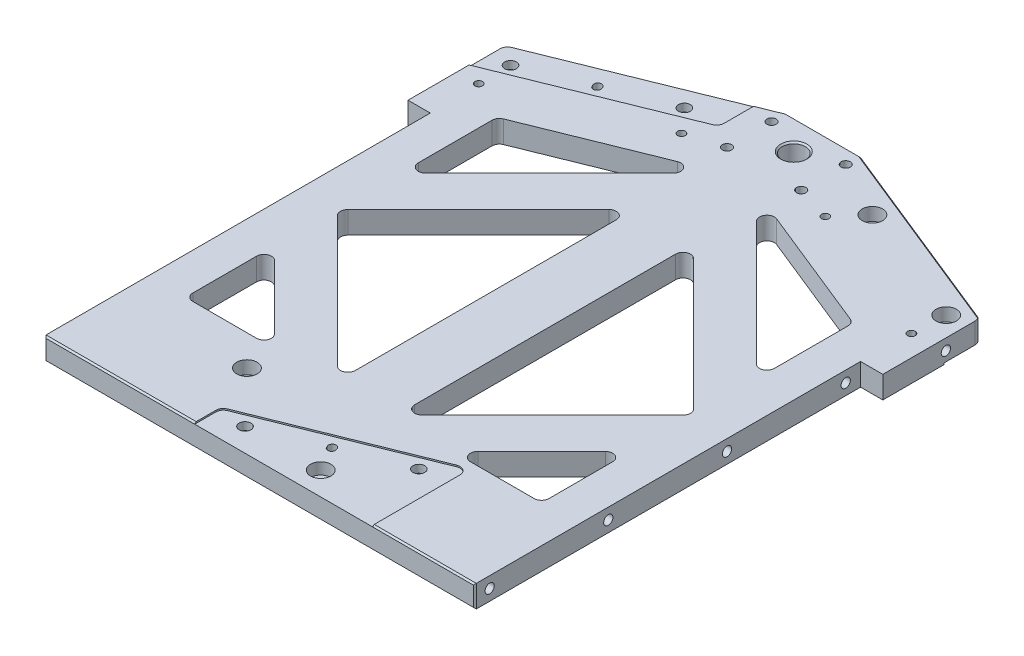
ISO-10303-21;
HEADER;
FILE_DESCRIPTION(('STEP AP214'),'2;1');
FILE_NAME('part.step','',(''),(''),'','','');
FILE_SCHEMA(('AUTOMOTIVE_DESIGN { 1 0 10303 214 1 1 1 1 }'));
ENDSEC;
DATA;
#1=APPLICATION_CONTEXT('core data for automotive mechanical design processes');
#2=APPLICATION_PROTOCOL_DEFINITION('international standard','automotive_design',2000,#1);
#3=PRODUCT_CONTEXT('',#1,'mechanical');
#4=PRODUCT('Part','Part','',(#3));
#5=PRODUCT_RELATED_PRODUCT_CATEGORY('part','',(#4));
#6=PRODUCT_DEFINITION_FORMATION('','',#4);
#7=PRODUCT_DEFINITION_CONTEXT('part definition',#1,'design');
#8=PRODUCT_DEFINITION('design','',#6,#7);
#9=PRODUCT_DEFINITION_SHAPE('','',#8);
#10=(LENGTH_UNIT() NAMED_UNIT(*) SI_UNIT(.MILLI.,.METRE.));
#11=(NAMED_UNIT(*) PLANE_ANGLE_UNIT() SI_UNIT($,.RADIAN.));
#12=(NAMED_UNIT(*) SI_UNIT($,.STERADIAN.) SOLID_ANGLE_UNIT());
#13=UNCERTAINTY_MEASURE_WITH_UNIT(LENGTH_MEASURE(1.E-05),#10,'distance_accuracy_value','');
#14=(GEOMETRIC_REPRESENTATION_CONTEXT(3) GLOBAL_UNCERTAINTY_ASSIGNED_CONTEXT((#13)) GLOBAL_UNIT_ASSIGNED_CONTEXT((#10,
#11,#12)) REPRESENTATION_CONTEXT('',''));
#15=CARTESIAN_POINT('',(0.,0.,0.));
#16=DIRECTION('',(0.,0.,1.));
#17=DIRECTION('',(1.,0.,0.));
#18=AXIS2_PLACEMENT_3D('',#15,#16,#17);
#19=CARTESIAN_POINT('',(17.3706151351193,-8.39993612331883,200.644644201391));
#20=DIRECTION('',(-0.92718385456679,0.,0.374606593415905));
#21=DIRECTION('',(0.374606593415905,0.,0.92718385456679));
#22=AXIS2_PLACEMENT_3D('',#19,#20,#21);
#23=PLANE('',#22);
#24=DIRECTION('',(0.,1.,0.));
#25=VECTOR('',#24,1.);
#26=CARTESIAN_POINT('',(17.8463655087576,-8.39993612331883,201.822167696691));
#27=LINE('',#26,#25);
#28=CARTESIAN_POINT('',(17.8463655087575,8.255,201.822167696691));
#29=VERTEX_POINT('',#28);
#30=CARTESIAN_POINT('',(17.8463655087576,1.905,201.822167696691));
#31=VERTEX_POINT('',#30);
#32=EDGE_CURVE('E494',#29,#31,#27,.F.);
#33=ORIENTED_EDGE('',*,*,#32,.T.);
#34=DIRECTION('',(0.374606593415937,0.,0.927183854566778));
#35=VECTOR('',#34,1.);
#36=CARTESIAN_POINT('',(17.3706151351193,1.905,200.644644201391));
#37=LINE('',#36,#35);
#38=CARTESIAN_POINT('',(17.3706151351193,1.905,200.644644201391));
#39=VERTEX_POINT('',#38);
#40=EDGE_CURVE('E500',#39,#31,#37,.T.);
#41=ORIENTED_EDGE('',*,*,#40,.F.);
#42=DIRECTION('',(0.,1.,0.));
#43=VECTOR('',#42,1.);
#44=CARTESIAN_POINT('',(17.3706151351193,-8.39993612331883,200.644644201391));
#45=LINE('',#44,#43);
#46=CARTESIAN_POINT('',(17.3706151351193,8.255,200.644644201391));
#47=VERTEX_POINT('',#46);
#48=EDGE_CURVE('E496',#39,#47,#45,.T.);
#49=ORIENTED_EDGE('',*,*,#48,.T.);
#50=DIRECTION('',(0.374606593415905,0.,0.92718385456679));
#51=VECTOR('',#50,1.);
#52=CARTESIAN_POINT('',(17.3706151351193,8.255,200.644644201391));
#53=LINE('',#52,#51);
#54=EDGE_CURVE('E510',#29,#47,#53,.F.);
#55=ORIENTED_EDGE('',*,*,#54,.F.);
#56=EDGE_LOOP('',(#33,#41,#49,#55));
#57=FACE_BOUND('',#56,.T.);
#58=ADVANCED_FACE('F24',(#57),#23,.F.);
#59=CARTESIAN_POINT('',(23.3524344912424,-8.39993612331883,198.227832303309));
#60=DIRECTION('',(0.92718385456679,0.,-0.374606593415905));
#61=DIRECTION('',(-0.374606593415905,0.,-0.92718385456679));
#62=AXIS2_PLACEMENT_3D('',#59,#60,#61);
#63=PLANE('',#62);
#64=DIRECTION('',(0.,1.,0.));
#65=VECTOR('',#64,1.);
#66=CARTESIAN_POINT('',(23.3524344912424,-8.39993612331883,198.227832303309));
#67=LINE('',#66,#65);
#68=CARTESIAN_POINT('',(23.3524344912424,8.255,198.227832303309));
#69=VERTEX_POINT('',#68);
#70=CARTESIAN_POINT('',(23.3524344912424,1.905,198.227832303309));
#71=VERTEX_POINT('',#70);
#72=EDGE_CURVE('E987',#69,#71,#67,.F.);
#73=ORIENTED_EDGE('',*,*,#72,.T.);
#74=DIRECTION('',(-0.374606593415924,0.,-0.927183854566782));
#75=VECTOR('',#74,1.);
#76=CARTESIAN_POINT('',(23.8281848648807,1.905,199.405355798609));
#77=LINE('',#76,#75);
#78=CARTESIAN_POINT('',(23.8281848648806,1.905,199.405355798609));
#79=VERTEX_POINT('',#78);
#80=EDGE_CURVE('E507',#79,#71,#77,.T.);
#81=ORIENTED_EDGE('',*,*,#80,.F.);
#82=DIRECTION('',(0.,1.,0.));
#83=VECTOR('',#82,1.);
#84=CARTESIAN_POINT('',(23.8281848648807,-8.39993612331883,199.405355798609));
#85=LINE('',#84,#83);
#86=CARTESIAN_POINT('',(23.8281848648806,8.255,199.405355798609));
#87=VERTEX_POINT('',#86);
#88=EDGE_CURVE('E486',#79,#87,#85,.T.);
#89=ORIENTED_EDGE('',*,*,#88,.T.);
#90=DIRECTION('',(-0.374606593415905,0.,-0.92718385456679));
#91=VECTOR('',#90,1.);
#92=CARTESIAN_POINT('',(23.3524344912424,8.255,198.227832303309));
#93=LINE('',#92,#91);
#94=EDGE_CURVE('E526',#69,#87,#93,.F.);
#95=ORIENTED_EDGE('',*,*,#94,.F.);
#96=EDGE_LOOP('',(#73,#81,#89,#95));
#97=FACE_BOUND('',#96,.T.);
#98=ADVANCED_FACE('F2281',(#97),#63,.F.);
#99=CARTESIAN_POINT('',(20.5994,1.905,200.025));
#100=DIRECTION('',(0.,1.,0.));
#101=DIRECTION('',(0.,0.,1.));
#102=AXIS2_PLACEMENT_3D('',#99,#100,#101);
#103=PLANE('',#102);
#104=ORIENTED_EDGE('',*,*,#40,.T.);
#105=CARTESIAN_POINT('',(20.8372751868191,1.905,200.61376174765));
#106=DIRECTION('',(0.,1.,0.));
#107=DIRECTION('',(0.,0.,1.));
#108=AXIS2_PLACEMENT_3D('',#105,#106,#107);
#109=CIRCLE('',#108,3.2258);
#110=EDGE_CURVE('E490',#31,#79,#109,.T.);
#111=ORIENTED_EDGE('',*,*,#110,.T.);
#112=ORIENTED_EDGE('',*,*,#80,.T.);
#113=CARTESIAN_POINT('',(20.3615248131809,1.905,199.43623825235));
#114=DIRECTION('',(0.,1.,0.));
#115=DIRECTION('',(0.,0.,1.));
#116=AXIS2_PLACEMENT_3D('',#113,#114,#115);
#117=CIRCLE('',#116,3.2258);
#118=EDGE_CURVE('E503',#71,#39,#117,.T.);
#119=ORIENTED_EDGE('',*,*,#118,.T.);
#120=EDGE_LOOP('',(#104,#111,#112,#119));
#121=FACE_BOUND('',#120,.T.);
#122=ADVANCED_FACE('F501',(#121),#103,.T.);
#123=CARTESIAN_POINT('',(-23.8281848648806,8.39993612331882,199.405355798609));
#124=DIRECTION('',(-0.92718385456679,0.,-0.374606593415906));
#125=DIRECTION('',(-0.374606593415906,0.,0.92718385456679));
#126=AXIS2_PLACEMENT_3D('',#123,#124,#125);
#127=PLANE('',#126);
#128=DIRECTION('',(0.,-1.,0.));
#129=VECTOR('',#128,1.);
#130=CARTESIAN_POINT('',(-23.3524344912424,8.39993612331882,198.227832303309));
#131=LINE('',#130,#129);
#132=CARTESIAN_POINT('',(-23.3524344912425,-8.255,198.227832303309));
#133=VERTEX_POINT('',#132);
#134=CARTESIAN_POINT('',(-23.3524344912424,-1.905,198.227832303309));
#135=VERTEX_POINT('',#134);
#136=EDGE_CURVE('E985',#133,#135,#131,.F.);
#137=ORIENTED_EDGE('',*,*,#136,.T.);
#138=DIRECTION('',(0.374606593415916,0.,-0.927183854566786));
#139=VECTOR('',#138,1.);
#140=CARTESIAN_POINT('',(-23.8281848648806,-1.905,199.405355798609));
#141=LINE('',#140,#139);
#142=CARTESIAN_POINT('',(-23.8281848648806,-1.905,199.405355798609));
#143=VERTEX_POINT('',#142);
#144=EDGE_CURVE('E517',#143,#135,#141,.T.);
#145=ORIENTED_EDGE('',*,*,#144,.F.);
#146=DIRECTION('',(0.,-1.,0.));
#147=VECTOR('',#146,1.);
#148=CARTESIAN_POINT('',(-23.8281848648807,8.39993612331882,199.405355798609));
#149=LINE('',#148,#147);
#150=CARTESIAN_POINT('',(-23.8281848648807,-8.255,199.405355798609));
#151=VERTEX_POINT('',#150);
#152=EDGE_CURVE('E984',#143,#151,#149,.T.);
#153=ORIENTED_EDGE('',*,*,#152,.T.);
#154=DIRECTION('',(-0.374606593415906,0.,0.92718385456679));
#155=VECTOR('',#154,1.);
#156=CARTESIAN_POINT('',(-23.8281848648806,-8.255,199.405355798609));
#157=LINE('',#156,#155);
#158=EDGE_CURVE('E506',#133,#151,#157,.T.);
#159=ORIENTED_EDGE('',*,*,#158,.F.);
#160=EDGE_LOOP('',(#137,#145,#153,#159));
#161=FACE_BOUND('',#160,.T.);
#162=ADVANCED_FACE('F2275',(#161),#127,.F.);
#163=CARTESIAN_POINT('',(-17.8463655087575,8.39993612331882,201.822167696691));
#164=DIRECTION('',(0.927183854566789,0.,0.374606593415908));
#165=DIRECTION('',(0.374606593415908,0.,-0.927183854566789));
#166=AXIS2_PLACEMENT_3D('',#163,#164,#165);
#167=PLANE('',#166);
#168=DIRECTION('',(0.,-1.,0.));
#169=VECTOR('',#168,1.);
#170=CARTESIAN_POINT('',(-17.8463655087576,8.39993612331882,201.822167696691));
#171=LINE('',#170,#169);
#172=CARTESIAN_POINT('',(-17.8463655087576,-8.255,201.822167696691));
#173=VERTEX_POINT('',#172);
#174=CARTESIAN_POINT('',(-17.8463655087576,-1.905,201.822167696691));
#175=VERTEX_POINT('',#174);
#176=EDGE_CURVE('E981',#173,#175,#171,.F.);
#177=ORIENTED_EDGE('',*,*,#176,.T.);
#178=DIRECTION('',(-0.374606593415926,0.,0.927183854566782));
#179=VECTOR('',#178,1.);
#180=CARTESIAN_POINT('',(-17.3706151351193,-1.905,200.644644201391));
#181=LINE('',#180,#179);
#182=CARTESIAN_POINT('',(-17.3706151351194,-1.905,200.644644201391));
#183=VERTEX_POINT('',#182);
#184=EDGE_CURVE('E519',#183,#175,#181,.T.);
#185=ORIENTED_EDGE('',*,*,#184,.F.);
#186=DIRECTION('',(0.,-1.,0.));
#187=VECTOR('',#186,1.);
#188=CARTESIAN_POINT('',(-17.3706151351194,8.39993612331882,200.644644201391));
#189=LINE('',#188,#187);
#190=CARTESIAN_POINT('',(-17.3706151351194,-8.255,200.644644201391));
#191=VERTEX_POINT('',#190);
#192=EDGE_CURVE('E1010',#183,#191,#189,.T.);
#193=ORIENTED_EDGE('',*,*,#192,.T.);
#194=DIRECTION('',(0.374606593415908,0.,-0.927183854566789));
#195=VECTOR('',#194,1.);
#196=CARTESIAN_POINT('',(-17.8463655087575,-8.25500000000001,201.822167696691));
#197=LINE('',#196,#195);
#198=EDGE_CURVE('E521',#173,#191,#197,.T.);
#199=ORIENTED_EDGE('',*,*,#198,.F.);
#200=EDGE_LOOP('',(#177,#185,#193,#199));
#201=FACE_BOUND('',#200,.T.);
#202=ADVANCED_FACE('F2271',(#201),#167,.F.);
#203=CARTESIAN_POINT('',(-20.5994,-1.905,200.025));
#204=DIRECTION('',(0.,-1.,0.));
#205=DIRECTION('',(0.,0.,-1.));
#206=AXIS2_PLACEMENT_3D('',#203,#204,#205);
#207=PLANE('',#206);
#208=ORIENTED_EDGE('',*,*,#144,.T.);
#209=CARTESIAN_POINT('',(-20.3615248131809,-1.905,199.43623825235));
#210=DIRECTION('',(0.,-1.,0.));
#211=DIRECTION('',(0.,0.,-1.));
#212=AXIS2_PLACEMENT_3D('',#209,#210,#211);
#213=CIRCLE('',#212,3.2258);
#214=EDGE_CURVE('E982',#135,#183,#213,.T.);
#215=ORIENTED_EDGE('',*,*,#214,.T.);
#216=ORIENTED_EDGE('',*,*,#184,.T.);
#217=CARTESIAN_POINT('',(-20.8372751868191,-1.905,200.61376174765));
#218=DIRECTION('',(0.,-1.,0.));
#219=DIRECTION('',(0.,0.,-1.));
#220=AXIS2_PLACEMENT_3D('',#217,#218,#219);
#221=CIRCLE('',#220,3.2258);
#222=EDGE_CURVE('E978',#175,#143,#221,.T.);
#223=ORIENTED_EDGE('',*,*,#222,.T.);
#224=EDGE_LOOP('',(#208,#215,#216,#223));
#225=FACE_BOUND('',#224,.T.);
#226=ADVANCED_FACE('F2267',(#225),#207,.T.);
#227=CARTESIAN_POINT('',(37.431057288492,-1.6002,221.433766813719));
#228=DIRECTION('',(0.,-1.,0.));
#229=DIRECTION('',(0.,0.,-1.));
#230=AXIS2_PLACEMENT_3D('',#227,#228,#229);
#231=PLANE('',#230);
#232=CARTESIAN_POINT('',(32.389157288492,-1.6002,221.433766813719));
#233=DIRECTION('',(0.,1.,0.));
#234=DIRECTION('',(0.,0.,1.));
#235=AXIS2_PLACEMENT_3D('',#232,#233,#234);
#236=CIRCLE('',#235,8.73759999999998);
#237=CARTESIAN_POINT('',(32.389157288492,-1.6002,230.171366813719));
#238=VERTEX_POINT('',#237);
#239=EDGE_CURVE('E27',#238,#238,#236,.T.);
#240=ORIENTED_EDGE('',*,*,#239,.T.);
#241=EDGE_LOOP('',(#240));
#242=FACE_BOUND('',#241,.T.);
#243=CARTESIAN_POINT('',(32.389157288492,-1.6002,221.433766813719));
#244=DIRECTION('',(0.,1.,0.));
#245=DIRECTION('',(0.,0.,1.));
#246=AXIS2_PLACEMENT_3D('',#243,#244,#245);
#247=CIRCLE('',#246,5.04189999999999);
#248=CARTESIAN_POINT('',(32.389157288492,-1.6002,226.475666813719));
#249=VERTEX_POINT('',#248);
#250=EDGE_CURVE('E975',#249,#249,#247,.F.);
#251=ORIENTED_EDGE('',*,*,#250,.T.);
#252=EDGE_LOOP('',(#251));
#253=FACE_BOUND('',#252,.T.);
#254=ADVANCED_FACE('F2263',(#242,#253),#231,.F.);
#255=CARTESIAN_POINT('',(-27.347257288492,1.6002,221.433766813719));
#256=DIRECTION('',(0.,1.,0.));
#257=DIRECTION('',(0.,0.,1.));
#258=AXIS2_PLACEMENT_3D('',#255,#256,#257);
#259=PLANE('',#258);
#260=CARTESIAN_POINT('',(-32.389157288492,1.6002,221.433766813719));
#261=DIRECTION('',(0.,-1.,0.));
#262=DIRECTION('',(0.,0.,-1.));
#263=AXIS2_PLACEMENT_3D('',#260,#261,#262);
#264=CIRCLE('',#263,8.73759999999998);
#265=CARTESIAN_POINT('',(-32.389157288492,1.6002,212.696166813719));
#266=VERTEX_POINT('',#265);
#267=EDGE_CURVE('E969',#266,#266,#264,.T.);
#268=ORIENTED_EDGE('',*,*,#267,.T.);
#269=EDGE_LOOP('',(#268));
#270=FACE_BOUND('',#269,.T.);
#271=CARTESIAN_POINT('',(-32.389157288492,1.6002,221.433766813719));
#272=DIRECTION('',(0.,-1.,0.));
#273=DIRECTION('',(0.,0.,-1.));
#274=AXIS2_PLACEMENT_3D('',#271,#272,#273);
#275=CIRCLE('',#274,5.04189999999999);
#276=CARTESIAN_POINT('',(-32.389157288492,1.6002,216.391866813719));
#277=VERTEX_POINT('',#276);
#278=EDGE_CURVE('E511',#277,#277,#275,.F.);
#279=ORIENTED_EDGE('',*,*,#278,.T.);
#280=EDGE_LOOP('',(#279));
#281=FACE_BOUND('',#280,.T.);
#282=ADVANCED_FACE('F2259',(#270,#281),#259,.F.);
#283=CARTESIAN_POINT('',(32.389157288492,9.525,221.433766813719));
#284=DIRECTION('',(0.,1.,0.));
#285=DIRECTION('',(0.,0.,1.));
#286=AXIS2_PLACEMENT_3D('',#283,#284,#285);
#287=CYLINDRICAL_SURFACE('',#286,8.73759999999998);
#288=CARTESIAN_POINT('',(32.389157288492,8.255,221.433766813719));
#289=DIRECTION('',(0.,1.,0.));
#290=DIRECTION('',(0.,0.,1.));
#291=AXIS2_PLACEMENT_3D('',#288,#289,#290);
#292=CIRCLE('',#291,8.73759999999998);
#293=CARTESIAN_POINT('',(32.389157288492,8.255,230.171366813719));
#294=VERTEX_POINT('',#293);
#295=EDGE_CURVE('E966',#294,#294,#292,.T.);
#296=ORIENTED_EDGE('',*,*,#295,.T.);
#297=EDGE_LOOP('',(#296));
#298=FACE_BOUND('',#297,.T.);
#299=ORIENTED_EDGE('',*,*,#239,.F.);
#300=EDGE_LOOP('',(#299));
#301=FACE_BOUND('',#300,.T.);
#302=ADVANCED_FACE('F2255',(#298,#301),#287,.F.);
#303=CARTESIAN_POINT('',(-32.389157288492,-9.525,221.433766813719));
#304=DIRECTION('',(0.,-1.,0.));
#305=DIRECTION('',(0.,0.,-1.));
#306=AXIS2_PLACEMENT_3D('',#303,#304,#305);
#307=CYLINDRICAL_SURFACE('',#306,5.04189999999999);
#308=CARTESIAN_POINT('',(-32.389157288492,8.255,221.433766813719));
#309=DIRECTION('',(0.,-1.,0.));
#310=DIRECTION('',(0.,0.,-1.));
#311=AXIS2_PLACEMENT_3D('',#308,#309,#310);
#312=CIRCLE('',#311,5.04189999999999);
#313=CARTESIAN_POINT('',(-32.389157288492,8.255,216.391866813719));
#314=VERTEX_POINT('',#313);
#315=EDGE_CURVE('E963',#314,#314,#312,.F.);
#316=ORIENTED_EDGE('',*,*,#315,.T.);
#317=EDGE_LOOP('',(#316));
#318=FACE_BOUND('',#317,.T.);
#319=ORIENTED_EDGE('',*,*,#278,.F.);
#320=EDGE_LOOP('',(#319));
#321=FACE_BOUND('',#320,.T.);
#322=ADVANCED_FACE('F2252',(#318,#321),#307,.F.);
#323=CARTESIAN_POINT('',(20.8372751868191,-8.39993612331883,200.61376174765));
#324=DIRECTION('',(0.,1.,0.));
#325=DIRECTION('',(0.,0.,1.));
#326=AXIS2_PLACEMENT_3D('',#323,#324,#325);
#327=CYLINDRICAL_SURFACE('',#326,3.2258);
#328=ORIENTED_EDGE('',*,*,#110,.F.);
#329=ORIENTED_EDGE('',*,*,#32,.F.);
#330=CARTESIAN_POINT('',(20.8372751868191,8.255,200.61376174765));
#331=DIRECTION('',(0.,1.,0.));
#332=DIRECTION('',(0.,0.,1.));
#333=AXIS2_PLACEMENT_3D('',#330,#331,#332);
#334=CIRCLE('',#333,3.2258);
#335=EDGE_CURVE('E961',#29,#87,#334,.T.);
#336=ORIENTED_EDGE('',*,*,#335,.T.);
#337=ORIENTED_EDGE('',*,*,#88,.F.);
#338=EDGE_LOOP('',(#328,#329,#336,#337));
#339=FACE_BOUND('',#338,.T.);
#340=ADVANCED_FACE('F492',(#339),#327,.F.);
#341=CARTESIAN_POINT('',(20.3615248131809,-8.39993612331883,199.43623825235));
#342=DIRECTION('',(0.,1.,0.));
#343=DIRECTION('',(0.,0.,1.));
#344=AXIS2_PLACEMENT_3D('',#341,#342,#343);
#345=CYLINDRICAL_SURFACE('',#344,3.2258);
#346=ORIENTED_EDGE('',*,*,#72,.F.);
#347=CARTESIAN_POINT('',(20.3615248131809,8.255,199.43623825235));
#348=DIRECTION('',(0.,1.,0.));
#349=DIRECTION('',(0.,0.,1.));
#350=AXIS2_PLACEMENT_3D('',#347,#348,#349);
#351=CIRCLE('',#350,3.2258);
#352=EDGE_CURVE('E957',#69,#47,#351,.T.);
#353=ORIENTED_EDGE('',*,*,#352,.T.);
#354=ORIENTED_EDGE('',*,*,#48,.F.);
#355=ORIENTED_EDGE('',*,*,#118,.F.);
#356=EDGE_LOOP('',(#346,#353,#354,#355));
#357=FACE_BOUND('',#356,.T.);
#358=ADVANCED_FACE('F2245',(#357),#345,.F.);
#359=CARTESIAN_POINT('',(130.238816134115,8.39993612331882,-181.923852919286));
#360=DIRECTION('',(-0.927183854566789,0.,-0.374606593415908));
#361=DIRECTION('',(-0.374606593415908,0.,0.927183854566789));
#362=AXIS2_PLACEMENT_3D('',#359,#360,#361);
#363=PLANE('',#362);
#364=DIRECTION('',(0.,-1.,0.));
#365=VECTOR('',#364,1.);
#366=CARTESIAN_POINT('',(130.714566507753,8.39993612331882,-183.101376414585));
#367=LINE('',#366,#365);
#368=CARTESIAN_POINT('',(130.714566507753,-8.255,-183.101376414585));
#369=VERTEX_POINT('',#368);
#370=CARTESIAN_POINT('',(130.714566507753,-1.905,-183.101376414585));
#371=VERTEX_POINT('',#370);
#372=EDGE_CURVE('E956',#369,#371,#367,.F.);
#373=ORIENTED_EDGE('',*,*,#372,.T.);
#374=DIRECTION('',(0.374606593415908,0.,-0.927183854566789));
#375=VECTOR('',#374,1.);
#376=CARTESIAN_POINT('',(130.238816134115,-1.905,-181.923852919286));
#377=LINE('',#376,#375);
#378=CARTESIAN_POINT('',(130.238816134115,-1.905,-181.923852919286));
#379=VERTEX_POINT('',#378);
#380=EDGE_CURVE('E999',#379,#371,#377,.T.);
#381=ORIENTED_EDGE('',*,*,#380,.F.);
#382=DIRECTION('',(0.,-1.,0.));
#383=VECTOR('',#382,1.);
#384=CARTESIAN_POINT('',(130.238816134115,8.39993612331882,-181.923852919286));
#385=LINE('',#384,#383);
#386=CARTESIAN_POINT('',(130.238816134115,-8.255,-181.923852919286));
#387=VERTEX_POINT('',#386);
#388=EDGE_CURVE('E955',#379,#387,#385,.T.);
#389=ORIENTED_EDGE('',*,*,#388,.T.);
#390=DIRECTION('',(-0.374606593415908,0.,0.927183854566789));
#391=VECTOR('',#390,1.);
#392=CARTESIAN_POINT('',(130.238816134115,-8.25500000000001,-181.923852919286));
#393=LINE('',#392,#391);
#394=EDGE_CURVE('E986',#369,#387,#393,.T.);
#395=ORIENTED_EDGE('',*,*,#394,.F.);
#396=EDGE_LOOP('',(#373,#381,#389,#395));
#397=FACE_BOUND('',#396,.T.);
#398=ADVANCED_FACE('F2241',(#397),#363,.F.);
#399=CARTESIAN_POINT('',(136.220635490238,8.39993612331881,-179.507041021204));
#400=DIRECTION('',(0.927183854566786,0.,0.374606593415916));
#401=DIRECTION('',(0.374606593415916,0.,-0.927183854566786));
#402=AXIS2_PLACEMENT_3D('',#399,#400,#401);
#403=PLANE('',#402);
#404=DIRECTION('',(0.,-1.,0.));
#405=VECTOR('',#404,1.);
#406=CARTESIAN_POINT('',(136.220635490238,8.39993612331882,-179.507041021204));
#407=LINE('',#406,#405);
#408=CARTESIAN_POINT('',(136.220635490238,-8.255,-179.507041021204));
#409=VERTEX_POINT('',#408);
#410=CARTESIAN_POINT('',(136.220635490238,-1.905,-179.507041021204));
#411=VERTEX_POINT('',#410);
#412=EDGE_CURVE('E952',#409,#411,#407,.F.);
#413=ORIENTED_EDGE('',*,*,#412,.T.);
#414=DIRECTION('',(-0.374606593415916,0.,0.927183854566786));
#415=VECTOR('',#414,1.);
#416=CARTESIAN_POINT('',(136.696385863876,-1.905,-180.684564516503));
#417=LINE('',#416,#415);
#418=CARTESIAN_POINT('',(136.696385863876,-1.905,-180.684564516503));
#419=VERTEX_POINT('',#418);
#420=EDGE_CURVE('E997',#419,#411,#417,.T.);
#421=ORIENTED_EDGE('',*,*,#420,.F.);
#422=DIRECTION('',(0.,-1.,0.));
#423=VECTOR('',#422,1.);
#424=CARTESIAN_POINT('',(136.696385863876,8.39993612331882,-180.684564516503));
#425=LINE('',#424,#423);
#426=CARTESIAN_POINT('',(136.696385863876,-8.255,-180.684564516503));
#427=VERTEX_POINT('',#426);
#428=EDGE_CURVE('E960',#419,#427,#425,.T.);
#429=ORIENTED_EDGE('',*,*,#428,.T.);
#430=DIRECTION('',(0.374606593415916,0.,-0.927183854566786));
#431=VECTOR('',#430,1.);
#432=CARTESIAN_POINT('',(136.220635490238,-8.255,-179.507041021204));
#433=LINE('',#432,#431);
#434=EDGE_CURVE('E988',#409,#427,#433,.T.);
#435=ORIENTED_EDGE('',*,*,#434,.F.);
#436=EDGE_LOOP('',(#413,#421,#429,#435));
#437=FACE_BOUND('',#436,.T.);
#438=ADVANCED_FACE('F2237',(#437),#403,.F.);
#439=CARTESIAN_POINT('',(133.467600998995,-1.905,-181.304208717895));
#440=DIRECTION('',(0.,-1.,0.));
#441=DIRECTION('',(0.,0.,-1.));
#442=AXIS2_PLACEMENT_3D('',#439,#440,#441);
#443=PLANE('',#442);
#444=ORIENTED_EDGE('',*,*,#380,.T.);
#445=CARTESIAN_POINT('',(133.705476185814,-1.905,-181.892970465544));
#446=DIRECTION('',(0.,-1.,0.));
#447=DIRECTION('',(0.,0.,-1.));
#448=AXIS2_PLACEMENT_3D('',#445,#446,#447);
#449=CIRCLE('',#448,3.2258);
#450=EDGE_CURVE('E953',#371,#419,#449,.T.);
#451=ORIENTED_EDGE('',*,*,#450,.T.);
#452=ORIENTED_EDGE('',*,*,#420,.T.);
#453=CARTESIAN_POINT('',(133.229725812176,-1.905,-180.715446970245));
#454=DIRECTION('',(0.,-1.,0.));
#455=DIRECTION('',(0.,0.,-1.));
#456=AXIS2_PLACEMENT_3D('',#453,#454,#455);
#457=CIRCLE('',#456,3.22579999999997);
#458=EDGE_CURVE('E949',#411,#379,#457,.T.);
#459=ORIENTED_EDGE('',*,*,#458,.T.);
#460=EDGE_LOOP('',(#444,#451,#452,#459));
#461=FACE_BOUND('',#460,.T.);
#462=ADVANCED_FACE('F2233',(#461),#443,.T.);
#463=CARTESIAN_POINT('',(-136.696385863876,-8.39993612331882,-180.684564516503));
#464=DIRECTION('',(-0.927183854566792,0.,0.374606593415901));
#465=DIRECTION('',(0.374606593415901,0.,0.927183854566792));
#466=AXIS2_PLACEMENT_3D('',#463,#464,#465);
#467=PLANE('',#466);
#468=DIRECTION('',(0.,1.,0.));
#469=VECTOR('',#468,1.);
#470=CARTESIAN_POINT('',(-136.220635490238,-8.39993612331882,-179.507041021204));
#471=LINE('',#470,#469);
#472=CARTESIAN_POINT('',(-136.220635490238,8.25500000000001,-179.507041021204));
#473=VERTEX_POINT('',#472);
#474=CARTESIAN_POINT('',(-136.220635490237,1.905,-179.507041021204));
#475=VERTEX_POINT('',#474);
#476=EDGE_CURVE('E941',#473,#475,#471,.F.);
#477=ORIENTED_EDGE('',*,*,#476,.T.);
#478=DIRECTION('',(0.37460659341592,0.,0.927183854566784));
#479=VECTOR('',#478,1.);
#480=CARTESIAN_POINT('',(-136.696385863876,1.905,-180.684564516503));
#481=LINE('',#480,#479);
#482=CARTESIAN_POINT('',(-136.696385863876,1.905,-180.684564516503));
#483=VERTEX_POINT('',#482);
#484=EDGE_CURVE('E1008',#483,#475,#481,.T.);
#485=ORIENTED_EDGE('',*,*,#484,.F.);
#486=DIRECTION('',(0.,1.,0.));
#487=VECTOR('',#486,1.);
#488=CARTESIAN_POINT('',(-136.696385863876,-8.39993612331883,-180.684564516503));
#489=LINE('',#488,#487);
#490=CARTESIAN_POINT('',(-136.696385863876,8.25500000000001,-180.684564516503));
#491=VERTEX_POINT('',#490);
#492=EDGE_CURVE('E940',#483,#491,#489,.T.);
#493=ORIENTED_EDGE('',*,*,#492,.T.);
#494=DIRECTION('',(0.374606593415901,0.,0.927183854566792));
#495=VECTOR('',#494,1.);
#496=CARTESIAN_POINT('',(-136.696385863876,8.25500000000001,-180.684564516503));
#497=LINE('',#496,#495);
#498=EDGE_CURVE('E1001',#473,#491,#497,.F.);
#499=ORIENTED_EDGE('',*,*,#498,.F.);
#500=EDGE_LOOP('',(#477,#485,#493,#499));
#501=FACE_BOUND('',#500,.T.);
#502=ADVANCED_FACE('F2229',(#501),#467,.F.);
#503=CARTESIAN_POINT('',(-130.714566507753,-8.39993612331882,-183.101376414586));
#504=DIRECTION('',(0.927183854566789,0.,-0.374606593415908));
#505=DIRECTION('',(-0.374606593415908,0.,-0.927183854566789));
#506=AXIS2_PLACEMENT_3D('',#503,#504,#505);
#507=PLANE('',#506);
#508=DIRECTION('',(0.,1.,0.));
#509=VECTOR('',#508,1.);
#510=CARTESIAN_POINT('',(-130.714566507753,-8.39993612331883,-183.101376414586));
#511=LINE('',#510,#509);
#512=CARTESIAN_POINT('',(-130.714566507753,8.255,-183.101376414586));
#513=VERTEX_POINT('',#512);
#514=CARTESIAN_POINT('',(-130.714566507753,1.905,-183.101376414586));
#515=VERTEX_POINT('',#514);
#516=EDGE_CURVE('E937',#513,#515,#511,.F.);
#517=ORIENTED_EDGE('',*,*,#516,.T.);
#518=DIRECTION('',(-0.374606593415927,0.,-0.927183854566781));
#519=VECTOR('',#518,1.);
#520=CARTESIAN_POINT('',(-130.238816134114,1.905,-181.923852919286));
#521=LINE('',#520,#519);
#522=CARTESIAN_POINT('',(-130.238816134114,1.905,-181.923852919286));
#523=VERTEX_POINT('',#522);
#524=EDGE_CURVE('E1006',#523,#515,#521,.T.);
#525=ORIENTED_EDGE('',*,*,#524,.F.);
#526=DIRECTION('',(0.,1.,0.));
#527=VECTOR('',#526,1.);
#528=CARTESIAN_POINT('',(-130.238816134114,-8.39993612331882,-181.923852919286));
#529=LINE('',#528,#527);
#530=CARTESIAN_POINT('',(-130.238816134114,8.255,-181.923852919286));
#531=VERTEX_POINT('',#530);
#532=EDGE_CURVE('E945',#523,#531,#529,.T.);
#533=ORIENTED_EDGE('',*,*,#532,.T.);
#534=DIRECTION('',(-0.374606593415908,0.,-0.927183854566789));
#535=VECTOR('',#534,1.);
#536=CARTESIAN_POINT('',(-130.714566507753,8.255,-183.101376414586));
#537=LINE('',#536,#535);
#538=EDGE_CURVE('E1003',#513,#531,#537,.F.);
#539=ORIENTED_EDGE('',*,*,#538,.F.);
#540=EDGE_LOOP('',(#517,#525,#533,#539));
#541=FACE_BOUND('',#540,.T.);
#542=ADVANCED_FACE('F2225',(#541),#507,.F.);
#543=CARTESIAN_POINT('',(-133.467600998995,1.905,-181.304208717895));
#544=DIRECTION('',(0.,1.,0.));
#545=DIRECTION('',(0.,0.,1.));
#546=AXIS2_PLACEMENT_3D('',#543,#544,#545);
#547=PLANE('',#546);
#548=ORIENTED_EDGE('',*,*,#484,.T.);
#549=CARTESIAN_POINT('',(-133.229725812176,1.905,-180.715446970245));
#550=DIRECTION('',(0.,1.,0.));
#551=DIRECTION('',(0.,0.,1.));
#552=AXIS2_PLACEMENT_3D('',#549,#550,#551);
#553=CIRCLE('',#552,3.2258);
#554=EDGE_CURVE('E938',#475,#523,#553,.T.);
#555=ORIENTED_EDGE('',*,*,#554,.T.);
#556=ORIENTED_EDGE('',*,*,#524,.T.);
#557=CARTESIAN_POINT('',(-133.705476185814,1.905,-181.892970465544));
#558=DIRECTION('',(0.,1.,0.));
#559=DIRECTION('',(0.,0.,1.));
#560=AXIS2_PLACEMENT_3D('',#557,#558,#559);
#561=CIRCLE('',#560,3.22579999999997);
#562=EDGE_CURVE('E934',#515,#483,#561,.T.);
#563=ORIENTED_EDGE('',*,*,#562,.T.);
#564=EDGE_LOOP('',(#548,#555,#556,#563));
#565=FACE_BOUND('',#564,.T.);
#566=ADVANCED_FACE('F2221',(#565),#547,.T.);
#567=CARTESIAN_POINT('',(-68.546057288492,-1.6002,178.616233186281));
#568=DIRECTION('',(0.,-1.,0.));
#569=DIRECTION('',(0.,0.,-1.));
#570=AXIS2_PLACEMENT_3D('',#567,#568,#569);
#571=PLANE('',#570);
#572=CARTESIAN_POINT('',(-73.587957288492,-1.6002,178.616233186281));
#573=DIRECTION('',(0.,1.,0.));
#574=DIRECTION('',(0.,0.,1.));
#575=AXIS2_PLACEMENT_3D('',#572,#573,#574);
#576=CIRCLE('',#575,8.73759999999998);
#577=CARTESIAN_POINT('',(-73.587957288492,-1.6002,187.353833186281));
#578=VERTEX_POINT('',#577);
#579=EDGE_CURVE('E928',#578,#578,#576,.T.);
#580=ORIENTED_EDGE('',*,*,#579,.T.);
#581=EDGE_LOOP('',(#580));
#582=FACE_BOUND('',#581,.T.);
#583=CARTESIAN_POINT('',(-73.587957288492,-1.6002,178.616233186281));
#584=DIRECTION('',(0.,1.,0.));
#585=DIRECTION('',(0.,0.,1.));
#586=AXIS2_PLACEMENT_3D('',#583,#584,#585);
#587=CIRCLE('',#586,5.04190000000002);
#588=CARTESIAN_POINT('',(-73.587957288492,-1.6002,183.658133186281));
#589=VERTEX_POINT('',#588);
#590=EDGE_CURVE('E972',#589,#589,#587,.F.);
#591=ORIENTED_EDGE('',*,*,#590,.T.);
#592=EDGE_LOOP('',(#591));
#593=FACE_BOUND('',#592,.T.);
#594=ADVANCED_FACE('F2130',(#582,#593),#571,.F.);
#595=CARTESIAN_POINT('',(85.5210782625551,-1.6002,-202.713308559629));
#596=DIRECTION('',(0.,-1.,0.));
#597=DIRECTION('',(0.,0.,-1.));
#598=AXIS2_PLACEMENT_3D('',#595,#596,#597);
#599=PLANE('',#598);
#600=CARTESIAN_POINT('',(80.4791782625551,-1.6002,-202.713308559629));
#601=DIRECTION('',(0.,1.,0.));
#602=DIRECTION('',(0.,0.,1.));
#603=AXIS2_PLACEMENT_3D('',#600,#601,#602);
#604=CIRCLE('',#603,8.73759999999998);
#605=CARTESIAN_POINT('',(80.4791782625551,-1.6002,-193.975708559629));
#606=VERTEX_POINT('',#605);
#607=EDGE_CURVE('E925',#606,#606,#604,.T.);
#608=ORIENTED_EDGE('',*,*,#607,.T.);
#609=EDGE_LOOP('',(#608));
#610=FACE_BOUND('',#609,.T.);
#611=CARTESIAN_POINT('',(80.4791782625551,-1.6002,-202.713308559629));
#612=DIRECTION('',(0.,1.,0.));
#613=DIRECTION('',(0.,0.,1.));
#614=AXIS2_PLACEMENT_3D('',#611,#612,#613);
#615=CIRCLE('',#614,5.04190000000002);
#616=CARTESIAN_POINT('',(80.4791782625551,-1.6002,-197.671408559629));
#617=VERTEX_POINT('',#616);
#618=EDGE_CURVE('E946',#617,#617,#615,.F.);
#619=ORIENTED_EDGE('',*,*,#618,.T.);
#620=EDGE_LOOP('',(#619));
#621=FACE_BOUND('',#620,.T.);
#622=ADVANCED_FACE('F2126',(#610,#621),#599,.F.);
#623=CARTESIAN_POINT('',(191.498192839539,-1.6002,-159.895774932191));
#624=DIRECTION('',(0.,-1.,0.));
#625=DIRECTION('',(0.,0.,-1.));
#626=AXIS2_PLACEMENT_3D('',#623,#624,#625);
#627=PLANE('',#626);
#628=CARTESIAN_POINT('',(186.456292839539,-1.6002,-159.895774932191));
#629=DIRECTION('',(0.,1.,0.));
#630=DIRECTION('',(0.,0.,1.));
#631=AXIS2_PLACEMENT_3D('',#628,#629,#630);
#632=CIRCLE('',#631,8.73759999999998);
#633=CARTESIAN_POINT('',(186.456292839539,-1.6002,-151.158174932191));
#634=VERTEX_POINT('',#633);
#635=EDGE_CURVE('E921',#634,#634,#632,.T.);
#636=ORIENTED_EDGE('',*,*,#635,.T.);
#637=EDGE_LOOP('',(#636));
#638=FACE_BOUND('',#637,.T.);
#639=CARTESIAN_POINT('',(186.456292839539,-1.6002,-159.895774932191));
#640=DIRECTION('',(0.,1.,0.));
#641=DIRECTION('',(0.,0.,1.));
#642=AXIS2_PLACEMENT_3D('',#639,#640,#641);
#643=CIRCLE('',#642,5.04189999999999);
#644=CARTESIAN_POINT('',(186.456292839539,-1.6002,-154.853874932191));
#645=VERTEX_POINT('',#644);
#646=EDGE_CURVE('E942',#645,#645,#643,.F.);
#647=ORIENTED_EDGE('',*,*,#646,.T.);
#648=EDGE_LOOP('',(#647));
#649=FACE_BOUND('',#648,.T.);
#650=ADVANCED_FACE('F2129',(#638,#649),#627,.F.);
#651=CARTESIAN_POINT('',(-158.749999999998,0.,-76.2000000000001));
#652=DIRECTION('',(-1.,0.,0.));
#653=DIRECTION('',(0.,0.,1.));
#654=AXIS2_PLACEMENT_3D('',#651,#652,#653);
#655=CONICAL_SURFACE('',#654,3.96875000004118,1.02974425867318);
#656=CARTESIAN_POINT('',(-156.36533441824,0.,-76.2000000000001));
#657=VERTEX_POINT('',#656);
#658=VERTEX_LOOP('',#657);
#659=FACE_BOUND('',#658,.T.);
#660=CARTESIAN_POINT('',(-158.75,0.,-76.2000000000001));
#661=DIRECTION('',(-1.,0.,0.));
#662=DIRECTION('',(0.,0.,1.));
#663=AXIS2_PLACEMENT_3D('',#660,#661,#662);
#664=CIRCLE('',#663,3.96874999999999);
#665=CARTESIAN_POINT('',(-158.75,0.,-72.2312500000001));
#666=VERTEX_POINT('',#665);
#667=EDGE_CURVE('E1027',#666,#666,#664,.T.);
#668=ORIENTED_EDGE('',*,*,#667,.T.);
#669=EDGE_LOOP('',(#668));
#670=FACE_BOUND('',#669,.T.);
#671=ADVANCED_FACE('F2211',(#659,#670),#655,.F.);
#672=CARTESIAN_POINT('',(-158.749999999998,0.,25.3999999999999));
#673=DIRECTION('',(-1.,0.,0.));
#674=DIRECTION('',(0.,0.,1.));
#675=AXIS2_PLACEMENT_3D('',#672,#673,#674);
#676=CONICAL_SURFACE('',#675,3.96875000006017,1.02974425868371);
#677=CARTESIAN_POINT('',(-156.365334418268,0.,25.4000000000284));
#678=VERTEX_POINT('',#677);
#679=VERTEX_LOOP('',#678);
#680=FACE_BOUND('',#679,.T.);
#681=CARTESIAN_POINT('',(-158.75,0.,25.4));
#682=DIRECTION('',(-1.,0.,0.));
#683=DIRECTION('',(0.,0.,1.));
#684=AXIS2_PLACEMENT_3D('',#681,#682,#683);
#685=CIRCLE('',#684,3.96875);
#686=CARTESIAN_POINT('',(-158.75,0.,29.3687499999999));
#687=VERTEX_POINT('',#686);
#688=EDGE_CURVE('E1031',#687,#687,#685,.T.);
#689=ORIENTED_EDGE('',*,*,#688,.T.);
#690=EDGE_LOOP('',(#689));
#691=FACE_BOUND('',#690,.T.);
#692=ADVANCED_FACE('F2207',(#680,#691),#676,.F.);
#693=CARTESIAN_POINT('',(-158.749999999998,0.,127.));
#694=DIRECTION('',(-1.,0.,0.));
#695=DIRECTION('',(0.,0.,1.));
#696=AXIS2_PLACEMENT_3D('',#693,#694,#695);
#697=CONICAL_SURFACE('',#696,3.96875000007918,1.0297442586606);
#698=CARTESIAN_POINT('',(-156.365334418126,0.,127.));
#699=VERTEX_POINT('',#698);
#700=VERTEX_LOOP('',#699);
#701=FACE_BOUND('',#700,.T.);
#702=CARTESIAN_POINT('',(-158.75,0.,127.));
#703=DIRECTION('',(-1.,0.,0.));
#704=DIRECTION('',(0.,0.,1.));
#705=AXIS2_PLACEMENT_3D('',#702,#703,#704);
#706=CIRCLE('',#705,3.96874999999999);
#707=CARTESIAN_POINT('',(-158.75,0.,130.96875));
#708=VERTEX_POINT('',#707);
#709=EDGE_CURVE('E1034',#708,#708,#706,.T.);
#710=ORIENTED_EDGE('',*,*,#709,.T.);
#711=EDGE_LOOP('',(#710));
#712=FACE_BOUND('',#711,.T.);
#713=ADVANCED_FACE('F2203',(#701,#712),#697,.F.);
#714=CARTESIAN_POINT('',(-158.749999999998,0.,228.6));
#715=DIRECTION('',(-1.,0.,0.));
#716=DIRECTION('',(0.,0.,1.));
#717=AXIS2_PLACEMENT_3D('',#714,#715,#716);
#718=CONICAL_SURFACE('',#717,3.96875000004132,1.02974425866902);
#719=CARTESIAN_POINT('',(-156.365334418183,0.,228.6));
#720=VERTEX_POINT('',#719);
#721=VERTEX_LOOP('',#720);
#722=FACE_BOUND('',#721,.T.);
#723=CARTESIAN_POINT('',(-158.75,0.,228.6));
#724=DIRECTION('',(-1.,0.,0.));
#725=DIRECTION('',(0.,0.,1.));
#726=AXIS2_PLACEMENT_3D('',#723,#724,#725);
#727=CIRCLE('',#726,3.96874999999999);
#728=CARTESIAN_POINT('',(-158.75,0.,232.56875));
#729=VERTEX_POINT('',#728);
#730=EDGE_CURVE('E1037',#729,#729,#727,.T.);
#731=ORIENTED_EDGE('',*,*,#730,.T.);
#732=EDGE_LOOP('',(#731));
#733=FACE_BOUND('',#732,.T.);
#734=ADVANCED_FACE('F2199',(#722,#733),#718,.F.);
#735=CARTESIAN_POINT('',(-20.3615248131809,8.39993612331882,199.43623825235));
#736=DIRECTION('',(0.,-1.,0.));
#737=DIRECTION('',(0.,0.,-1.));
#738=AXIS2_PLACEMENT_3D('',#735,#736,#737);
#739=CYLINDRICAL_SURFACE('',#738,3.2258);
#740=ORIENTED_EDGE('',*,*,#214,.F.);
#741=ORIENTED_EDGE('',*,*,#136,.F.);
#742=CARTESIAN_POINT('',(-20.3615248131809,-8.255,199.43623825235));
#743=DIRECTION('',(0.,-1.,0.));
#744=DIRECTION('',(0.,0.,-1.));
#745=AXIS2_PLACEMENT_3D('',#742,#743,#744);
#746=CIRCLE('',#745,3.2258);
#747=EDGE_CURVE('E908',#191,#133,#746,.F.);
#748=ORIENTED_EDGE('',*,*,#747,.F.);
#749=ORIENTED_EDGE('',*,*,#192,.F.);
#750=EDGE_LOOP('',(#740,#741,#748,#749));
#751=FACE_BOUND('',#750,.T.);
#752=ADVANCED_FACE('F2195',(#751),#739,.F.);
#753=CARTESIAN_POINT('',(-20.8372751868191,8.39993612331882,200.61376174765));
#754=DIRECTION('',(0.,-1.,0.));
#755=DIRECTION('',(0.,0.,-1.));
#756=AXIS2_PLACEMENT_3D('',#753,#754,#755);
#757=CYLINDRICAL_SURFACE('',#756,3.2258);
#758=ORIENTED_EDGE('',*,*,#176,.F.);
#759=CARTESIAN_POINT('',(-20.8372751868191,-8.255,200.61376174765));
#760=DIRECTION('',(0.,-1.,0.));
#761=DIRECTION('',(0.,0.,-1.));
#762=AXIS2_PLACEMENT_3D('',#759,#760,#761);
#763=CIRCLE('',#762,3.2258);
#764=EDGE_CURVE('E905',#151,#173,#763,.F.);
#765=ORIENTED_EDGE('',*,*,#764,.F.);
#766=ORIENTED_EDGE('',*,*,#152,.F.);
#767=ORIENTED_EDGE('',*,*,#222,.F.);
#768=EDGE_LOOP('',(#758,#765,#766,#767));
#769=FACE_BOUND('',#768,.T.);
#770=ADVANCED_FACE('F2191',(#769),#757,.F.);
#771=CARTESIAN_POINT('',(32.389157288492,9.525,221.433766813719));
#772=DIRECTION('',(0.,1.,0.));
#773=DIRECTION('',(0.,0.,1.));
#774=AXIS2_PLACEMENT_3D('',#771,#772,#773);
#775=CYLINDRICAL_SURFACE('',#774,5.04189999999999);
#776=CARTESIAN_POINT('',(32.389157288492,-8.255,221.433766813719));
#777=DIRECTION('',(0.,1.,0.));
#778=DIRECTION('',(0.,0.,1.));
#779=AXIS2_PLACEMENT_3D('',#776,#777,#778);
#780=CIRCLE('',#779,5.04189999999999);
#781=CARTESIAN_POINT('',(32.389157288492,-8.255,226.475666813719));
#782=VERTEX_POINT('',#781);
#783=EDGE_CURVE('E902',#782,#782,#780,.T.);
#784=ORIENTED_EDGE('',*,*,#783,.F.);
#785=EDGE_LOOP('',(#784));
#786=FACE_BOUND('',#785,.T.);
#787=ORIENTED_EDGE('',*,*,#250,.F.);
#788=EDGE_LOOP('',(#787));
#789=FACE_BOUND('',#788,.T.);
#790=ADVANCED_FACE('F2187',(#786,#789),#775,.F.);
#791=CARTESIAN_POINT('',(-73.587957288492,9.525,178.616233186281));
#792=DIRECTION('',(0.,1.,0.));
#793=DIRECTION('',(0.,0.,1.));
#794=AXIS2_PLACEMENT_3D('',#791,#792,#793);
#795=CYLINDRICAL_SURFACE('',#794,5.04190000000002);
#796=CARTESIAN_POINT('',(-73.587957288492,-8.255,178.616233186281));
#797=DIRECTION('',(0.,1.,0.));
#798=DIRECTION('',(0.,0.,1.));
#799=AXIS2_PLACEMENT_3D('',#796,#797,#798);
#800=CIRCLE('',#799,5.04190000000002);
#801=CARTESIAN_POINT('',(-73.587957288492,-8.255,183.658133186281));
#802=VERTEX_POINT('',#801);
#803=EDGE_CURVE('E899',#802,#802,#800,.T.);
#804=ORIENTED_EDGE('',*,*,#803,.F.);
#805=EDGE_LOOP('',(#804));
#806=FACE_BOUND('',#805,.T.);
#807=ORIENTED_EDGE('',*,*,#590,.F.);
#808=EDGE_LOOP('',(#807));
#809=FACE_BOUND('',#808,.T.);
#810=ADVANCED_FACE('F2183',(#806,#809),#795,.F.);
#811=CARTESIAN_POINT('',(-32.389157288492,-9.525,221.433766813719));
#812=DIRECTION('',(0.,-1.,0.));
#813=DIRECTION('',(0.,0.,-1.));
#814=AXIS2_PLACEMENT_3D('',#811,#812,#813);
#815=CYLINDRICAL_SURFACE('',#814,8.73759999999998);
#816=CARTESIAN_POINT('',(-32.389157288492,-8.255,221.433766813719));
#817=DIRECTION('',(0.,-1.,0.));
#818=DIRECTION('',(0.,0.,-1.));
#819=AXIS2_PLACEMENT_3D('',#816,#817,#818);
#820=CIRCLE('',#819,8.73759999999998);
#821=CARTESIAN_POINT('',(-32.389157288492,-8.255,212.696166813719));
#822=VERTEX_POINT('',#821);
#823=EDGE_CURVE('E895',#822,#822,#820,.F.);
#824=ORIENTED_EDGE('',*,*,#823,.F.);
#825=EDGE_LOOP('',(#824));
#826=FACE_BOUND('',#825,.T.);
#827=ORIENTED_EDGE('',*,*,#267,.F.);
#828=EDGE_LOOP('',(#827));
#829=FACE_BOUND('',#828,.T.);
#830=ADVANCED_FACE('F2179',(#826,#829),#815,.F.);
#831=CARTESIAN_POINT('',(0.,8.255,0.));
#832=DIRECTION('',(0.,-1.,0.));
#833=DIRECTION('',(0.,0.,-1.));
#834=AXIS2_PLACEMENT_3D('',#831,#832,#833);
#835=PLANE('',#834);
#836=ORIENTED_EDGE('',*,*,#352,.F.);
#837=ORIENTED_EDGE('',*,*,#94,.T.);
#838=ORIENTED_EDGE('',*,*,#335,.F.);
#839=ORIENTED_EDGE('',*,*,#54,.T.);
#840=EDGE_LOOP('',(#836,#837,#838,#839));
#841=FACE_BOUND('',#840,.T.);
#842=CARTESIAN_POINT('',(90.4494,8.255,166.667246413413));
#843=DIRECTION('',(0.,-1.,0.));
#844=DIRECTION('',(0.,0.,-1.));
#845=AXIS2_PLACEMENT_3D('',#842,#843,#844);
#846=CIRCLE('',#845,6.34999999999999);
#847=CARTESIAN_POINT('',(96.7994,8.255,166.667246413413));
#848=VERTEX_POINT('',#847);
#849=CARTESIAN_POINT('',(88.070648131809,8.255,160.779628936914));
#850=VERTEX_POINT('',#849);
#851=EDGE_CURVE('E912',#848,#850,#846,.F.);
#852=ORIENTED_EDGE('',*,*,#851,.T.);
#853=DIRECTION('',(-0.92718385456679,0.,0.374606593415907));
#854=VECTOR('',#853,1.);
#855=CARTESIAN_POINT('',(96.7994,8.255,157.252984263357));
#856=LINE('',#855,#854);
#857=CARTESIAN_POINT('',(-51.629351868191,8.255,217.222092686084));
#858=VERTEX_POINT('',#857);
#859=EDGE_CURVE('E1016',#850,#858,#856,.T.);
#860=ORIENTED_EDGE('',*,*,#859,.T.);
#861=CARTESIAN_POINT('',(-49.2506,8.255,223.109710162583));
#862=DIRECTION('',(0.,-1.,0.));
#863=DIRECTION('',(0.,0.,-1.));
#864=AXIS2_PLACEMENT_3D('',#861,#862,#863);
#865=CIRCLE('',#864,6.34999999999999);
#866=CARTESIAN_POINT('',(-55.6006,8.255,223.109710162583));
#867=VERTEX_POINT('',#866);
#868=EDGE_CURVE('E916',#858,#867,#865,.F.);
#869=ORIENTED_EDGE('',*,*,#868,.T.);
#870=DIRECTION('',(0.,0.,1.));
#871=VECTOR('',#870,1.);
#872=CARTESIAN_POINT('',(-55.6006,8.255,218.826581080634));
#873=LINE('',#872,#871);
#874=CARTESIAN_POINT('',(-55.6006000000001,8.255,241.3));
#875=VERTEX_POINT('',#874);
#876=EDGE_CURVE('E1013',#867,#875,#873,.T.);
#877=ORIENTED_EDGE('',*,*,#876,.T.);
#878=DIRECTION('',(-1.,0.,0.));
#879=VECTOR('',#878,1.);
#880=CARTESIAN_POINT('',(-203.2,8.255,241.3));
#881=LINE('',#880,#879);
#882=CARTESIAN_POINT('',(96.7994,8.25499999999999,241.3));
#883=VERTEX_POINT('',#882);
#884=EDGE_CURVE('E898',#875,#883,#881,.F.);
#885=ORIENTED_EDGE('',*,*,#884,.T.);
#886=DIRECTION('',(0.,0.,-1.));
#887=VECTOR('',#886,1.);
#888=CARTESIAN_POINT('',(96.7994,8.255,241.3));
#889=LINE('',#888,#887);
#890=EDGE_CURVE('E914',#883,#848,#889,.T.);
#891=ORIENTED_EDGE('',*,*,#890,.T.);
#892=EDGE_LOOP('',(#852,#860,#869,#877,#885,#891));
#893=FACE_BOUND('',#892,.T.);
#894=CARTESIAN_POINT('',(73.587957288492,8.255,178.616233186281));
#895=DIRECTION('',(0.,-1.,0.));
#896=DIRECTION('',(0.,0.,-1.));
#897=AXIS2_PLACEMENT_3D('',#894,#895,#896);
#898=CIRCLE('',#897,5.04189999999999);
#899=CARTESIAN_POINT('',(73.587957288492,8.255,173.574333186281));
#900=VERTEX_POINT('',#899);
#901=EDGE_CURVE('E931',#900,#900,#898,.T.);
#902=ORIENTED_EDGE('',*,*,#901,.T.);
#903=EDGE_LOOP('',(#902));
#904=FACE_BOUND('',#903,.T.);
#905=ORIENTED_EDGE('',*,*,#315,.F.);
#906=EDGE_LOOP('',(#905));
#907=FACE_BOUND('',#906,.T.);
#908=ORIENTED_EDGE('',*,*,#295,.F.);
#909=EDGE_LOOP('',(#908));
#910=FACE_BOUND('',#909,.T.);
#911=ADVANCED_FACE('F2175',(#841,#893,#904,#907,#910),#835,.F.);
#912=CARTESIAN_POINT('',(158.749999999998,0.,-76.2000000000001));
#913=DIRECTION('',(1.,0.,0.));
#914=DIRECTION('',(0.,0.,-1.));
#915=AXIS2_PLACEMENT_3D('',#912,#913,#914);
#916=CONICAL_SURFACE('',#915,3.96874999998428,1.02974425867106);
#917=CARTESIAN_POINT('',(156.365334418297,0.,-76.2000000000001));
#918=VERTEX_POINT('',#917);
#919=VERTEX_LOOP('',#918);
#920=FACE_BOUND('',#919,.T.);
#921=CARTESIAN_POINT('',(158.75,0.,-76.2000000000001));
#922=DIRECTION('',(1.,0.,0.));
#923=DIRECTION('',(0.,0.,-1.));
#924=AXIS2_PLACEMENT_3D('',#921,#922,#923);
#925=CIRCLE('',#924,3.96874999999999);
#926=CARTESIAN_POINT('',(158.75,0.,-80.1687500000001));
#927=VERTEX_POINT('',#926);
#928=EDGE_CURVE('E1058',#927,#927,#925,.T.);
#929=ORIENTED_EDGE('',*,*,#928,.T.);
#930=EDGE_LOOP('',(#929));
#931=FACE_BOUND('',#930,.T.);
#932=ADVANCED_FACE('F2171',(#920,#931),#916,.F.);
#933=CARTESIAN_POINT('',(158.749999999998,0.,25.3999999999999));
#934=DIRECTION('',(1.,0.,0.));
#935=DIRECTION('',(0.,0.,-1.));
#936=AXIS2_PLACEMENT_3D('',#933,#934,#935);
#937=CONICAL_SURFACE('',#936,3.96875000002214,1.02974425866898);
#938=CARTESIAN_POINT('',(156.365334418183,0.,25.3999999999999));
#939=VERTEX_POINT('',#938);
#940=VERTEX_LOOP('',#939);
#941=FACE_BOUND('',#940,.T.);
#942=CARTESIAN_POINT('',(158.75,0.,25.4));
#943=DIRECTION('',(1.,0.,0.));
#944=DIRECTION('',(0.,0.,-1.));
#945=AXIS2_PLACEMENT_3D('',#942,#943,#944);
#946=CIRCLE('',#945,3.96875);
#947=CARTESIAN_POINT('',(158.75,0.,21.43125));
#948=VERTEX_POINT('',#947);
#949=EDGE_CURVE('E1062',#948,#948,#946,.T.);
#950=ORIENTED_EDGE('',*,*,#949,.T.);
#951=EDGE_LOOP('',(#950));
#952=FACE_BOUND('',#951,.T.);
#953=ADVANCED_FACE('F2167',(#941,#952),#937,.F.);
#954=CARTESIAN_POINT('',(158.749999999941,0.,127.));
#955=DIRECTION('',(1.,0.,0.));
#956=DIRECTION('',(0.,0.,-1.));
#957=AXIS2_PLACEMENT_3D('',#954,#955,#956);
#958=CONICAL_SURFACE('',#957,3.96875000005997,1.02974425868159);
#959=CARTESIAN_POINT('',(156.365334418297,0.,127.));
#960=VERTEX_POINT('',#959);
#961=VERTEX_LOOP('',#960);
#962=FACE_BOUND('',#961,.T.);
#963=CARTESIAN_POINT('',(158.75,0.,127.));
#964=DIRECTION('',(1.,0.,0.));
#965=DIRECTION('',(0.,0.,-1.));
#966=AXIS2_PLACEMENT_3D('',#963,#964,#965);
#967=CIRCLE('',#966,3.96874999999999);
#968=CARTESIAN_POINT('',(158.75,0.,123.03125));
#969=VERTEX_POINT('',#968);
#970=EDGE_CURVE('E1065',#969,#969,#967,.T.);
#971=ORIENTED_EDGE('',*,*,#970,.T.);
#972=EDGE_LOOP('',(#971));
#973=FACE_BOUND('',#972,.T.);
#974=ADVANCED_FACE('F2163',(#962,#973),#958,.F.);
#975=CARTESIAN_POINT('',(158.750000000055,0.,228.6));
#976=DIRECTION('',(1.,0.,0.));
#977=DIRECTION('',(0.,0.,-1.));
#978=AXIS2_PLACEMENT_3D('',#975,#976,#977);
#979=CONICAL_SURFACE('',#978,3.96875000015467,1.02974425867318);
#980=CARTESIAN_POINT('',(156.365334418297,0.,228.6));
#981=VERTEX_POINT('',#980);
#982=VERTEX_LOOP('',#981);
#983=FACE_BOUND('',#982,.T.);
#984=CARTESIAN_POINT('',(158.75,0.,228.6));
#985=DIRECTION('',(1.,0.,0.));
#986=DIRECTION('',(0.,0.,-1.));
#987=AXIS2_PLACEMENT_3D('',#984,#985,#986);
#988=CIRCLE('',#987,3.96874999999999);
#989=CARTESIAN_POINT('',(158.75,0.,224.63125));
#990=VERTEX_POINT('',#989);
#991=EDGE_CURVE('E1068',#990,#990,#988,.T.);
#992=ORIENTED_EDGE('',*,*,#991,.T.);
#993=EDGE_LOOP('',(#992));
#994=FACE_BOUND('',#993,.T.);
#995=ADVANCED_FACE('F2159',(#983,#994),#979,.F.);
#996=CARTESIAN_POINT('',(177.800000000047,0.,-142.875));
#997=DIRECTION('',(1.,0.,0.));
#998=DIRECTION('',(0.,0.,-1.));
#999=AXIS2_PLACEMENT_3D('',#996,#997,#998);
#1000=CONICAL_SURFACE('',#999,3.96875000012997,1.02974425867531);
#1001=CARTESIAN_POINT('',(175.415334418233,0.,-142.875));
#1002=VERTEX_POINT('',#1001);
#1003=VERTEX_LOOP('',#1002);
#1004=FACE_BOUND('',#1003,.T.);
#1005=CARTESIAN_POINT('',(177.8,0.,-142.875));
#1006=DIRECTION('',(1.,0.,0.));
#1007=DIRECTION('',(0.,0.,-1.));
#1008=AXIS2_PLACEMENT_3D('',#1005,#1006,#1007);
#1009=CIRCLE('',#1008,3.96874999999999);
#1010=CARTESIAN_POINT('',(177.8,0.,-146.84375));
#1011=VERTEX_POINT('',#1010);
#1012=EDGE_CURVE('E894',#1011,#1011,#1009,.T.);
#1013=ORIENTED_EDGE('',*,*,#1012,.T.);
#1014=EDGE_LOOP('',(#1013));
#1015=FACE_BOUND('',#1014,.T.);
#1016=ADVANCED_FACE('F2155',(#1004,#1015),#1000,.F.);
#1017=CARTESIAN_POINT('',(133.705476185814,8.39993612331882,-181.892970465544));
#1018=DIRECTION('',(0.,-1.,0.));
#1019=DIRECTION('',(0.,0.,-1.));
#1020=AXIS2_PLACEMENT_3D('',#1017,#1018,#1019);
#1021=CYLINDRICAL_SURFACE('',#1020,3.2258);
#1022=ORIENTED_EDGE('',*,*,#450,.F.);
#1023=ORIENTED_EDGE('',*,*,#372,.F.);
#1024=CARTESIAN_POINT('',(133.705476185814,-8.255,-181.892970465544));
#1025=DIRECTION('',(0.,-1.,0.));
#1026=DIRECTION('',(0.,0.,-1.));
#1027=AXIS2_PLACEMENT_3D('',#1024,#1025,#1026);
#1028=CIRCLE('',#1027,3.2258);
#1029=EDGE_CURVE('E889',#427,#369,#1028,.F.);
#1030=ORIENTED_EDGE('',*,*,#1029,.F.);
#1031=ORIENTED_EDGE('',*,*,#428,.F.);
#1032=EDGE_LOOP('',(#1022,#1023,#1030,#1031));
#1033=FACE_BOUND('',#1032,.T.);
#1034=ADVANCED_FACE('F2147',(#1033),#1021,.F.);
#1035=CARTESIAN_POINT('',(133.229725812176,8.39993612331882,-180.715446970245));
#1036=DIRECTION('',(0.,-1.,0.));
#1037=DIRECTION('',(0.,0.,-1.));
#1038=AXIS2_PLACEMENT_3D('',#1035,#1036,#1037);
#1039=CYLINDRICAL_SURFACE('',#1038,3.22579999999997);
#1040=ORIENTED_EDGE('',*,*,#412,.F.);
#1041=CARTESIAN_POINT('',(133.229725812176,-8.255,-180.715446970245));
#1042=DIRECTION('',(0.,-1.,0.));
#1043=DIRECTION('',(0.,0.,-1.));
#1044=AXIS2_PLACEMENT_3D('',#1041,#1042,#1043);
#1045=CIRCLE('',#1044,3.22579999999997);
#1046=EDGE_CURVE('E886',#387,#409,#1045,.F.);
#1047=ORIENTED_EDGE('',*,*,#1046,.F.);
#1048=ORIENTED_EDGE('',*,*,#388,.F.);
#1049=ORIENTED_EDGE('',*,*,#458,.F.);
#1050=EDGE_LOOP('',(#1040,#1047,#1048,#1049));
#1051=FACE_BOUND('',#1050,.T.);
#1052=ADVANCED_FACE('F2137',(#1051),#1039,.F.);
#1053=CARTESIAN_POINT('',(80.4791782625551,9.525,-202.713308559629));
#1054=DIRECTION('',(0.,1.,0.));
#1055=DIRECTION('',(0.,0.,1.));
#1056=AXIS2_PLACEMENT_3D('',#1053,#1054,#1055);
#1057=CYLINDRICAL_SURFACE('',#1056,5.04190000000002);
#1058=CARTESIAN_POINT('',(80.4791782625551,-8.255,-202.713308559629));
#1059=DIRECTION('',(0.,1.,0.));
#1060=DIRECTION('',(0.,0.,1.));
#1061=AXIS2_PLACEMENT_3D('',#1058,#1059,#1060);
#1062=CIRCLE('',#1061,5.04190000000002);
#1063=CARTESIAN_POINT('',(80.4791782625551,-8.255,-197.671408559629));
#1064=VERTEX_POINT('',#1063);
#1065=EDGE_CURVE('E883',#1064,#1064,#1062,.T.);
#1066=ORIENTED_EDGE('',*,*,#1065,.F.);
#1067=EDGE_LOOP('',(#1066));
#1068=FACE_BOUND('',#1067,.T.);
#1069=ORIENTED_EDGE('',*,*,#618,.F.);
#1070=EDGE_LOOP('',(#1069));
#1071=FACE_BOUND('',#1070,.T.);
#1072=ADVANCED_FACE('F2134',(#1068,#1071),#1057,.F.);
#1073=CARTESIAN_POINT('',(186.456292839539,9.525,-159.895774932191));
#1074=DIRECTION('',(0.,1.,0.));
#1075=DIRECTION('',(0.,0.,1.));
#1076=AXIS2_PLACEMENT_3D('',#1073,#1074,#1075);
#1077=CYLINDRICAL_SURFACE('',#1076,5.04189999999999);
#1078=CARTESIAN_POINT('',(186.456292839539,-8.255,-159.895774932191));
#1079=DIRECTION('',(0.,1.,0.));
#1080=DIRECTION('',(0.,0.,1.));
#1081=AXIS2_PLACEMENT_3D('',#1078,#1079,#1080);
#1082=CIRCLE('',#1081,5.04189999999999);
#1083=CARTESIAN_POINT('',(186.456292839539,-8.255,-154.853874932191));
#1084=VERTEX_POINT('',#1083);
#1085=EDGE_CURVE('E880',#1084,#1084,#1082,.T.);
#1086=ORIENTED_EDGE('',*,*,#1085,.F.);
#1087=EDGE_LOOP('',(#1086));
#1088=FACE_BOUND('',#1087,.T.);
#1089=ORIENTED_EDGE('',*,*,#646,.F.);
#1090=EDGE_LOOP('',(#1089));
#1091=FACE_BOUND('',#1090,.T.);
#1092=ADVANCED_FACE('F2136',(#1088,#1091),#1077,.F.);
#1093=CARTESIAN_POINT('',(-177.799999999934,0.,-142.875));
#1094=DIRECTION('',(-1.,0.,0.));
#1095=DIRECTION('',(0.,0.,1.));
#1096=AXIS2_PLACEMENT_3D('',#1093,#1094,#1095);
#1097=CONICAL_SURFACE('',#1096,3.96875000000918,1.02974425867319);
#1098=CARTESIAN_POINT('',(-175.415334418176,0.,-142.875));
#1099=VERTEX_POINT('',#1098);
#1100=VERTEX_LOOP('',#1099);
#1101=FACE_BOUND('',#1100,.T.);
#1102=CARTESIAN_POINT('',(-177.8,0.,-142.875));
#1103=DIRECTION('',(-1.,0.,0.));
#1104=DIRECTION('',(0.,0.,1.));
#1105=AXIS2_PLACEMENT_3D('',#1102,#1103,#1104);
#1106=CIRCLE('',#1105,3.96874999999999);
#1107=CARTESIAN_POINT('',(-177.8,0.,-138.90625));
#1108=VERTEX_POINT('',#1107);
#1109=EDGE_CURVE('E876',#1108,#1108,#1106,.T.);
#1110=ORIENTED_EDGE('',*,*,#1109,.T.);
#1111=EDGE_LOOP('',(#1110));
#1112=FACE_BOUND('',#1111,.T.);
#1113=ADVANCED_FACE('F2144',(#1101,#1112),#1097,.F.);
#1114=CARTESIAN_POINT('',(-133.229725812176,-8.39993612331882,-180.715446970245));
#1115=DIRECTION('',(0.,1.,0.));
#1116=DIRECTION('',(0.,0.,1.));
#1117=AXIS2_PLACEMENT_3D('',#1114,#1115,#1116);
#1118=CYLINDRICAL_SURFACE('',#1117,3.2258);
#1119=ORIENTED_EDGE('',*,*,#554,.F.);
#1120=ORIENTED_EDGE('',*,*,#476,.F.);
#1121=CARTESIAN_POINT('',(-133.229725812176,8.255,-180.715446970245));
#1122=DIRECTION('',(0.,1.,0.));
#1123=DIRECTION('',(0.,0.,1.));
#1124=AXIS2_PLACEMENT_3D('',#1121,#1122,#1123);
#1125=CIRCLE('',#1124,3.2258);
#1126=EDGE_CURVE('E873',#531,#473,#1125,.F.);
#1127=ORIENTED_EDGE('',*,*,#1126,.F.);
#1128=ORIENTED_EDGE('',*,*,#532,.F.);
#1129=EDGE_LOOP('',(#1119,#1120,#1127,#1128));
#1130=FACE_BOUND('',#1129,.T.);
#1131=ADVANCED_FACE('F2537',(#1130),#1118,.F.);
#1132=CARTESIAN_POINT('',(-133.705476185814,-8.39993612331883,-181.892970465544));
#1133=DIRECTION('',(0.,1.,0.));
#1134=DIRECTION('',(0.,0.,1.));
#1135=AXIS2_PLACEMENT_3D('',#1132,#1133,#1134);
#1136=CYLINDRICAL_SURFACE('',#1135,3.22579999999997);
#1137=ORIENTED_EDGE('',*,*,#516,.F.);
#1138=CARTESIAN_POINT('',(-133.705476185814,8.255,-181.892970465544));
#1139=DIRECTION('',(0.,1.,0.));
#1140=DIRECTION('',(0.,0.,1.));
#1141=AXIS2_PLACEMENT_3D('',#1138,#1139,#1140);
#1142=CIRCLE('',#1141,3.22579999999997);
#1143=EDGE_CURVE('E870',#491,#513,#1142,.F.);
#1144=ORIENTED_EDGE('',*,*,#1143,.F.);
#1145=ORIENTED_EDGE('',*,*,#492,.F.);
#1146=ORIENTED_EDGE('',*,*,#562,.F.);
#1147=EDGE_LOOP('',(#1137,#1144,#1145,#1146));
#1148=FACE_BOUND('',#1147,.T.);
#1149=ADVANCED_FACE('F2546',(#1148),#1136,.F.);
#1150=CARTESIAN_POINT('',(-80.4791782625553,-9.525,-202.713308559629));
#1151=DIRECTION('',(0.,-1.,0.));
#1152=DIRECTION('',(0.,0.,-1.));
#1153=AXIS2_PLACEMENT_3D('',#1150,#1151,#1152);
#1154=CYLINDRICAL_SURFACE('',#1153,5.04189999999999);
#1155=CARTESIAN_POINT('',(-80.4791782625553,8.255,-202.713308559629));
#1156=DIRECTION('',(0.,-1.,0.));
#1157=DIRECTION('',(0.,0.,-1.));
#1158=AXIS2_PLACEMENT_3D('',#1155,#1156,#1157);
#1159=CIRCLE('',#1158,5.04189999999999);
#1160=CARTESIAN_POINT('',(-80.4791782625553,8.255,-207.755208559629));
#1161=VERTEX_POINT('',#1160);
#1162=EDGE_CURVE('E864',#1161,#1161,#1159,.T.);
#1163=ORIENTED_EDGE('',*,*,#1162,.F.);
#1164=EDGE_LOOP('',(#1163));
#1165=FACE_BOUND('',#1164,.T.);
#1166=CARTESIAN_POINT('',(-80.4791782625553,1.6002,-202.713308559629));
#1167=DIRECTION('',(0.,-1.,0.));
#1168=DIRECTION('',(0.,0.,-1.));
#1169=AXIS2_PLACEMENT_3D('',#1166,#1167,#1168);
#1170=CIRCLE('',#1169,5.04189999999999);
#1171=CARTESIAN_POINT('',(-80.4791782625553,1.6002,-207.755208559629));
#1172=VERTEX_POINT('',#1171);
#1173=EDGE_CURVE('E855',#1172,#1172,#1170,.T.);
#1174=ORIENTED_EDGE('',*,*,#1173,.T.);
#1175=EDGE_LOOP('',(#1174));
#1176=FACE_BOUND('',#1175,.T.);
#1177=ADVANCED_FACE('F2556',(#1165,#1176),#1154,.F.);
#1178=CARTESIAN_POINT('',(-186.456292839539,-9.525,-159.895774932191));
#1179=DIRECTION('',(0.,-1.,0.));
#1180=DIRECTION('',(0.,0.,-1.));
#1181=AXIS2_PLACEMENT_3D('',#1178,#1179,#1180);
#1182=CYLINDRICAL_SURFACE('',#1181,5.04189999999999);
#1183=CARTESIAN_POINT('',(-186.456292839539,8.255,-159.895774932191));
#1184=DIRECTION('',(0.,-1.,0.));
#1185=DIRECTION('',(0.,0.,-1.));
#1186=AXIS2_PLACEMENT_3D('',#1183,#1184,#1185);
#1187=CIRCLE('',#1186,5.04189999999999);
#1188=CARTESIAN_POINT('',(-186.456292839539,8.255,-164.937674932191));
#1189=VERTEX_POINT('',#1188);
#1190=EDGE_CURVE('E867',#1189,#1189,#1187,.T.);
#1191=ORIENTED_EDGE('',*,*,#1190,.F.);
#1192=EDGE_LOOP('',(#1191));
#1193=FACE_BOUND('',#1192,.T.);
#1194=CARTESIAN_POINT('',(-186.456292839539,1.6002,-159.895774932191));
#1195=DIRECTION('',(0.,-1.,0.));
#1196=DIRECTION('',(0.,0.,-1.));
#1197=AXIS2_PLACEMENT_3D('',#1194,#1195,#1196);
#1198=CIRCLE('',#1197,5.04189999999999);
#1199=CARTESIAN_POINT('',(-186.456292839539,1.6002,-164.937674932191));
#1200=VERTEX_POINT('',#1199);
#1201=EDGE_CURVE('E852',#1200,#1200,#1198,.T.);
#1202=ORIENTED_EDGE('',*,*,#1201,.T.);
#1203=EDGE_LOOP('',(#1202));
#1204=FACE_BOUND('',#1203,.T.);
#1205=ADVANCED_FACE('F1701',(#1193,#1204),#1182,.F.);
#1206=CARTESIAN_POINT('',(73.587957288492,-9.525,178.616233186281));
#1207=DIRECTION('',(0.,-1.,0.));
#1208=DIRECTION('',(0.,0.,-1.));
#1209=AXIS2_PLACEMENT_3D('',#1206,#1207,#1208);
#1210=CYLINDRICAL_SURFACE('',#1209,5.04189999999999);
#1211=ORIENTED_EDGE('',*,*,#901,.F.);
#1212=EDGE_LOOP('',(#1211));
#1213=FACE_BOUND('',#1212,.T.);
#1214=CARTESIAN_POINT('',(73.587957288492,1.6002,178.616233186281));
#1215=DIRECTION('',(0.,-1.,0.));
#1216=DIRECTION('',(0.,0.,-1.));
#1217=AXIS2_PLACEMENT_3D('',#1214,#1215,#1216);
#1218=CIRCLE('',#1217,5.04189999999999);
#1219=CARTESIAN_POINT('',(73.587957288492,1.6002,173.574333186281));
#1220=VERTEX_POINT('',#1219);
#1221=EDGE_CURVE('E849',#1220,#1220,#1218,.T.);
#1222=ORIENTED_EDGE('',*,*,#1221,.T.);
#1223=EDGE_LOOP('',(#1222));
#1224=FACE_BOUND('',#1223,.T.);
#1225=ADVANCED_FACE('F1690',(#1213,#1224),#1210,.F.);
#1226=CARTESIAN_POINT('',(0.,9.52499999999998,-215.9));
#1227=DIRECTION('',(0.,1.,0.));
#1228=DIRECTION('',(0.,0.,1.));
#1229=AXIS2_PLACEMENT_3D('',#1226,#1227,#1228);
#1230=CONICAL_SURFACE('',#1229,11.1887000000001,0.78539816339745);
#1231=CARTESIAN_POINT('',(0.,8.25499999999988,-215.9));
#1232=DIRECTION('',(0.,1.,0.));
#1233=DIRECTION('',(0.,0.,1.));
#1234=AXIS2_PLACEMENT_3D('',#1231,#1232,#1233);
#1235=CIRCLE('',#1234,9.91870000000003);
#1236=CARTESIAN_POINT('',(0.,8.25499999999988,-205.9813));
#1237=VERTEX_POINT('',#1236);
#1238=EDGE_CURVE('E1024',#1237,#1237,#1235,.F.);
#1239=ORIENTED_EDGE('',*,*,#1238,.T.);
#1240=EDGE_LOOP('',(#1239));
#1241=FACE_BOUND('',#1240,.T.);
#1242=CARTESIAN_POINT('',(0.,9.52499999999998,-215.9));
#1243=DIRECTION('',(0.,1.,0.));
#1244=DIRECTION('',(0.,0.,1.));
#1245=AXIS2_PLACEMENT_3D('',#1242,#1243,#1244);
#1246=CIRCLE('',#1245,11.1887000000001);
#1247=CARTESIAN_POINT('',(0.,9.52499999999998,-204.7113));
#1248=VERTEX_POINT('',#1247);
#1249=EDGE_CURVE('E846',#1248,#1248,#1246,.F.);
#1250=ORIENTED_EDGE('',*,*,#1249,.F.);
#1251=EDGE_LOOP('',(#1250));
#1252=FACE_BOUND('',#1251,.T.);
#1253=ADVANCED_FACE('F1687',(#1241,#1252),#1230,.F.);
#1254=CARTESIAN_POINT('',(-73.587957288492,9.525,178.616233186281));
#1255=DIRECTION('',(0.,1.,0.));
#1256=DIRECTION('',(0.,0.,1.));
#1257=AXIS2_PLACEMENT_3D('',#1254,#1255,#1256);
#1258=CYLINDRICAL_SURFACE('',#1257,8.73759999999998);
#1259=CARTESIAN_POINT('',(-73.587957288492,9.525,178.616233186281));
#1260=DIRECTION('',(0.,1.,0.));
#1261=DIRECTION('',(0.,0.,1.));
#1262=AXIS2_PLACEMENT_3D('',#1259,#1260,#1261);
#1263=CIRCLE('',#1262,8.73759999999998);
#1264=CARTESIAN_POINT('',(-73.587957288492,9.525,187.353833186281));
#1265=VERTEX_POINT('',#1264);
#1266=EDGE_CURVE('E843',#1265,#1265,#1263,.F.);
#1267=ORIENTED_EDGE('',*,*,#1266,.F.);
#1268=EDGE_LOOP('',(#1267));
#1269=FACE_BOUND('',#1268,.T.);
#1270=ORIENTED_EDGE('',*,*,#579,.F.);
#1271=EDGE_LOOP('',(#1270));
#1272=FACE_BOUND('',#1271,.T.);
#1273=ADVANCED_FACE('F1689',(#1269,#1272),#1258,.F.);
#1274=CARTESIAN_POINT('',(80.4791782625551,9.525,-202.713308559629));
#1275=DIRECTION('',(0.,1.,0.));
#1276=DIRECTION('',(0.,0.,1.));
#1277=AXIS2_PLACEMENT_3D('',#1274,#1275,#1276);
#1278=CYLINDRICAL_SURFACE('',#1277,8.73759999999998);
#1279=CARTESIAN_POINT('',(80.4791782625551,9.525,-202.713308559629));
#1280=DIRECTION('',(0.,1.,0.));
#1281=DIRECTION('',(0.,0.,1.));
#1282=AXIS2_PLACEMENT_3D('',#1279,#1280,#1281);
#1283=CIRCLE('',#1282,8.73759999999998);
#1284=CARTESIAN_POINT('',(80.4791782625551,9.525,-193.975708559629));
#1285=VERTEX_POINT('',#1284);
#1286=EDGE_CURVE('E840',#1285,#1285,#1283,.F.);
#1287=ORIENTED_EDGE('',*,*,#1286,.F.);
#1288=EDGE_LOOP('',(#1287));
#1289=FACE_BOUND('',#1288,.T.);
#1290=ORIENTED_EDGE('',*,*,#607,.F.);
#1291=EDGE_LOOP('',(#1290));
#1292=FACE_BOUND('',#1291,.T.);
#1293=ADVANCED_FACE('F1698',(#1289,#1292),#1278,.F.);
#1294=CARTESIAN_POINT('',(186.456292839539,9.525,-159.895774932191));
#1295=DIRECTION('',(0.,1.,0.));
#1296=DIRECTION('',(0.,0.,1.));
#1297=AXIS2_PLACEMENT_3D('',#1294,#1295,#1296);
#1298=CYLINDRICAL_SURFACE('',#1297,8.73759999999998);
#1299=CARTESIAN_POINT('',(186.456292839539,9.525,-159.895774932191));
#1300=DIRECTION('',(0.,1.,0.));
#1301=DIRECTION('',(0.,0.,1.));
#1302=AXIS2_PLACEMENT_3D('',#1299,#1300,#1301);
#1303=CIRCLE('',#1302,8.73759999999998);
#1304=CARTESIAN_POINT('',(186.456292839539,9.525,-151.158174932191));
#1305=VERTEX_POINT('',#1304);
#1306=EDGE_CURVE('E836',#1305,#1305,#1303,.F.);
#1307=ORIENTED_EDGE('',*,*,#1306,.F.);
#1308=EDGE_LOOP('',(#1307));
#1309=FACE_BOUND('',#1308,.T.);
#1310=ORIENTED_EDGE('',*,*,#635,.F.);
#1311=EDGE_LOOP('',(#1310));
#1312=FACE_BOUND('',#1311,.T.);
#1313=ADVANCED_FACE('F2114',(#1309,#1312),#1298,.F.);
#1314=CARTESIAN_POINT('',(0.,9.525,240.03));
#1315=DIRECTION('',(0.,0.707106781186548,0.707106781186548));
#1316=DIRECTION('',(0.,-0.707106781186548,0.707106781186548));
#1317=AXIS2_PLACEMENT_3D('',#1314,#1315,#1316);
#1318=PLANE('',#1317);
#1319=DIRECTION('',(-1.,0.,0.));
#1320=VECTOR('',#1319,1.);
#1321=CARTESIAN_POINT('',(-203.2,8.25500000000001,241.3));
#1322=LINE('',#1321,#1320);
#1323=CARTESIAN_POINT('',(-182.88,8.25500000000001,241.3));
#1324=VERTEX_POINT('',#1323);
#1325=EDGE_CURVE('E1055',#1324,#875,#1322,.F.);
#1326=ORIENTED_EDGE('',*,*,#1325,.T.);
#1327=DIRECTION('',(0.,0.707106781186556,-0.707106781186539));
#1328=VECTOR('',#1327,1.);
#1329=CARTESIAN_POINT('',(-55.6006000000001,8.255,241.3));
#1330=LINE('',#1329,#1328);
#1331=CARTESIAN_POINT('',(-55.6006000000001,9.525,240.03));
#1332=VERTEX_POINT('',#1331);
#1333=EDGE_CURVE('E924',#875,#1332,#1330,.T.);
#1334=ORIENTED_EDGE('',*,*,#1333,.T.);
#1335=DIRECTION('',(1.,0.,0.));
#1336=VECTOR('',#1335,1.);
#1337=CARTESIAN_POINT('',(0.,9.525,240.03));
#1338=LINE('',#1337,#1336);
#1339=CARTESIAN_POINT('',(-184.15,9.525,240.03));
#1340=VERTEX_POINT('',#1339);
#1341=EDGE_CURVE('E839',#1340,#1332,#1338,.T.);
#1342=ORIENTED_EDGE('',*,*,#1341,.F.);
#1343=DIRECTION('',(0.57735026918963,-0.577350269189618,0.57735026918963));
#1344=VECTOR('',#1343,1.);
#1345=CARTESIAN_POINT('',(-184.15,9.52499999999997,240.03));
#1346=LINE('',#1345,#1344);
#1347=EDGE_CURVE('E911',#1340,#1324,#1346,.T.);
#1348=ORIENTED_EDGE('',*,*,#1347,.T.);
#1349=EDGE_LOOP('',(#1326,#1334,#1342,#1348));
#1350=FACE_BOUND('',#1349,.T.);
#1351=ADVANCED_FACE('F2110',(#1350),#1318,.T.);
#1352=CARTESIAN_POINT('',(-55.6006,8.255,218.826581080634));
#1353=DIRECTION('',(-1.,0.,0.));
#1354=DIRECTION('',(0.,0.,1.));
#1355=AXIS2_PLACEMENT_3D('',#1352,#1353,#1354);
#1356=PLANE('',#1355);
#1357=DIRECTION('',(0.,-1.,0.));
#1358=VECTOR('',#1357,1.);
#1359=CARTESIAN_POINT('',(-55.6006,8.255,223.109710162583));
#1360=LINE('',#1359,#1358);
#1361=CARTESIAN_POINT('',(-55.6006,9.525,223.109710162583));
#1362=VERTEX_POINT('',#1361);
#1363=EDGE_CURVE('E920',#867,#1362,#1360,.F.);
#1364=ORIENTED_EDGE('',*,*,#1363,.T.);
#1365=DIRECTION('',(0.,0.,1.));
#1366=VECTOR('',#1365,1.);
#1367=CARTESIAN_POINT('',(-55.6006000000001,9.525,0.));
#1368=LINE('',#1367,#1366);
#1369=EDGE_CURVE('E835',#1332,#1362,#1368,.F.);
#1370=ORIENTED_EDGE('',*,*,#1369,.F.);
#1371=ORIENTED_EDGE('',*,*,#1333,.F.);
#1372=ORIENTED_EDGE('',*,*,#876,.F.);
#1373=EDGE_LOOP('',(#1364,#1370,#1371,#1372));
#1374=FACE_BOUND('',#1373,.T.);
#1375=ADVANCED_FACE('F2106',(#1374),#1356,.F.);
#1376=CARTESIAN_POINT('',(-49.2506,8.255,223.109710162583));
#1377=DIRECTION('',(0.,-1.,0.));
#1378=DIRECTION('',(0.,0.,-1.));
#1379=AXIS2_PLACEMENT_3D('',#1376,#1377,#1378);
#1380=CYLINDRICAL_SURFACE('',#1379,6.34999999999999);
#1381=DIRECTION('',(0.,1.,0.));
#1382=VECTOR('',#1381,1.);
#1383=CARTESIAN_POINT('',(-51.6293518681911,8.255,217.222092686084));
#1384=LINE('',#1383,#1382);
#1385=CARTESIAN_POINT('',(-51.6293518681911,9.525,217.222092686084));
#1386=VERTEX_POINT('',#1385);
#1387=EDGE_CURVE('E919',#858,#1386,#1384,.T.);
#1388=ORIENTED_EDGE('',*,*,#1387,.T.);
#1389=CARTESIAN_POINT('',(-49.2506,9.525,223.109710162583));
#1390=DIRECTION('',(0.,-1.,0.));
#1391=DIRECTION('',(0.,0.,-1.));
#1392=AXIS2_PLACEMENT_3D('',#1389,#1390,#1391);
#1393=CIRCLE('',#1392,6.34999999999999);
#1394=EDGE_CURVE('E833',#1362,#1386,#1393,.T.);
#1395=ORIENTED_EDGE('',*,*,#1394,.F.);
#1396=ORIENTED_EDGE('',*,*,#1363,.F.);
#1397=ORIENTED_EDGE('',*,*,#868,.F.);
#1398=EDGE_LOOP('',(#1388,#1395,#1396,#1397));
#1399=FACE_BOUND('',#1398,.T.);
#1400=ADVANCED_FACE('F2102',(#1399),#1380,.F.);
#1401=CARTESIAN_POINT('',(96.7994,8.255,157.252984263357));
#1402=DIRECTION('',(-0.374606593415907,0.,-0.92718385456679));
#1403=DIRECTION('',(-0.92718385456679,0.,0.374606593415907));
#1404=AXIS2_PLACEMENT_3D('',#1401,#1402,#1403);
#1405=PLANE('',#1404);
#1406=DIRECTION('',(0.,-1.,0.));
#1407=VECTOR('',#1406,1.);
#1408=CARTESIAN_POINT('',(88.070648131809,8.255,160.779628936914));
#1409=LINE('',#1408,#1407);
#1410=CARTESIAN_POINT('',(88.070648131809,9.525,160.779628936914));
#1411=VERTEX_POINT('',#1410);
#1412=EDGE_CURVE('E915',#850,#1411,#1409,.F.);
#1413=ORIENTED_EDGE('',*,*,#1412,.T.);
#1414=DIRECTION('',(0.92718385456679,0.,-0.374606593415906));
#1415=VECTOR('',#1414,1.);
#1416=CARTESIAN_POINT('',(-51.6293518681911,9.525,217.222092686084));
#1417=LINE('',#1416,#1415);
#1418=EDGE_CURVE('E832',#1386,#1411,#1417,.T.);
#1419=ORIENTED_EDGE('',*,*,#1418,.F.);
#1420=ORIENTED_EDGE('',*,*,#1387,.F.);
#1421=ORIENTED_EDGE('',*,*,#859,.F.);
#1422=EDGE_LOOP('',(#1413,#1419,#1420,#1421));
#1423=FACE_BOUND('',#1422,.T.);
#1424=ADVANCED_FACE('F2098',(#1423),#1405,.F.);
#1425=CARTESIAN_POINT('',(90.4494,8.255,166.667246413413));
#1426=DIRECTION('',(0.,-1.,0.));
#1427=DIRECTION('',(0.,0.,-1.));
#1428=AXIS2_PLACEMENT_3D('',#1425,#1426,#1427);
#1429=CYLINDRICAL_SURFACE('',#1428,6.34999999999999);
#1430=CARTESIAN_POINT('',(90.4494,9.525,166.667246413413));
#1431=DIRECTION('',(0.,-1.,0.));
#1432=DIRECTION('',(0.,0.,-1.));
#1433=AXIS2_PLACEMENT_3D('',#1430,#1431,#1432);
#1434=CIRCLE('',#1433,6.34999999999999);
#1435=CARTESIAN_POINT('',(96.7994,9.525,166.667246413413));
#1436=VERTEX_POINT('',#1435);
#1437=EDGE_CURVE('E829',#1411,#1436,#1434,.T.);
#1438=ORIENTED_EDGE('',*,*,#1437,.F.);
#1439=ORIENTED_EDGE('',*,*,#1412,.F.);
#1440=ORIENTED_EDGE('',*,*,#851,.F.);
#1441=DIRECTION('',(0.,1.,0.));
#1442=VECTOR('',#1441,1.);
#1443=CARTESIAN_POINT('',(96.7994,8.255,166.667246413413));
#1444=LINE('',#1443,#1442);
#1445=EDGE_CURVE('E1023',#848,#1436,#1444,.T.);
#1446=ORIENTED_EDGE('',*,*,#1445,.T.);
#1447=EDGE_LOOP('',(#1438,#1439,#1440,#1446));
#1448=FACE_BOUND('',#1447,.T.);
#1449=ADVANCED_FACE('F2094',(#1448),#1429,.F.);
#1450=CARTESIAN_POINT('',(96.7994,8.255,241.3));
#1451=DIRECTION('',(1.,0.,0.));
#1452=DIRECTION('',(0.,0.,-1.));
#1453=AXIS2_PLACEMENT_3D('',#1450,#1451,#1452);
#1454=PLANE('',#1453);
#1455=ORIENTED_EDGE('',*,*,#1445,.F.);
#1456=ORIENTED_EDGE('',*,*,#890,.F.);
#1457=DIRECTION('',(0.,-0.707106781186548,0.707106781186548));
#1458=VECTOR('',#1457,1.);
#1459=CARTESIAN_POINT('',(96.7994,9.52499999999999,240.03));
#1460=LINE('',#1459,#1458);
#1461=CARTESIAN_POINT('',(96.7994,9.525,240.03));
#1462=VERTEX_POINT('',#1461);
#1463=EDGE_CURVE('E1130',#1462,#883,#1460,.T.);
#1464=ORIENTED_EDGE('',*,*,#1463,.F.);
#1465=DIRECTION('',(0.,0.,1.));
#1466=VECTOR('',#1465,1.);
#1467=CARTESIAN_POINT('',(96.7994,9.525,0.));
#1468=LINE('',#1467,#1466);
#1469=EDGE_CURVE('E831',#1436,#1462,#1468,.T.);
#1470=ORIENTED_EDGE('',*,*,#1469,.F.);
#1471=EDGE_LOOP('',(#1455,#1456,#1464,#1470));
#1472=FACE_BOUND('',#1471,.T.);
#1473=ADVANCED_FACE('F2090',(#1472),#1454,.F.);
#1474=CARTESIAN_POINT('',(0.,9.525,240.03));
#1475=DIRECTION('',(0.,0.707106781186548,0.707106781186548));
#1476=DIRECTION('',(0.,-0.707106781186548,0.707106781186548));
#1477=AXIS2_PLACEMENT_3D('',#1474,#1475,#1476);
#1478=PLANE('',#1477);
#1479=DIRECTION('',(1.,0.,0.));
#1480=VECTOR('',#1479,1.);
#1481=CARTESIAN_POINT('',(0.,9.525,240.03));
#1482=LINE('',#1481,#1480);
#1483=CARTESIAN_POINT('',(184.15,9.52499999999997,240.03));
#1484=VERTEX_POINT('',#1483);
#1485=EDGE_CURVE('E828',#1462,#1484,#1482,.T.);
#1486=ORIENTED_EDGE('',*,*,#1485,.F.);
#1487=ORIENTED_EDGE('',*,*,#1463,.T.);
#1488=DIRECTION('',(-1.,0.,0.));
#1489=VECTOR('',#1488,1.);
#1490=CARTESIAN_POINT('',(-203.2,8.255,241.3));
#1491=LINE('',#1490,#1489);
#1492=CARTESIAN_POINT('',(182.88,8.25500000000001,241.3));
#1493=VERTEX_POINT('',#1492);
#1494=EDGE_CURVE('E1052',#883,#1493,#1491,.F.);
#1495=ORIENTED_EDGE('',*,*,#1494,.T.);
#1496=DIRECTION('',(0.577350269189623,0.577350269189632,-0.577350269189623));
#1497=VECTOR('',#1496,1.);
#1498=CARTESIAN_POINT('',(182.88,8.25500000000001,241.3));
#1499=LINE('',#1498,#1497);
#1500=EDGE_CURVE('E1079',#1493,#1484,#1499,.T.);
#1501=ORIENTED_EDGE('',*,*,#1500,.T.);
#1502=EDGE_LOOP('',(#1486,#1487,#1495,#1501));
#1503=FACE_BOUND('',#1502,.T.);
#1504=ADVANCED_FACE('F2086',(#1503),#1478,.T.);
#1505=CARTESIAN_POINT('',(87.7902626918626,9.525,-217.288525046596));
#1506=DIRECTION('',(0.264886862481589,0.707106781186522,-0.655617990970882));
#1507=DIRECTION('',(0.,0.679904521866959,0.733300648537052));
#1508=AXIS2_PLACEMENT_3D('',#1505,#1506,#1507);
#1509=PLANE('',#1508);
#1510=DIRECTION('',(0.92718385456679,0.,0.374606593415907));
#1511=VECTOR('',#1510,1.);
#1512=CARTESIAN_POINT('',(203.2,8.25500000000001,-172.029703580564));
#1513=LINE('',#1512,#1511);
#1514=CARTESIAN_POINT('',(199.228751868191,8.25499999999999,-173.634191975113));
#1515=VERTEX_POINT('',#1514);
#1516=CARTESIAN_POINT('',(31.75,8.25500000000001,-241.3));
#1517=VERTEX_POINT('',#1516);
#1518=EDGE_CURVE('E1091',#1515,#1517,#1513,.F.);
#1519=ORIENTED_EDGE('',*,*,#1518,.T.);
#1520=DIRECTION('',(0.136167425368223,-0.70052067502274,-0.700520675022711));
#1521=VECTOR('',#1520,1.);
#1522=CARTESIAN_POINT('',(31.5031370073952,9.525,-240.03));
#1523=LINE('',#1522,#1521);
#1524=CARTESIAN_POINT('',(31.5031370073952,9.525,-240.03));
#1525=VERTEX_POINT('',#1524);
#1526=EDGE_CURVE('E1135',#1525,#1517,#1523,.T.);
#1527=ORIENTED_EDGE('',*,*,#1526,.F.);
#1528=DIRECTION('',(-0.92718385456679,0.,-0.374606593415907));
#1529=VECTOR('',#1528,1.);
#1530=CARTESIAN_POINT('',(202.285571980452,9.525,-171.029417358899));
#1531=LINE('',#1530,#1529);
#1532=CARTESIAN_POINT('',(202.285571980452,9.525,-171.029417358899));
#1533=VERTEX_POINT('',#1532);
#1534=EDGE_CURVE('E827',#1533,#1525,#1531,.T.);
#1535=ORIENTED_EDGE('',*,*,#1534,.F.);
#1536=CARTESIAN_POINT('',(196.85,14.6050000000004,-167.746574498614));
#1537=DIRECTION('',(0.264886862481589,0.707106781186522,-0.655617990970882));
#1538=DIRECTION('',(0.26488686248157,-0.707106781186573,-0.655617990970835));
#1539=AXIS2_PLACEMENT_3D('',#1536,#1537,#1538);
#1540=ELLIPSE('',#1539,8.98025612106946,6.34999999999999);
#1541=EDGE_CURVE('E892',#1515,#1533,#1540,.F.);
#1542=ORIENTED_EDGE('',*,*,#1541,.F.);
#1543=EDGE_LOOP('',(#1519,#1527,#1535,#1542));
#1544=FACE_BOUND('',#1543,.T.);
#1545=ADVANCED_FACE('F2082',(#1544),#1509,.T.);
#1546=CARTESIAN_POINT('',(0.,9.525,-240.03));
#1547=DIRECTION('',(0.,0.707106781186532,-0.707106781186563));
#1548=DIRECTION('',(0.,0.707106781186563,0.707106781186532));
#1549=AXIS2_PLACEMENT_3D('',#1546,#1547,#1548);
#1550=PLANE('',#1549);
#1551=ORIENTED_EDGE('',*,*,#1526,.T.);
#1552=DIRECTION('',(1.,0.,0.));
#1553=VECTOR('',#1552,1.);
#1554=CARTESIAN_POINT('',(31.75,8.25500000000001,-241.3));
#1555=LINE('',#1554,#1553);
#1556=CARTESIAN_POINT('',(-31.75,8.25500000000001,-241.3));
#1557=VERTEX_POINT('',#1556);
#1558=EDGE_CURVE('E1096',#1517,#1557,#1555,.F.);
#1559=ORIENTED_EDGE('',*,*,#1558,.T.);
#1560=DIRECTION('',(-0.136167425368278,-0.700520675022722,-0.700520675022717));
#1561=VECTOR('',#1560,1.);
#1562=CARTESIAN_POINT('',(-31.5031370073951,9.52499999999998,-240.03));
#1563=LINE('',#1562,#1561);
#1564=CARTESIAN_POINT('',(-31.5031370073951,9.52499999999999,-240.03));
#1565=VERTEX_POINT('',#1564);
#1566=EDGE_CURVE('E1140',#1565,#1557,#1563,.T.);
#1567=ORIENTED_EDGE('',*,*,#1566,.F.);
#1568=DIRECTION('',(1.,0.,0.));
#1569=VECTOR('',#1568,1.);
#1570=CARTESIAN_POINT('',(0.,9.525,-240.03));
#1571=LINE('',#1570,#1569);
#1572=EDGE_CURVE('E1143',#1525,#1565,#1571,.F.);
#1573=ORIENTED_EDGE('',*,*,#1572,.F.);
#1574=EDGE_LOOP('',(#1551,#1559,#1567,#1573));
#1575=FACE_BOUND('',#1574,.T.);
#1576=ADVANCED_FACE('F2078',(#1575),#1550,.T.);
#1577=CARTESIAN_POINT('',(-87.7902626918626,9.525,-217.288525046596));
#1578=DIRECTION('',(-0.264886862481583,0.707106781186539,-0.655617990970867));
#1579=DIRECTION('',(0.,0.679904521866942,0.733300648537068));
#1580=AXIS2_PLACEMENT_3D('',#1577,#1578,#1579);
#1581=PLANE('',#1580);
#1582=ORIENTED_EDGE('',*,*,#1566,.T.);
#1583=DIRECTION('',(0.92718385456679,0.,-0.374606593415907));
#1584=VECTOR('',#1583,1.);
#1585=CARTESIAN_POINT('',(-31.75,8.25500000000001,-241.3));
#1586=LINE('',#1585,#1584);
#1587=CARTESIAN_POINT('',(-50.8,8.255,-233.60330039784));
#1588=VERTEX_POINT('',#1587);
#1589=EDGE_CURVE('E1104',#1557,#1588,#1586,.F.);
#1590=ORIENTED_EDGE('',*,*,#1589,.T.);
#1591=DIRECTION('',(0.,0.67990452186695,0.733300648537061));
#1592=VECTOR('',#1591,1.);
#1593=CARTESIAN_POINT('',(-50.8,8.25500000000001,-233.60330039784));
#1594=LINE('',#1593,#1592);
#1595=CARTESIAN_POINT('',(-50.8,9.525,-232.23356127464));
#1596=VERTEX_POINT('',#1595);
#1597=EDGE_CURVE('E1151',#1588,#1596,#1594,.T.);
#1598=ORIENTED_EDGE('',*,*,#1597,.T.);
#1599=DIRECTION('',(-0.927183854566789,0.,0.374606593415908));
#1600=VECTOR('',#1599,1.);
#1601=CARTESIAN_POINT('',(-31.5031370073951,9.525,-240.03));
#1602=LINE('',#1601,#1600);
#1603=EDGE_CURVE('E1146',#1565,#1596,#1602,.T.);
#1604=ORIENTED_EDGE('',*,*,#1603,.F.);
#1605=EDGE_LOOP('',(#1582,#1590,#1598,#1604));
#1606=FACE_BOUND('',#1605,.T.);
#1607=ADVANCED_FACE('F2074',(#1606),#1581,.T.);
#1608=CARTESIAN_POINT('',(-50.8,8.255,-202.71887022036));
#1609=DIRECTION('',(1.,0.,0.));
#1610=DIRECTION('',(0.,0.,-1.));
#1611=AXIS2_PLACEMENT_3D('',#1608,#1609,#1610);
#1612=PLANE('',#1611);
#1613=DIRECTION('',(0.,-1.,0.));
#1614=VECTOR('',#1613,1.);
#1615=CARTESIAN_POINT('',(-50.8,8.255,-207.001999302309));
#1616=LINE('',#1615,#1614);
#1617=CARTESIAN_POINT('',(-50.8,8.255,-207.001999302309));
#1618=VERTEX_POINT('',#1617);
#1619=CARTESIAN_POINT('',(-50.8,9.525,-207.001999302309));
#1620=VERTEX_POINT('',#1619);
#1621=EDGE_CURVE('E1160',#1618,#1620,#1616,.F.);
#1622=ORIENTED_EDGE('',*,*,#1621,.T.);
#1623=DIRECTION('',(0.,0.,1.));
#1624=VECTOR('',#1623,1.);
#1625=CARTESIAN_POINT('',(-50.8,9.525,0.));
#1626=LINE('',#1625,#1624);
#1627=EDGE_CURVE('E823',#1596,#1620,#1626,.T.);
#1628=ORIENTED_EDGE('',*,*,#1627,.F.);
#1629=ORIENTED_EDGE('',*,*,#1597,.F.);
#1630=DIRECTION('',(0.,0.,1.));
#1631=VECTOR('',#1630,1.);
#1632=CARTESIAN_POINT('',(-50.8,8.255,0.));
#1633=LINE('',#1632,#1631);
#1634=EDGE_CURVE('E862',#1618,#1588,#1633,.F.);
#1635=ORIENTED_EDGE('',*,*,#1634,.F.);
#1636=EDGE_LOOP('',(#1622,#1628,#1629,#1635));
#1637=FACE_BOUND('',#1636,.T.);
#1638=ADVANCED_FACE('F2070',(#1637),#1612,.F.);
#1639=CARTESIAN_POINT('',(-57.15,8.255,-207.001999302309));
#1640=DIRECTION('',(0.,-1.,0.));
#1641=DIRECTION('',(0.,0.,-1.));
#1642=AXIS2_PLACEMENT_3D('',#1639,#1640,#1641);
#1643=CYLINDRICAL_SURFACE('',#1642,6.34999999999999);
#1644=DIRECTION('',(0.,1.,0.));
#1645=VECTOR('',#1644,1.);
#1646=CARTESIAN_POINT('',(-54.7712481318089,8.255,-201.11438182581));
#1647=LINE('',#1646,#1645);
#1648=CARTESIAN_POINT('',(-54.7712481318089,8.255,-201.11438182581));
#1649=VERTEX_POINT('',#1648);
#1650=CARTESIAN_POINT('',(-54.771248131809,9.525,-201.11438182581));
#1651=VERTEX_POINT('',#1650);
#1652=EDGE_CURVE('E1028',#1649,#1651,#1647,.T.);
#1653=ORIENTED_EDGE('',*,*,#1652,.T.);
#1654=CARTESIAN_POINT('',(-57.15,9.525,-207.001999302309));
#1655=DIRECTION('',(0.,-1.,0.));
#1656=DIRECTION('',(0.,0.,-1.));
#1657=AXIS2_PLACEMENT_3D('',#1654,#1655,#1656);
#1658=CIRCLE('',#1657,6.34999999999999);
#1659=EDGE_CURVE('E820',#1620,#1651,#1658,.T.);
#1660=ORIENTED_EDGE('',*,*,#1659,.F.);
#1661=ORIENTED_EDGE('',*,*,#1621,.F.);
#1662=CARTESIAN_POINT('',(-57.15,8.255,-207.001999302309));
#1663=DIRECTION('',(0.,-1.,0.));
#1664=DIRECTION('',(0.,0.,-1.));
#1665=AXIS2_PLACEMENT_3D('',#1662,#1663,#1664);
#1666=CIRCLE('',#1665,6.34999999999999);
#1667=EDGE_CURVE('E859',#1649,#1618,#1666,.F.);
#1668=ORIENTED_EDGE('',*,*,#1667,.F.);
#1669=EDGE_LOOP('',(#1653,#1660,#1661,#1668));
#1670=FACE_BOUND('',#1669,.T.);
#1671=ADVANCED_FACE('F2066',(#1670),#1643,.F.);
#1672=CARTESIAN_POINT('',(-203.2,8.255,-141.145273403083));
#1673=DIRECTION('',(0.374606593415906,0.,0.92718385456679));
#1674=DIRECTION('',(0.92718385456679,0.,-0.374606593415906));
#1675=AXIS2_PLACEMENT_3D('',#1672,#1673,#1674);
#1676=PLANE('',#1675);
#1677=ORIENTED_EDGE('',*,*,#1652,.F.);
#1678=DIRECTION('',(0.92718385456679,0.,-0.374606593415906));
#1679=VECTOR('',#1678,1.);
#1680=CARTESIAN_POINT('',(-203.2,8.255,-141.145273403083));
#1681=LINE('',#1680,#1679);
#1682=CARTESIAN_POINT('',(-203.2,8.255,-141.145273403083));
#1683=VERTEX_POINT('',#1682);
#1684=EDGE_CURVE('E863',#1683,#1649,#1681,.T.);
#1685=ORIENTED_EDGE('',*,*,#1684,.F.);
#1686=DIRECTION('',(0.,1.,0.));
#1687=VECTOR('',#1686,1.);
#1688=CARTESIAN_POINT('',(-203.2,8.255,-141.145273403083));
#1689=LINE('',#1688,#1687);
#1690=CARTESIAN_POINT('',(-203.2,9.525,-141.145273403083));
#1691=VERTEX_POINT('',#1690);
#1692=EDGE_CURVE('E1163',#1691,#1683,#1689,.F.);
#1693=ORIENTED_EDGE('',*,*,#1692,.F.);
#1694=DIRECTION('',(-0.92718385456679,0.,0.374606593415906));
#1695=VECTOR('',#1694,1.);
#1696=CARTESIAN_POINT('',(-54.7712481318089,9.525,-201.11438182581));
#1697=LINE('',#1696,#1695);
#1698=EDGE_CURVE('E822',#1651,#1691,#1697,.T.);
#1699=ORIENTED_EDGE('',*,*,#1698,.F.);
#1700=EDGE_LOOP('',(#1677,#1685,#1693,#1699));
#1701=FACE_BOUND('',#1700,.T.);
#1702=ADVANCED_FACE('F2062',(#1701),#1676,.F.);
#1703=CARTESIAN_POINT('',(0.,-9.526,-215.9));
#1704=DIRECTION('',(0.,1.,0.));
#1705=DIRECTION('',(0.,0.,1.));
#1706=AXIS2_PLACEMENT_3D('',#1703,#1704,#1705);
#1707=CYLINDRICAL_SURFACE('',#1706,9.91870000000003);
#1708=ORIENTED_EDGE('',*,*,#1238,.F.);
#1709=EDGE_LOOP('',(#1708));
#1710=FACE_BOUND('',#1709,.T.);
#1711=CARTESIAN_POINT('',(0.,-8.25499999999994,-215.9));
#1712=DIRECTION('',(0.,-1.,0.));
#1713=DIRECTION('',(0.,0.,-1.));
#1714=AXIS2_PLACEMENT_3D('',#1711,#1712,#1713);
#1715=CIRCLE('',#1714,9.91870000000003);
#1716=CARTESIAN_POINT('',(0.,-8.25499999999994,-225.8187));
#1717=VERTEX_POINT('',#1716);
#1718=EDGE_CURVE('E819',#1717,#1717,#1715,.T.);
#1719=ORIENTED_EDGE('',*,*,#1718,.T.);
#1720=EDGE_LOOP('',(#1719));
#1721=FACE_BOUND('',#1720,.T.);
#1722=ADVANCED_FACE('F2058',(#1710,#1721),#1707,.F.);
#1723=CARTESIAN_POINT('',(-184.15,0.,-76.2000000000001));
#1724=DIRECTION('',(-1.,0.,0.));
#1725=DIRECTION('',(0.,0.,1.));
#1726=AXIS2_PLACEMENT_3D('',#1723,#1724,#1725);
#1727=CYLINDRICAL_SURFACE('',#1726,3.96874999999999);
#1728=ORIENTED_EDGE('',*,*,#667,.F.);
#1729=EDGE_LOOP('',(#1728));
#1730=FACE_BOUND('',#1729,.T.);
#1731=CARTESIAN_POINT('',(-184.15,0.,-76.2000000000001));
#1732=DIRECTION('',(-1.,0.,0.));
#1733=DIRECTION('',(0.,0.,1.));
#1734=AXIS2_PLACEMENT_3D('',#1731,#1732,#1733);
#1735=CIRCLE('',#1734,3.96874999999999);
#1736=CARTESIAN_POINT('',(-184.15,0.,-72.2312500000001));
#1737=VERTEX_POINT('',#1736);
#1738=EDGE_CURVE('E801',#1737,#1737,#1735,.T.);
#1739=ORIENTED_EDGE('',*,*,#1738,.T.);
#1740=EDGE_LOOP('',(#1739));
#1741=FACE_BOUND('',#1740,.T.);
#1742=ADVANCED_FACE('F2054',(#1730,#1741),#1727,.F.);
#1743=CARTESIAN_POINT('',(-184.15,0.,25.3999999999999));
#1744=DIRECTION('',(-1.,0.,0.));
#1745=DIRECTION('',(0.,0.,1.));
#1746=AXIS2_PLACEMENT_3D('',#1743,#1744,#1745);
#1747=CYLINDRICAL_SURFACE('',#1746,3.96875);
#1748=ORIENTED_EDGE('',*,*,#688,.F.);
#1749=EDGE_LOOP('',(#1748));
#1750=FACE_BOUND('',#1749,.T.);
#1751=CARTESIAN_POINT('',(-184.15,0.,25.3999999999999));
#1752=DIRECTION('',(-1.,0.,0.));
#1753=DIRECTION('',(0.,0.,1.));
#1754=AXIS2_PLACEMENT_3D('',#1751,#1752,#1753);
#1755=CIRCLE('',#1754,3.96875);
#1756=CARTESIAN_POINT('',(-184.15,0.,29.3687499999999));
#1757=VERTEX_POINT('',#1756);
#1758=EDGE_CURVE('E798',#1757,#1757,#1755,.T.);
#1759=ORIENTED_EDGE('',*,*,#1758,.T.);
#1760=EDGE_LOOP('',(#1759));
#1761=FACE_BOUND('',#1760,.T.);
#1762=ADVANCED_FACE('F2050',(#1750,#1761),#1747,.F.);
#1763=CARTESIAN_POINT('',(-184.15,0.,127.));
#1764=DIRECTION('',(-1.,0.,0.));
#1765=DIRECTION('',(0.,0.,1.));
#1766=AXIS2_PLACEMENT_3D('',#1763,#1764,#1765);
#1767=CYLINDRICAL_SURFACE('',#1766,3.96874999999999);
#1768=ORIENTED_EDGE('',*,*,#709,.F.);
#1769=EDGE_LOOP('',(#1768));
#1770=FACE_BOUND('',#1769,.T.);
#1771=CARTESIAN_POINT('',(-184.15,0.,127.));
#1772=DIRECTION('',(-1.,0.,0.));
#1773=DIRECTION('',(0.,0.,1.));
#1774=AXIS2_PLACEMENT_3D('',#1771,#1772,#1773);
#1775=CIRCLE('',#1774,3.96874999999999);
#1776=CARTESIAN_POINT('',(-184.15,0.,130.96875));
#1777=VERTEX_POINT('',#1776);
#1778=EDGE_CURVE('E795',#1777,#1777,#1775,.T.);
#1779=ORIENTED_EDGE('',*,*,#1778,.T.);
#1780=EDGE_LOOP('',(#1779));
#1781=FACE_BOUND('',#1780,.T.);
#1782=ADVANCED_FACE('F2046',(#1770,#1781),#1767,.F.);
#1783=CARTESIAN_POINT('',(-184.15,0.,228.6));
#1784=DIRECTION('',(-1.,0.,0.));
#1785=DIRECTION('',(0.,0.,1.));
#1786=AXIS2_PLACEMENT_3D('',#1783,#1784,#1785);
#1787=CYLINDRICAL_SURFACE('',#1786,3.96874999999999);
#1788=ORIENTED_EDGE('',*,*,#730,.F.);
#1789=EDGE_LOOP('',(#1788));
#1790=FACE_BOUND('',#1789,.T.);
#1791=CARTESIAN_POINT('',(-184.15,0.,228.6));
#1792=DIRECTION('',(-1.,0.,0.));
#1793=DIRECTION('',(0.,0.,1.));
#1794=AXIS2_PLACEMENT_3D('',#1791,#1792,#1793);
#1795=CIRCLE('',#1794,3.96874999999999);
#1796=CARTESIAN_POINT('',(-184.15,0.,232.56875));
#1797=VERTEX_POINT('',#1796);
#1798=EDGE_CURVE('E791',#1797,#1797,#1795,.T.);
#1799=ORIENTED_EDGE('',*,*,#1798,.T.);
#1800=EDGE_LOOP('',(#1799));
#1801=FACE_BOUND('',#1800,.T.);
#1802=ADVANCED_FACE('F2042',(#1790,#1801),#1787,.F.);
#1803=CARTESIAN_POINT('',(-182.88,9.525,241.3));
#1804=DIRECTION('',(0.707106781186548,0.,-0.707106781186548));
#1805=DIRECTION('',(-0.707106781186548,0.,-0.707106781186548));
#1806=AXIS2_PLACEMENT_3D('',#1803,#1804,#1805);
#1807=PLANE('',#1806);
#1808=DIRECTION('',(0.,1.,0.));
#1809=VECTOR('',#1808,1.);
#1810=CARTESIAN_POINT('',(-184.15,0.,240.03));
#1811=LINE('',#1810,#1809);
#1812=CARTESIAN_POINT('',(-184.15,-9.52499999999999,240.03));
#1813=VERTEX_POINT('',#1812);
#1814=EDGE_CURVE('E1319',#1340,#1813,#1811,.F.);
#1815=ORIENTED_EDGE('',*,*,#1814,.T.);
#1816=DIRECTION('',(0.577350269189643,0.577350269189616,0.577350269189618));
#1817=VECTOR('',#1816,1.);
#1818=CARTESIAN_POINT('',(-184.15,-9.52499999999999,240.03));
#1819=LINE('',#1818,#1817);
#1820=CARTESIAN_POINT('',(-182.88,-8.255,241.3));
#1821=VERTEX_POINT('',#1820);
#1822=EDGE_CURVE('E1196',#1813,#1821,#1819,.T.);
#1823=ORIENTED_EDGE('',*,*,#1822,.T.);
#1824=DIRECTION('',(0.,1.,0.));
#1825=VECTOR('',#1824,1.);
#1826=CARTESIAN_POINT('',(-182.88,9.525,241.3));
#1827=LINE('',#1826,#1825);
#1828=EDGE_CURVE('E1059',#1821,#1324,#1827,.T.);
#1829=ORIENTED_EDGE('',*,*,#1828,.T.);
#1830=ORIENTED_EDGE('',*,*,#1347,.F.);
#1831=EDGE_LOOP('',(#1815,#1823,#1829,#1830));
#1832=FACE_BOUND('',#1831,.T.);
#1833=ADVANCED_FACE('F2038',(#1832),#1807,.F.);
#1834=CARTESIAN_POINT('',(0.,-8.255,0.));
#1835=DIRECTION('',(0.,-1.,0.));
#1836=DIRECTION('',(0.,0.,-1.));
#1837=AXIS2_PLACEMENT_3D('',#1834,#1835,#1836);
#1838=PLANE('',#1837);
#1839=DIRECTION('',(0.,0.,1.));
#1840=VECTOR('',#1839,1.);
#1841=CARTESIAN_POINT('',(-96.7994000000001,-8.255,241.3));
#1842=LINE('',#1841,#1840);
#1843=CARTESIAN_POINT('',(-96.7994000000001,-8.255,241.3));
#1844=VERTEX_POINT('',#1843);
#1845=CARTESIAN_POINT('',(-96.7994000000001,-8.255,166.667246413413));
#1846=VERTEX_POINT('',#1845);
#1847=EDGE_CURVE('E1199',#1844,#1846,#1842,.F.);
#1848=ORIENTED_EDGE('',*,*,#1847,.T.);
#1849=CARTESIAN_POINT('',(-90.4494000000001,-8.255,166.667246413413));
#1850=DIRECTION('',(0.,1.,0.));
#1851=DIRECTION('',(0.,0.,1.));
#1852=AXIS2_PLACEMENT_3D('',#1849,#1850,#1851);
#1853=CIRCLE('',#1852,6.34999999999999);
#1854=CARTESIAN_POINT('',(-88.0706481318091,-8.255,160.779628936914));
#1855=VERTEX_POINT('',#1854);
#1856=EDGE_CURVE('E787',#1846,#1855,#1853,.F.);
#1857=ORIENTED_EDGE('',*,*,#1856,.T.);
#1858=DIRECTION('',(-0.92718385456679,0.,-0.374606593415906));
#1859=VECTOR('',#1858,1.);
#1860=CARTESIAN_POINT('',(-96.7994000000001,-8.255,157.252984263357));
#1861=LINE('',#1860,#1859);
#1862=CARTESIAN_POINT('',(51.629351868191,-8.255,217.222092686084));
#1863=VERTEX_POINT('',#1862);
#1864=EDGE_CURVE('E1201',#1855,#1863,#1861,.F.);
#1865=ORIENTED_EDGE('',*,*,#1864,.T.);
#1866=CARTESIAN_POINT('',(49.2505999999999,-8.255,223.109710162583));
#1867=DIRECTION('',(0.,1.,0.));
#1868=DIRECTION('',(0.,0.,1.));
#1869=AXIS2_PLACEMENT_3D('',#1866,#1867,#1868);
#1870=CIRCLE('',#1869,6.34999999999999);
#1871=CARTESIAN_POINT('',(55.6005999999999,-8.255,223.109710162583));
#1872=VERTEX_POINT('',#1871);
#1873=EDGE_CURVE('E783',#1863,#1872,#1870,.F.);
#1874=ORIENTED_EDGE('',*,*,#1873,.T.);
#1875=DIRECTION('',(0.,0.,-1.));
#1876=VECTOR('',#1875,1.);
#1877=CARTESIAN_POINT('',(55.6005999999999,-8.255,218.826581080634));
#1878=LINE('',#1877,#1876);
#1879=CARTESIAN_POINT('',(55.6006000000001,-8.255,241.3));
#1880=VERTEX_POINT('',#1879);
#1881=EDGE_CURVE('E1205',#1872,#1880,#1878,.F.);
#1882=ORIENTED_EDGE('',*,*,#1881,.T.);
#1883=DIRECTION('',(-1.,0.,0.));
#1884=VECTOR('',#1883,1.);
#1885=CARTESIAN_POINT('',(-203.2,-8.25500000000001,241.3));
#1886=LINE('',#1885,#1884);
#1887=EDGE_CURVE('E1076',#1880,#1844,#1886,.T.);
#1888=ORIENTED_EDGE('',*,*,#1887,.T.);
#1889=EDGE_LOOP('',(#1848,#1857,#1865,#1874,#1882,#1888));
#1890=FACE_BOUND('',#1889,.T.);
#1891=ORIENTED_EDGE('',*,*,#823,.T.);
#1892=EDGE_LOOP('',(#1891));
#1893=FACE_BOUND('',#1892,.T.);
#1894=ORIENTED_EDGE('',*,*,#803,.T.);
#1895=EDGE_LOOP('',(#1894));
#1896=FACE_BOUND('',#1895,.T.);
#1897=ORIENTED_EDGE('',*,*,#783,.T.);
#1898=EDGE_LOOP('',(#1897));
#1899=FACE_BOUND('',#1898,.T.);
#1900=ORIENTED_EDGE('',*,*,#158,.T.);
#1901=ORIENTED_EDGE('',*,*,#764,.T.);
#1902=ORIENTED_EDGE('',*,*,#198,.T.);
#1903=ORIENTED_EDGE('',*,*,#747,.T.);
#1904=EDGE_LOOP('',(#1900,#1901,#1902,#1903));
#1905=FACE_BOUND('',#1904,.T.);
#1906=ADVANCED_FACE('F2034',(#1890,#1893,#1896,#1899,#1905),#1838,.T.);
#1907=CARTESIAN_POINT('',(-203.2,9.525,241.3));
#1908=DIRECTION('',(0.,0.,-1.));
#1909=DIRECTION('',(-1.,0.,0.));
#1910=AXIS2_PLACEMENT_3D('',#1907,#1908,#1909);
#1911=PLANE('',#1910);
#1912=ORIENTED_EDGE('',*,*,#1828,.F.);
#1913=DIRECTION('',(1.,0.,0.));
#1914=VECTOR('',#1913,1.);
#1915=CARTESIAN_POINT('',(-203.2,-8.25500000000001,241.3));
#1916=LINE('',#1915,#1914);
#1917=EDGE_CURVE('E1192',#1821,#1844,#1916,.T.);
#1918=ORIENTED_EDGE('',*,*,#1917,.T.);
#1919=ORIENTED_EDGE('',*,*,#1887,.F.);
#1920=DIRECTION('',(1.,0.,0.));
#1921=VECTOR('',#1920,1.);
#1922=CARTESIAN_POINT('',(-203.2,-8.25500000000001,241.3));
#1923=LINE('',#1922,#1921);
#1924=CARTESIAN_POINT('',(182.88,-8.25500000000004,241.3));
#1925=VERTEX_POINT('',#1924);
#1926=EDGE_CURVE('E1215',#1880,#1925,#1923,.T.);
#1927=ORIENTED_EDGE('',*,*,#1926,.T.);
#1928=DIRECTION('',(0.,1.,0.));
#1929=VECTOR('',#1928,1.);
#1930=CARTESIAN_POINT('',(182.88,0.,241.3));
#1931=LINE('',#1930,#1929);
#1932=EDGE_CURVE('E1071',#1925,#1493,#1931,.T.);
#1933=ORIENTED_EDGE('',*,*,#1932,.T.);
#1934=ORIENTED_EDGE('',*,*,#1494,.F.);
#1935=ORIENTED_EDGE('',*,*,#884,.F.);
#1936=ORIENTED_EDGE('',*,*,#1325,.F.);
#1937=EDGE_LOOP('',(#1912,#1918,#1919,#1927,#1933,#1934,#1935,#1936));
#1938=FACE_BOUND('',#1937,.T.);
#1939=ADVANCED_FACE('F2030',(#1938),#1911,.F.);
#1940=CARTESIAN_POINT('',(184.15,0.,-76.2000000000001));
#1941=DIRECTION('',(1.,0.,0.));
#1942=DIRECTION('',(0.,0.,-1.));
#1943=AXIS2_PLACEMENT_3D('',#1940,#1941,#1942);
#1944=CYLINDRICAL_SURFACE('',#1943,3.96874999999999);
#1945=ORIENTED_EDGE('',*,*,#928,.F.);
#1946=EDGE_LOOP('',(#1945));
#1947=FACE_BOUND('',#1946,.T.);
#1948=CARTESIAN_POINT('',(184.15,0.,-76.2000000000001));
#1949=DIRECTION('',(1.,0.,0.));
#1950=DIRECTION('',(0.,0.,-1.));
#1951=AXIS2_PLACEMENT_3D('',#1948,#1949,#1950);
#1952=CIRCLE('',#1951,3.96874999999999);
#1953=CARTESIAN_POINT('',(184.15,0.,-80.1687500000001));
#1954=VERTEX_POINT('',#1953);
#1955=EDGE_CURVE('E779',#1954,#1954,#1952,.T.);
#1956=ORIENTED_EDGE('',*,*,#1955,.T.);
#1957=EDGE_LOOP('',(#1956));
#1958=FACE_BOUND('',#1957,.T.);
#1959=ADVANCED_FACE('F2026',(#1947,#1958),#1944,.F.);
#1960=CARTESIAN_POINT('',(184.15,0.,25.3999999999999));
#1961=DIRECTION('',(1.,0.,0.));
#1962=DIRECTION('',(0.,0.,-1.));
#1963=AXIS2_PLACEMENT_3D('',#1960,#1961,#1962);
#1964=CYLINDRICAL_SURFACE('',#1963,3.96875);
#1965=ORIENTED_EDGE('',*,*,#949,.F.);
#1966=EDGE_LOOP('',(#1965));
#1967=FACE_BOUND('',#1966,.T.);
#1968=CARTESIAN_POINT('',(184.15,0.,25.3999999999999));
#1969=DIRECTION('',(1.,0.,0.));
#1970=DIRECTION('',(0.,0.,-1.));
#1971=AXIS2_PLACEMENT_3D('',#1968,#1969,#1970);
#1972=CIRCLE('',#1971,3.96875);
#1973=CARTESIAN_POINT('',(184.15,0.,21.43125));
#1974=VERTEX_POINT('',#1973);
#1975=EDGE_CURVE('E776',#1974,#1974,#1972,.T.);
#1976=ORIENTED_EDGE('',*,*,#1975,.T.);
#1977=EDGE_LOOP('',(#1976));
#1978=FACE_BOUND('',#1977,.T.);
#1979=ADVANCED_FACE('F2022',(#1967,#1978),#1964,.F.);
#1980=CARTESIAN_POINT('',(184.15,0.,127.));
#1981=DIRECTION('',(1.,0.,0.));
#1982=DIRECTION('',(0.,0.,-1.));
#1983=AXIS2_PLACEMENT_3D('',#1980,#1981,#1982);
#1984=CYLINDRICAL_SURFACE('',#1983,3.96874999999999);
#1985=ORIENTED_EDGE('',*,*,#970,.F.);
#1986=EDGE_LOOP('',(#1985));
#1987=FACE_BOUND('',#1986,.T.);
#1988=CARTESIAN_POINT('',(184.15,0.,127.));
#1989=DIRECTION('',(1.,0.,0.));
#1990=DIRECTION('',(0.,0.,-1.));
#1991=AXIS2_PLACEMENT_3D('',#1988,#1989,#1990);
#1992=CIRCLE('',#1991,3.96874999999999);
#1993=CARTESIAN_POINT('',(184.15,0.,123.03125));
#1994=VERTEX_POINT('',#1993);
#1995=EDGE_CURVE('E773',#1994,#1994,#1992,.T.);
#1996=ORIENTED_EDGE('',*,*,#1995,.T.);
#1997=EDGE_LOOP('',(#1996));
#1998=FACE_BOUND('',#1997,.T.);
#1999=ADVANCED_FACE('F2018',(#1987,#1998),#1984,.F.);
#2000=CARTESIAN_POINT('',(184.15,0.,228.6));
#2001=DIRECTION('',(1.,0.,0.));
#2002=DIRECTION('',(0.,0.,-1.));
#2003=AXIS2_PLACEMENT_3D('',#2000,#2001,#2002);
#2004=CYLINDRICAL_SURFACE('',#2003,3.96874999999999);
#2005=ORIENTED_EDGE('',*,*,#991,.F.);
#2006=EDGE_LOOP('',(#2005));
#2007=FACE_BOUND('',#2006,.T.);
#2008=CARTESIAN_POINT('',(184.15,0.,228.6));
#2009=DIRECTION('',(1.,0.,0.));
#2010=DIRECTION('',(0.,0.,-1.));
#2011=AXIS2_PLACEMENT_3D('',#2008,#2009,#2010);
#2012=CIRCLE('',#2011,3.96874999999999);
#2013=CARTESIAN_POINT('',(184.15,0.,224.63125));
#2014=VERTEX_POINT('',#2013);
#2015=EDGE_CURVE('E769',#2014,#2014,#2012,.T.);
#2016=ORIENTED_EDGE('',*,*,#2015,.T.);
#2017=EDGE_LOOP('',(#2016));
#2018=FACE_BOUND('',#2017,.T.);
#2019=ADVANCED_FACE('F2014',(#2007,#2018),#2004,.F.);
#2020=CARTESIAN_POINT('',(184.15,0.,240.03));
#2021=DIRECTION('',(-0.707106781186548,0.,-0.707106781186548));
#2022=DIRECTION('',(-0.707106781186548,0.,0.707106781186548));
#2023=AXIS2_PLACEMENT_3D('',#2020,#2021,#2022);
#2024=PLANE('',#2023);
#2025=ORIENTED_EDGE('',*,*,#1932,.F.);
#2026=DIRECTION('',(0.577350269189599,-0.577350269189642,-0.577350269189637));
#2027=VECTOR('',#2026,1.);
#2028=CARTESIAN_POINT('',(182.88,-8.25500000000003,241.3));
#2029=LINE('',#2028,#2027);
#2030=CARTESIAN_POINT('',(184.15,-9.52500000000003,240.03));
#2031=VERTEX_POINT('',#2030);
#2032=EDGE_CURVE('E782',#1925,#2031,#2029,.T.);
#2033=ORIENTED_EDGE('',*,*,#2032,.T.);
#2034=DIRECTION('',(0.,1.,0.));
#2035=VECTOR('',#2034,1.);
#2036=CARTESIAN_POINT('',(184.15,0.,240.03));
#2037=LINE('',#2036,#2035);
#2038=EDGE_CURVE('E772',#2031,#1484,#2037,.T.);
#2039=ORIENTED_EDGE('',*,*,#2038,.T.);
#2040=ORIENTED_EDGE('',*,*,#1500,.F.);
#2041=EDGE_LOOP('',(#2025,#2033,#2039,#2040));
#2042=FACE_BOUND('',#2041,.T.);
#2043=ADVANCED_FACE('F2010',(#2042),#2024,.F.);
#2044=CARTESIAN_POINT('',(203.2,0.,-142.875));
#2045=DIRECTION('',(1.,0.,0.));
#2046=DIRECTION('',(0.,0.,-1.));
#2047=AXIS2_PLACEMENT_3D('',#2044,#2045,#2046);
#2048=CYLINDRICAL_SURFACE('',#2047,3.96874999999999);
#2049=ORIENTED_EDGE('',*,*,#1012,.F.);
#2050=EDGE_LOOP('',(#2049));
#2051=FACE_BOUND('',#2050,.T.);
#2052=CARTESIAN_POINT('',(203.2,0.,-142.875));
#2053=DIRECTION('',(1.,0.,0.));
#2054=DIRECTION('',(0.,0.,-1.));
#2055=AXIS2_PLACEMENT_3D('',#2052,#2053,#2054);
#2056=CIRCLE('',#2055,3.96874999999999);
#2057=CARTESIAN_POINT('',(203.2,0.,-146.84375));
#2058=VERTEX_POINT('',#2057);
#2059=EDGE_CURVE('E764',#2058,#2058,#2056,.T.);
#2060=ORIENTED_EDGE('',*,*,#2059,.T.);
#2061=EDGE_LOOP('',(#2060));
#2062=FACE_BOUND('',#2061,.T.);
#2063=ADVANCED_FACE('F2006',(#2051,#2062),#2048,.F.);
#2064=CARTESIAN_POINT('',(196.85,9.525,-167.746574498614));
#2065=DIRECTION('',(0.,-1.,0.));
#2066=DIRECTION('',(0.,0.,-1.));
#2067=AXIS2_PLACEMENT_3D('',#2064,#2065,#2066);
#2068=CYLINDRICAL_SURFACE('',#2067,6.34999999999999);
#2069=DIRECTION('',(0.,1.,0.));
#2070=VECTOR('',#2069,1.);
#2071=CARTESIAN_POINT('',(199.228751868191,9.525,-173.634191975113));
#2072=LINE('',#2071,#2070);
#2073=CARTESIAN_POINT('',(199.228751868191,-8.25499999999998,-173.634191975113));
#2074=VERTEX_POINT('',#2073);
#2075=EDGE_CURVE('E1088',#2074,#1515,#2072,.T.);
#2076=ORIENTED_EDGE('',*,*,#2075,.T.);
#2077=ORIENTED_EDGE('',*,*,#1541,.T.);
#2078=CARTESIAN_POINT('',(196.85,9.525,-167.746574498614));
#2079=DIRECTION('',(0.,-1.,0.));
#2080=DIRECTION('',(0.,0.,-1.));
#2081=AXIS2_PLACEMENT_3D('',#2078,#2079,#2080);
#2082=CIRCLE('',#2081,6.34999999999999);
#2083=CARTESIAN_POINT('',(203.2,9.525,-167.746574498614));
#2084=VERTEX_POINT('',#2083);
#2085=EDGE_CURVE('E824',#2084,#1533,#2082,.F.);
#2086=ORIENTED_EDGE('',*,*,#2085,.F.);
#2087=DIRECTION('',(0.,1.,0.));
#2088=VECTOR('',#2087,1.);
#2089=CARTESIAN_POINT('',(203.2,9.525,-167.746574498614));
#2090=LINE('',#2089,#2088);
#2091=CARTESIAN_POINT('',(203.2,-8.255,-167.746574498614));
#2092=VERTEX_POINT('',#2091);
#2093=EDGE_CURVE('E767',#2084,#2092,#2090,.F.);
#2094=ORIENTED_EDGE('',*,*,#2093,.T.);
#2095=CARTESIAN_POINT('',(196.85,-8.255,-167.746574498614));
#2096=DIRECTION('',(0.,-1.,0.));
#2097=DIRECTION('',(0.,0.,-1.));
#2098=AXIS2_PLACEMENT_3D('',#2095,#2096,#2097);
#2099=CIRCLE('',#2098,6.34999999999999);
#2100=EDGE_CURVE('E877',#2074,#2092,#2099,.T.);
#2101=ORIENTED_EDGE('',*,*,#2100,.F.);
#2102=EDGE_LOOP('',(#2076,#2077,#2086,#2094,#2101));
#2103=FACE_BOUND('',#2102,.T.);
#2104=ADVANCED_FACE('F2002',(#2103),#2068,.T.);
#2105=CARTESIAN_POINT('',(0.,-8.255,0.));
#2106=DIRECTION('',(0.,-1.,0.));
#2107=DIRECTION('',(0.,0.,-1.));
#2108=AXIS2_PLACEMENT_3D('',#2105,#2106,#2107);
#2109=PLANE('',#2108);
#2110=ORIENTED_EDGE('',*,*,#2100,.T.);
#2111=DIRECTION('',(0.,0.,1.));
#2112=VECTOR('',#2111,1.);
#2113=CARTESIAN_POINT('',(203.2,-8.255,241.3));
#2114=LINE('',#2113,#2112);
#2115=CARTESIAN_POINT('',(203.2,-8.255,-141.145273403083));
#2116=VERTEX_POINT('',#2115);
#2117=EDGE_CURVE('E1249',#2092,#2116,#2114,.T.);
#2118=ORIENTED_EDGE('',*,*,#2117,.T.);
#2119=DIRECTION('',(0.92718385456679,0.,0.374606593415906));
#2120=VECTOR('',#2119,1.);
#2121=CARTESIAN_POINT('',(203.2,-8.255,-141.145273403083));
#2122=LINE('',#2121,#2120);
#2123=CARTESIAN_POINT('',(54.771248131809,-8.255,-201.11438182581));
#2124=VERTEX_POINT('',#2123);
#2125=EDGE_CURVE('E1256',#2116,#2124,#2122,.F.);
#2126=ORIENTED_EDGE('',*,*,#2125,.T.);
#2127=CARTESIAN_POINT('',(57.15,-8.255,-207.00199930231));
#2128=DIRECTION('',(0.,1.,0.));
#2129=DIRECTION('',(0.,0.,1.));
#2130=AXIS2_PLACEMENT_3D('',#2127,#2128,#2129);
#2131=CIRCLE('',#2130,6.34999999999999);
#2132=CARTESIAN_POINT('',(50.8,-8.255,-207.00199930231));
#2133=VERTEX_POINT('',#2132);
#2134=EDGE_CURVE('E760',#2124,#2133,#2131,.F.);
#2135=ORIENTED_EDGE('',*,*,#2134,.T.);
#2136=DIRECTION('',(0.,0.,1.));
#2137=VECTOR('',#2136,1.);
#2138=CARTESIAN_POINT('',(50.8,-8.255,-202.71887022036));
#2139=LINE('',#2138,#2137);
#2140=CARTESIAN_POINT('',(50.8,-8.25499999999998,-233.60330039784));
#2141=VERTEX_POINT('',#2140);
#2142=EDGE_CURVE('E1264',#2133,#2141,#2139,.F.);
#2143=ORIENTED_EDGE('',*,*,#2142,.T.);
#2144=DIRECTION('',(0.92718385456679,0.,0.374606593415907));
#2145=VECTOR('',#2144,1.);
#2146=CARTESIAN_POINT('',(203.2,-8.25499999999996,-172.029703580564));
#2147=LINE('',#2146,#2145);
#2148=EDGE_CURVE('E879',#2141,#2074,#2147,.T.);
#2149=ORIENTED_EDGE('',*,*,#2148,.T.);
#2150=EDGE_LOOP('',(#2110,#2118,#2126,#2135,#2143,#2149));
#2151=FACE_BOUND('',#2150,.T.);
#2152=ORIENTED_EDGE('',*,*,#1085,.T.);
#2153=EDGE_LOOP('',(#2152));
#2154=FACE_BOUND('',#2153,.T.);
#2155=ORIENTED_EDGE('',*,*,#1065,.T.);
#2156=EDGE_LOOP('',(#2155));
#2157=FACE_BOUND('',#2156,.T.);
#2158=ORIENTED_EDGE('',*,*,#394,.T.);
#2159=ORIENTED_EDGE('',*,*,#1046,.T.);
#2160=ORIENTED_EDGE('',*,*,#434,.T.);
#2161=ORIENTED_EDGE('',*,*,#1029,.T.);
#2162=EDGE_LOOP('',(#2158,#2159,#2160,#2161));
#2163=FACE_BOUND('',#2162,.T.);
#2164=ADVANCED_FACE('F1998',(#2151,#2154,#2157,#2163),#2109,.T.);
#2165=CARTESIAN_POINT('',(203.2,9.525,-172.029703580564));
#2166=DIRECTION('',(-0.374606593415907,0.,0.92718385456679));
#2167=DIRECTION('',(0.92718385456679,0.,0.374606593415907));
#2168=AXIS2_PLACEMENT_3D('',#2165,#2166,#2167);
#2169=PLANE('',#2168);
#2170=ORIENTED_EDGE('',*,*,#2075,.F.);
#2171=ORIENTED_EDGE('',*,*,#2148,.F.);
#2172=DIRECTION('',(-0.927183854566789,0.,-0.374606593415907));
#2173=VECTOR('',#2172,1.);
#2174=CARTESIAN_POINT('',(50.8,-8.25499999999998,-233.60330039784));
#2175=LINE('',#2174,#2173);
#2176=CARTESIAN_POINT('',(31.75,-8.25499999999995,-241.3));
#2177=VERTEX_POINT('',#2176);
#2178=EDGE_CURVE('E1267',#2141,#2177,#2175,.T.);
#2179=ORIENTED_EDGE('',*,*,#2178,.T.);
#2180=DIRECTION('',(0.,1.,0.));
#2181=VECTOR('',#2180,1.);
#2182=CARTESIAN_POINT('',(31.75,9.525,-241.3));
#2183=LINE('',#2182,#2181);
#2184=EDGE_CURVE('E1101',#2177,#1517,#2183,.T.);
#2185=ORIENTED_EDGE('',*,*,#2184,.T.);
#2186=ORIENTED_EDGE('',*,*,#1518,.F.);
#2187=EDGE_LOOP('',(#2170,#2171,#2179,#2185,#2186));
#2188=FACE_BOUND('',#2187,.T.);
#2189=ADVANCED_FACE('F1994',(#2188),#2169,.F.);
#2190=CARTESIAN_POINT('',(31.75,9.525,-241.3));
#2191=DIRECTION('',(0.,0.,1.));
#2192=DIRECTION('',(1.,0.,0.));
#2193=AXIS2_PLACEMENT_3D('',#2190,#2191,#2192);
#2194=PLANE('',#2193);
#2195=DIRECTION('',(1.,0.,0.));
#2196=VECTOR('',#2195,1.);
#2197=CARTESIAN_POINT('',(31.75,-8.25499999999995,-241.3));
#2198=LINE('',#2197,#2196);
#2199=CARTESIAN_POINT('',(-31.75,-8.25499999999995,-241.3));
#2200=VERTEX_POINT('',#2199);
#2201=EDGE_CURVE('E1279',#2177,#2200,#2198,.F.);
#2202=ORIENTED_EDGE('',*,*,#2201,.T.);
#2203=DIRECTION('',(0.,1.,0.));
#2204=VECTOR('',#2203,1.);
#2205=CARTESIAN_POINT('',(-31.75,9.525,-241.3));
#2206=LINE('',#2205,#2204);
#2207=EDGE_CURVE('E1117',#2200,#1557,#2206,.T.);
#2208=ORIENTED_EDGE('',*,*,#2207,.T.);
#2209=ORIENTED_EDGE('',*,*,#1558,.F.);
#2210=ORIENTED_EDGE('',*,*,#2184,.F.);
#2211=EDGE_LOOP('',(#2202,#2208,#2209,#2210));
#2212=FACE_BOUND('',#2211,.T.);
#2213=ADVANCED_FACE('F1990',(#2212),#2194,.F.);
#2214=CARTESIAN_POINT('',(-31.75,9.525,-241.3));
#2215=DIRECTION('',(0.374606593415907,0.,0.92718385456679));
#2216=DIRECTION('',(0.92718385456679,0.,-0.374606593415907));
#2217=AXIS2_PLACEMENT_3D('',#2214,#2215,#2216);
#2218=PLANE('',#2217);
#2219=DIRECTION('',(0.,-1.,0.));
#2220=VECTOR('',#2219,1.);
#2221=CARTESIAN_POINT('',(-199.228751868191,9.525,-173.634191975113));
#2222=LINE('',#2221,#2220);
#2223=CARTESIAN_POINT('',(-199.228751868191,8.255,-173.634191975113));
#2224=VERTEX_POINT('',#2223);
#2225=CARTESIAN_POINT('',(-199.228751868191,-8.25499999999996,-173.634191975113));
#2226=VERTEX_POINT('',#2225);
#2227=EDGE_CURVE('E755',#2224,#2226,#2222,.T.);
#2228=ORIENTED_EDGE('',*,*,#2227,.F.);
#2229=DIRECTION('',(-0.92718385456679,0.,0.374606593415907));
#2230=VECTOR('',#2229,1.);
#2231=CARTESIAN_POINT('',(-50.8,8.255,-233.60330039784));
#2232=LINE('',#2231,#2230);
#2233=EDGE_CURVE('E858',#1588,#2224,#2232,.T.);
#2234=ORIENTED_EDGE('',*,*,#2233,.F.);
#2235=ORIENTED_EDGE('',*,*,#1589,.F.);
#2236=ORIENTED_EDGE('',*,*,#2207,.F.);
#2237=DIRECTION('',(-0.92718385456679,0.,0.374606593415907));
#2238=VECTOR('',#2237,1.);
#2239=CARTESIAN_POINT('',(-31.75,-8.25499999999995,-241.3));
#2240=LINE('',#2239,#2238);
#2241=EDGE_CURVE('E759',#2200,#2226,#2240,.T.);
#2242=ORIENTED_EDGE('',*,*,#2241,.T.);
#2243=EDGE_LOOP('',(#2228,#2234,#2235,#2236,#2242));
#2244=FACE_BOUND('',#2243,.T.);
#2245=ADVANCED_FACE('F1986',(#2244),#2218,.F.);
#2246=CARTESIAN_POINT('',(-203.2,0.,-142.875));
#2247=DIRECTION('',(-1.,0.,0.));
#2248=DIRECTION('',(0.,0.,1.));
#2249=AXIS2_PLACEMENT_3D('',#2246,#2247,#2248);
#2250=CYLINDRICAL_SURFACE('',#2249,3.96874999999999);
#2251=ORIENTED_EDGE('',*,*,#1109,.F.);
#2252=EDGE_LOOP('',(#2251));
#2253=FACE_BOUND('',#2252,.T.);
#2254=CARTESIAN_POINT('',(-203.2,0.,-142.875));
#2255=DIRECTION('',(-1.,0.,0.));
#2256=DIRECTION('',(0.,0.,1.));
#2257=AXIS2_PLACEMENT_3D('',#2254,#2255,#2256);
#2258=CIRCLE('',#2257,3.96874999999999);
#2259=CARTESIAN_POINT('',(-203.2,0.,-138.90625));
#2260=VERTEX_POINT('',#2259);
#2261=EDGE_CURVE('E749',#2260,#2260,#2258,.T.);
#2262=ORIENTED_EDGE('',*,*,#2261,.T.);
#2263=EDGE_LOOP('',(#2262));
#2264=FACE_BOUND('',#2263,.T.);
#2265=ADVANCED_FACE('F1982',(#2253,#2264),#2250,.F.);
#2266=CARTESIAN_POINT('',(0.,8.255,0.));
#2267=DIRECTION('',(0.,1.,0.));
#2268=DIRECTION('',(0.,0.,1.));
#2269=AXIS2_PLACEMENT_3D('',#2266,#2267,#2268);
#2270=PLANE('',#2269);
#2271=CARTESIAN_POINT('',(-196.85,8.255,-167.746574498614));
#2272=DIRECTION('',(0.,-1.,0.));
#2273=DIRECTION('',(0.,0.,-1.));
#2274=AXIS2_PLACEMENT_3D('',#2271,#2272,#2273);
#2275=CIRCLE('',#2274,6.34999999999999);
#2276=CARTESIAN_POINT('',(-203.2,8.255,-167.746574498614));
#2277=VERTEX_POINT('',#2276);
#2278=EDGE_CURVE('E756',#2277,#2224,#2275,.T.);
#2279=ORIENTED_EDGE('',*,*,#2278,.F.);
#2280=DIRECTION('',(0.,0.,-1.));
#2281=VECTOR('',#2280,1.);
#2282=CARTESIAN_POINT('',(-203.2,8.255,-172.029703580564));
#2283=LINE('',#2282,#2281);
#2284=EDGE_CURVE('E1290',#2277,#1683,#2283,.F.);
#2285=ORIENTED_EDGE('',*,*,#2284,.T.);
#2286=ORIENTED_EDGE('',*,*,#1684,.T.);
#2287=ORIENTED_EDGE('',*,*,#1667,.T.);
#2288=ORIENTED_EDGE('',*,*,#1634,.T.);
#2289=ORIENTED_EDGE('',*,*,#2233,.T.);
#2290=EDGE_LOOP('',(#2279,#2285,#2286,#2287,#2288,#2289));
#2291=FACE_BOUND('',#2290,.T.);
#2292=ORIENTED_EDGE('',*,*,#1162,.T.);
#2293=EDGE_LOOP('',(#2292));
#2294=FACE_BOUND('',#2293,.T.);
#2295=ORIENTED_EDGE('',*,*,#1190,.T.);
#2296=EDGE_LOOP('',(#2295));
#2297=FACE_BOUND('',#2296,.T.);
#2298=ORIENTED_EDGE('',*,*,#498,.T.);
#2299=ORIENTED_EDGE('',*,*,#1143,.T.);
#2300=ORIENTED_EDGE('',*,*,#538,.T.);
#2301=ORIENTED_EDGE('',*,*,#1126,.T.);
#2302=EDGE_LOOP('',(#2298,#2299,#2300,#2301));
#2303=FACE_BOUND('',#2302,.T.);
#2304=ADVANCED_FACE('F1978',(#2291,#2294,#2297,#2303),#2270,.T.);
#2305=CARTESIAN_POINT('',(-75.4372782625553,1.6002,-202.713308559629));
#2306=DIRECTION('',(0.,1.,0.));
#2307=DIRECTION('',(0.,0.,1.));
#2308=AXIS2_PLACEMENT_3D('',#2305,#2306,#2307);
#2309=PLANE('',#2308);
#2310=CARTESIAN_POINT('',(-80.4791782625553,1.6002,-202.713308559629));
#2311=DIRECTION('',(0.,-1.,0.));
#2312=DIRECTION('',(0.,0.,-1.));
#2313=AXIS2_PLACEMENT_3D('',#2310,#2311,#2312);
#2314=CIRCLE('',#2313,8.73760000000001);
#2315=CARTESIAN_POINT('',(-80.4791782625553,1.6002,-211.450908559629));
#2316=VERTEX_POINT('',#2315);
#2317=EDGE_CURVE('E721',#2316,#2316,#2314,.T.);
#2318=ORIENTED_EDGE('',*,*,#2317,.T.);
#2319=EDGE_LOOP('',(#2318));
#2320=FACE_BOUND('',#2319,.T.);
#2321=ORIENTED_EDGE('',*,*,#1173,.F.);
#2322=EDGE_LOOP('',(#2321));
#2323=FACE_BOUND('',#2322,.T.);
#2324=ADVANCED_FACE('F1974',(#2320,#2323),#2309,.F.);
#2325=CARTESIAN_POINT('',(-181.414392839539,1.6002,-159.895774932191));
#2326=DIRECTION('',(0.,1.,0.));
#2327=DIRECTION('',(0.,0.,1.));
#2328=AXIS2_PLACEMENT_3D('',#2325,#2326,#2327);
#2329=PLANE('',#2328);
#2330=CARTESIAN_POINT('',(-186.456292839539,1.6002,-159.895774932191));
#2331=DIRECTION('',(0.,-1.,0.));
#2332=DIRECTION('',(0.,0.,-1.));
#2333=AXIS2_PLACEMENT_3D('',#2330,#2331,#2332);
#2334=CIRCLE('',#2333,8.73759999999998);
#2335=CARTESIAN_POINT('',(-186.456292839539,1.6002,-168.633374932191));
#2336=VERTEX_POINT('',#2335);
#2337=EDGE_CURVE('E718',#2336,#2336,#2334,.T.);
#2338=ORIENTED_EDGE('',*,*,#2337,.T.);
#2339=EDGE_LOOP('',(#2338));
#2340=FACE_BOUND('',#2339,.T.);
#2341=ORIENTED_EDGE('',*,*,#1201,.F.);
#2342=EDGE_LOOP('',(#2341));
#2343=FACE_BOUND('',#2342,.T.);
#2344=ADVANCED_FACE('F1970',(#2340,#2343),#2329,.F.);
#2345=CARTESIAN_POINT('',(78.629857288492,1.6002,178.616233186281));
#2346=DIRECTION('',(0.,1.,0.));
#2347=DIRECTION('',(0.,0.,1.));
#2348=AXIS2_PLACEMENT_3D('',#2345,#2346,#2347);
#2349=PLANE('',#2348);
#2350=CARTESIAN_POINT('',(73.587957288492,1.6002,178.616233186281));
#2351=DIRECTION('',(0.,-1.,0.));
#2352=DIRECTION('',(0.,0.,-1.));
#2353=AXIS2_PLACEMENT_3D('',#2350,#2351,#2352);
#2354=CIRCLE('',#2353,8.73760000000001);
#2355=CARTESIAN_POINT('',(73.587957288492,1.6002,169.878633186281));
#2356=VERTEX_POINT('',#2355);
#2357=EDGE_CURVE('E715',#2356,#2356,#2354,.T.);
#2358=ORIENTED_EDGE('',*,*,#2357,.T.);
#2359=EDGE_LOOP('',(#2358));
#2360=FACE_BOUND('',#2359,.T.);
#2361=ORIENTED_EDGE('',*,*,#1221,.F.);
#2362=EDGE_LOOP('',(#2361));
#2363=FACE_BOUND('',#2362,.T.);
#2364=ADVANCED_FACE('F1648',(#2360,#2363),#2349,.F.);
#2365=CARTESIAN_POINT('',(0.,9.525,0.));
#2366=DIRECTION('',(0.,1.,0.));
#2367=DIRECTION('',(0.,0.,1.));
#2368=AXIS2_PLACEMENT_3D('',#2365,#2366,#2367);
#2369=PLANE('',#2368);
#2370=DIRECTION('',(0.,0.,-1.));
#2371=VECTOR('',#2370,1.);
#2372=CARTESIAN_POINT('',(25.4,9.525,-104.681536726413));
#2373=LINE('',#2372,#2371);
#2374=CARTESIAN_POINT('',(25.4,9.525,-89.3512806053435));
#2375=VERTEX_POINT('',#2374);
#2376=CARTESIAN_POINT('',(25.4,9.525,133.988207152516));
#2377=VERTEX_POINT('',#2376);
#2378=EDGE_CURVE('E658',#2375,#2377,#2373,.F.);
#2379=ORIENTED_EDGE('',*,*,#2378,.F.);
#2380=CARTESIAN_POINT('',(31.75,9.525,-89.3512806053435));
#2381=DIRECTION('',(0.,-1.,0.));
#2382=DIRECTION('',(0.,0.,-1.));
#2383=AXIS2_PLACEMENT_3D('',#2380,#2381,#2382);
#2384=CIRCLE('',#2383,6.34999999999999);
#2385=CARTESIAN_POINT('',(36.2401280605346,9.525,-93.8414086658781));
#2386=VERTEX_POINT('',#2385);
#2387=EDGE_CURVE('E650',#2375,#2386,#2384,.T.);
#2388=ORIENTED_EDGE('',*,*,#2387,.T.);
#2389=DIRECTION('',(0.707106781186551,0.,0.707106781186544));
#2390=VECTOR('',#2389,1.);
#2391=CARTESIAN_POINT('',(152.4,9.525,22.3184632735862));
#2392=LINE('',#2391,#2390);
#2393=CARTESIAN_POINT('',(147.909871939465,9.525,17.8283352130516));
#2394=VERTEX_POINT('',#2393);
#2395=EDGE_CURVE('E1374',#2394,#2386,#2392,.F.);
#2396=ORIENTED_EDGE('',*,*,#2395,.F.);
#2397=CARTESIAN_POINT('',(143.419743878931,9.525,22.3184632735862));
#2398=DIRECTION('',(0.,-1.,0.));
#2399=DIRECTION('',(0.,0.,-1.));
#2400=AXIS2_PLACEMENT_3D('',#2397,#2398,#2399);
#2401=CIRCLE('',#2400,6.35);
#2402=CARTESIAN_POINT('',(147.909871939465,9.525,26.8085913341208));
#2403=VERTEX_POINT('',#2402);
#2404=EDGE_CURVE('E660',#2394,#2403,#2401,.T.);
#2405=ORIENTED_EDGE('',*,*,#2404,.T.);
#2406=DIRECTION('',(-0.707106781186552,0.,0.707106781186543));
#2407=VECTOR('',#2406,1.);
#2408=CARTESIAN_POINT('',(152.4,9.525,22.3184632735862));
#2409=LINE('',#2408,#2407);
#2410=CARTESIAN_POINT('',(36.2401280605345,9.525,138.47833521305));
#2411=VERTEX_POINT('',#2410);
#2412=EDGE_CURVE('E663',#2411,#2403,#2409,.F.);
#2413=ORIENTED_EDGE('',*,*,#2412,.F.);
#2414=CARTESIAN_POINT('',(31.75,9.525,133.988207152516));
#2415=DIRECTION('',(0.,-1.,0.));
#2416=DIRECTION('',(0.,0.,-1.));
#2417=AXIS2_PLACEMENT_3D('',#2414,#2415,#2416);
#2418=CIRCLE('',#2417,6.34999999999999);
#2419=EDGE_CURVE('E655',#2411,#2377,#2418,.T.);
#2420=ORIENTED_EDGE('',*,*,#2419,.T.);
#2421=EDGE_LOOP('',(#2379,#2388,#2396,#2405,#2413,#2420));
#2422=FACE_BOUND('',#2421,.T.);
#2423=DIRECTION('',(0.707106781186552,0.,-0.707106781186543));
#2424=VECTOR('',#2423,1.);
#2425=CARTESIAN_POINT('',(76.2,9.525,152.4));
#2426=LINE('',#2425,#2424);
#2427=CARTESIAN_POINT('',(141.559871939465,9.525,87.0401280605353));
#2428=VERTEX_POINT('',#2427);
#2429=CARTESIAN_POINT('',(87.0401280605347,9.525,141.559871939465));
#2430=VERTEX_POINT('',#2429);
#2431=EDGE_CURVE('E813',#2428,#2430,#2426,.F.);
#2432=ORIENTED_EDGE('',*,*,#2431,.F.);
#2433=CARTESIAN_POINT('',(146.05,9.525,91.5302561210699));
#2434=DIRECTION('',(0.,-1.,0.));
#2435=DIRECTION('',(0.,0.,-1.));
#2436=AXIS2_PLACEMENT_3D('',#2433,#2434,#2435);
#2437=CIRCLE('',#2436,6.34999999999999);
#2438=CARTESIAN_POINT('',(152.4,9.525,91.5302561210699));
#2439=VERTEX_POINT('',#2438);
#2440=EDGE_CURVE('E805',#2428,#2439,#2437,.T.);
#2441=ORIENTED_EDGE('',*,*,#2440,.T.);
#2442=DIRECTION('',(0.,0.,1.));
#2443=VECTOR('',#2442,1.);
#2444=CARTESIAN_POINT('',(152.4,9.525,76.2000000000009));
#2445=LINE('',#2444,#2443);
#2446=CARTESIAN_POINT('',(152.4,9.525,146.05));
#2447=VERTEX_POINT('',#2446);
#2448=EDGE_CURVE('E1176',#2447,#2439,#2445,.F.);
#2449=ORIENTED_EDGE('',*,*,#2448,.F.);
#2450=CARTESIAN_POINT('',(146.05,9.525,146.05));
#2451=DIRECTION('',(0.,-1.,0.));
#2452=DIRECTION('',(0.,0.,-1.));
#2453=AXIS2_PLACEMENT_3D('',#2450,#2451,#2452);
#2454=CIRCLE('',#2453,6.34999999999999);
#2455=CARTESIAN_POINT('',(146.05,9.525,152.4));
#2456=VERTEX_POINT('',#2455);
#2457=EDGE_CURVE('E815',#2447,#2456,#2454,.T.);
#2458=ORIENTED_EDGE('',*,*,#2457,.T.);
#2459=DIRECTION('',(-1.,0.,0.));
#2460=VECTOR('',#2459,1.);
#2461=CARTESIAN_POINT('',(152.4,9.525,152.4));
#2462=LINE('',#2461,#2460);
#2463=CARTESIAN_POINT('',(91.5302561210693,9.525,152.4));
#2464=VERTEX_POINT('',#2463);
#2465=EDGE_CURVE('E818',#2464,#2456,#2462,.F.);
#2466=ORIENTED_EDGE('',*,*,#2465,.F.);
#2467=CARTESIAN_POINT('',(91.5302561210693,9.525,146.05));
#2468=DIRECTION('',(0.,-1.,0.));
#2469=DIRECTION('',(0.,0.,-1.));
#2470=AXIS2_PLACEMENT_3D('',#2467,#2468,#2469);
#2471=CIRCLE('',#2470,6.34999999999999);
#2472=EDGE_CURVE('E810',#2464,#2430,#2471,.T.);
#2473=ORIENTED_EDGE('',*,*,#2472,.T.);
#2474=EDGE_LOOP('',(#2432,#2441,#2449,#2458,#2466,#2473));
#2475=FACE_BOUND('',#2474,.T.);
#2476=DIRECTION('',(0.92718385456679,0.,0.374606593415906));
#2477=VECTOR('',#2476,1.);
#2478=CARTESIAN_POINT('',(13.5735446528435,9.525,-170.389528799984));
#2479=LINE('',#2478,#2477);
#2480=CARTESIAN_POINT('',(148.428751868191,9.525,-115.90448839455));
#2481=VERTEX_POINT('',#2480);
#2482=CARTESIAN_POINT('',(42.5121090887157,9.525,-158.697589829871));
#2483=VERTEX_POINT('',#2482);
#2484=EDGE_CURVE('E673',#2481,#2483,#2479,.F.);
#2485=ORIENTED_EDGE('',*,*,#2484,.F.);
#2486=CARTESIAN_POINT('',(146.05,9.525,-110.016870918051));
#2487=DIRECTION('',(0.,-1.,0.));
#2488=DIRECTION('',(0.,0.,-1.));
#2489=AXIS2_PLACEMENT_3D('',#2486,#2487,#2488);
#2490=CIRCLE('',#2489,6.34999999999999);
#2491=CARTESIAN_POINT('',(152.4,9.525,-110.016870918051));
#2492=VERTEX_POINT('',#2491);
#2493=EDGE_CURVE('E665',#2481,#2492,#2490,.T.);
#2494=ORIENTED_EDGE('',*,*,#2493,.T.);
#2495=DIRECTION('',(0.,0.,1.));
#2496=VECTOR('',#2495,1.);
#2497=CARTESIAN_POINT('',(152.4,9.525,-114.3));
#2498=LINE('',#2497,#2496);
#2499=CARTESIAN_POINT('',(152.4,9.525,-46.8933295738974));
#2500=VERTEX_POINT('',#2499);
#2501=EDGE_CURVE('E668',#2500,#2492,#2498,.F.);
#2502=ORIENTED_EDGE('',*,*,#2501,.F.);
#2503=CARTESIAN_POINT('',(146.05,9.525,-46.8933295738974));
#2504=DIRECTION('',(0.,-1.,0.));
#2505=DIRECTION('',(0.,0.,-1.));
#2506=AXIS2_PLACEMENT_3D('',#2503,#2504,#2505);
#2507=CIRCLE('',#2506,6.35);
#2508=CARTESIAN_POINT('',(141.559871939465,9.525,-42.4032015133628));
#2509=VERTEX_POINT('',#2508);
#2510=EDGE_CURVE('E675',#2500,#2509,#2507,.T.);
#2511=ORIENTED_EDGE('',*,*,#2510,.T.);
#2512=DIRECTION('',(-0.707106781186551,0.,-0.707106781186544));
#2513=VECTOR('',#2512,1.);
#2514=CARTESIAN_POINT('',(152.4,9.525,-31.5630734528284));
#2515=LINE('',#2514,#2513);
#2516=CARTESIAN_POINT('',(35.6432291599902,9.525,-148.319844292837));
#2517=VERTEX_POINT('',#2516);
#2518=EDGE_CURVE('E678',#2517,#2509,#2515,.F.);
#2519=ORIENTED_EDGE('',*,*,#2518,.F.);
#2520=CARTESIAN_POINT('',(40.1333572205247,9.525,-152.809972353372));
#2521=DIRECTION('',(0.,-1.,0.));
#2522=DIRECTION('',(0.,0.,-1.));
#2523=AXIS2_PLACEMENT_3D('',#2520,#2521,#2522);
#2524=CIRCLE('',#2523,6.34999999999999);
#2525=EDGE_CURVE('E670',#2517,#2483,#2524,.T.);
#2526=ORIENTED_EDGE('',*,*,#2525,.T.);
#2527=EDGE_LOOP('',(#2485,#2494,#2502,#2511,#2519,#2526));
#2528=FACE_BOUND('',#2527,.T.);
#2529=ORIENTED_EDGE('',*,*,#1659,.T.);
#2530=ORIENTED_EDGE('',*,*,#1698,.T.);
#2531=DIRECTION('',(0.,0.,-1.));
#2532=VECTOR('',#2531,1.);
#2533=CARTESIAN_POINT('',(-203.2,9.525,-172.029703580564));
#2534=LINE('',#2533,#2532);
#2535=CARTESIAN_POINT('',(-203.2,9.525,-88.9));
#2536=VERTEX_POINT('',#2535);
#2537=EDGE_CURVE('E1293',#1691,#2536,#2534,.F.);
#2538=ORIENTED_EDGE('',*,*,#2537,.T.);
#2539=DIRECTION('',(1.,0.,0.));
#2540=VECTOR('',#2539,1.);
#2541=CARTESIAN_POINT('',(-184.15,9.525,-88.9000000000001));
#2542=LINE('',#2541,#2540);
#2543=CARTESIAN_POINT('',(-184.15,9.525,-88.9));
#2544=VERTEX_POINT('',#2543);
#2545=EDGE_CURVE('E748',#2544,#2536,#2542,.F.);
#2546=ORIENTED_EDGE('',*,*,#2545,.F.);
#2547=DIRECTION('',(0.,0.,-1.));
#2548=VECTOR('',#2547,1.);
#2549=CARTESIAN_POINT('',(-184.15,9.525,0.));
#2550=LINE('',#2549,#2548);
#2551=EDGE_CURVE('E794',#2544,#1340,#2550,.F.);
#2552=ORIENTED_EDGE('',*,*,#2551,.T.);
#2553=ORIENTED_EDGE('',*,*,#1341,.T.);
#2554=ORIENTED_EDGE('',*,*,#1369,.T.);
#2555=ORIENTED_EDGE('',*,*,#1394,.T.);
#2556=ORIENTED_EDGE('',*,*,#1418,.T.);
#2557=ORIENTED_EDGE('',*,*,#1437,.T.);
#2558=ORIENTED_EDGE('',*,*,#1469,.T.);
#2559=ORIENTED_EDGE('',*,*,#1485,.T.);
#2560=DIRECTION('',(0.,0.,1.));
#2561=VECTOR('',#2560,1.);
#2562=CARTESIAN_POINT('',(184.15,9.52499999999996,0.));
#2563=LINE('',#2562,#2561);
#2564=CARTESIAN_POINT('',(184.15,9.52499999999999,-88.9000000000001));
#2565=VERTEX_POINT('',#2564);
#2566=EDGE_CURVE('E1232',#1484,#2565,#2563,.F.);
#2567=ORIENTED_EDGE('',*,*,#2566,.T.);
#2568=DIRECTION('',(1.,0.,0.));
#2569=VECTOR('',#2568,1.);
#2570=CARTESIAN_POINT('',(184.15,9.525,-88.9000000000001));
#2571=LINE('',#2570,#2569);
#2572=CARTESIAN_POINT('',(203.2,9.525,-88.9000000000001));
#2573=VERTEX_POINT('',#2572);
#2574=EDGE_CURVE('E768',#2565,#2573,#2571,.T.);
#2575=ORIENTED_EDGE('',*,*,#2574,.T.);
#2576=DIRECTION('',(0.,0.,1.));
#2577=VECTOR('',#2576,1.);
#2578=CARTESIAN_POINT('',(203.2,9.525,241.3));
#2579=LINE('',#2578,#2577);
#2580=EDGE_CURVE('E1242',#2573,#2084,#2579,.F.);
#2581=ORIENTED_EDGE('',*,*,#2580,.T.);
#2582=ORIENTED_EDGE('',*,*,#2085,.T.);
#2583=ORIENTED_EDGE('',*,*,#1534,.T.);
#2584=ORIENTED_EDGE('',*,*,#1572,.T.);
#2585=ORIENTED_EDGE('',*,*,#1603,.T.);
#2586=ORIENTED_EDGE('',*,*,#1627,.T.);
#2587=EDGE_LOOP('',(#2529,#2530,#2538,#2546,#2552,#2553,#2554,#2555,#2556,#2557,#2558,#2559,
#2567,#2575,#2581,#2582,#2583,#2584,#2585,#2586));
#2588=FACE_BOUND('',#2587,.T.);
#2589=ORIENTED_EDGE('',*,*,#1306,.T.);
#2590=EDGE_LOOP('',(#2589));
#2591=FACE_BOUND('',#2590,.T.);
#2592=ORIENTED_EDGE('',*,*,#1286,.T.);
#2593=EDGE_LOOP('',(#2592));
#2594=FACE_BOUND('',#2593,.T.);
#2595=ORIENTED_EDGE('',*,*,#1266,.T.);
#2596=EDGE_LOOP('',(#2595));
#2597=FACE_BOUND('',#2596,.T.);
#2598=CARTESIAN_POINT('',(31.75,9.525,-190.5));
#2599=DIRECTION('',(0.,1.,0.));
#2600=DIRECTION('',(0.,0.,1.));
#2601=AXIS2_PLACEMENT_3D('',#2598,#2599,#2600);
#2602=CIRCLE('',#2601,3.96874999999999);
#2603=CARTESIAN_POINT('',(31.75,9.525,-186.53125));
#2604=VERTEX_POINT('',#2603);
#2605=EDGE_CURVE('E724',#2604,#2604,#2602,.F.);
#2606=ORIENTED_EDGE('',*,*,#2605,.T.);
#2607=EDGE_LOOP('',(#2606));
#2608=FACE_BOUND('',#2607,.T.);
#2609=CARTESIAN_POINT('',(31.75,9.525,-228.6));
#2610=DIRECTION('',(0.,1.,0.));
#2611=DIRECTION('',(0.,0.,1.));
#2612=AXIS2_PLACEMENT_3D('',#2609,#2610,#2611);
#2613=CIRCLE('',#2612,3.96874999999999);
#2614=CARTESIAN_POINT('',(31.75,9.525,-224.63125));
#2615=VERTEX_POINT('',#2614);
#2616=EDGE_CURVE('E727',#2615,#2615,#2613,.F.);
#2617=ORIENTED_EDGE('',*,*,#2616,.T.);
#2618=EDGE_LOOP('',(#2617));
#2619=FACE_BOUND('',#2618,.T.);
#2620=CARTESIAN_POINT('',(-31.75,9.525,-190.5));
#2621=DIRECTION('',(0.,1.,0.));
#2622=DIRECTION('',(0.,0.,1.));
#2623=AXIS2_PLACEMENT_3D('',#2620,#2621,#2622);
#2624=CIRCLE('',#2623,3.96874999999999);
#2625=CARTESIAN_POINT('',(-31.75,9.525,-186.53125));
#2626=VERTEX_POINT('',#2625);
#2627=EDGE_CURVE('E730',#2626,#2626,#2624,.F.);
#2628=ORIENTED_EDGE('',*,*,#2627,.T.);
#2629=EDGE_LOOP('',(#2628));
#2630=FACE_BOUND('',#2629,.T.);
#2631=CARTESIAN_POINT('',(-31.75,9.525,-228.6));
#2632=DIRECTION('',(0.,1.,0.));
#2633=DIRECTION('',(0.,0.,1.));
#2634=AXIS2_PLACEMENT_3D('',#2631,#2632,#2633);
#2635=CIRCLE('',#2634,3.96874999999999);
#2636=CARTESIAN_POINT('',(-31.75,9.525,-224.63125));
#2637=VERTEX_POINT('',#2636);
#2638=EDGE_CURVE('E733',#2637,#2637,#2635,.F.);
#2639=ORIENTED_EDGE('',*,*,#2638,.T.);
#2640=EDGE_LOOP('',(#2639));
#2641=FACE_BOUND('',#2640,.T.);
#2642=CARTESIAN_POINT('',(-61.5606026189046,9.525,-181.314865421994));
#2643=DIRECTION('',(0.,1.,0.));
#2644=DIRECTION('',(0.,0.,1.));
#2645=AXIS2_PLACEMENT_3D('',#2642,#2643,#2644);
#2646=CIRCLE('',#2645,3.26389999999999);
#2647=CARTESIAN_POINT('',(-61.5606026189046,9.525,-178.050965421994));
#2648=VERTEX_POINT('',#2647);
#2649=EDGE_CURVE('E736',#2648,#2648,#2646,.F.);
#2650=ORIENTED_EDGE('',*,*,#2649,.T.);
#2651=EDGE_LOOP('',(#2650));
#2652=FACE_BOUND('',#2651,.T.);
#2653=CARTESIAN_POINT('',(-185.200569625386,9.525,-131.361076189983));
#2654=DIRECTION('',(0.,1.,0.));
#2655=DIRECTION('',(0.,0.,1.));
#2656=AXIS2_PLACEMENT_3D('',#2653,#2654,#2655);
#2657=CIRCLE('',#2656,3.26389999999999);
#2658=CARTESIAN_POINT('',(-185.200569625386,9.525,-128.097176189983));
#2659=VERTEX_POINT('',#2658);
#2660=EDGE_CURVE('E739',#2659,#2659,#2657,.F.);
#2661=ORIENTED_EDGE('',*,*,#2660,.T.);
#2662=EDGE_LOOP('',(#2661));
#2663=FACE_BOUND('',#2662,.T.);
#2664=CARTESIAN_POINT('',(61.5606026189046,9.525,-181.314865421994));
#2665=DIRECTION('',(0.,1.,0.));
#2666=DIRECTION('',(0.,0.,1.));
#2667=AXIS2_PLACEMENT_3D('',#2664,#2665,#2666);
#2668=CIRCLE('',#2667,3.26389999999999);
#2669=CARTESIAN_POINT('',(61.5606026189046,9.525,-178.050965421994));
#2670=VERTEX_POINT('',#2669);
#2671=EDGE_CURVE('E742',#2670,#2670,#2668,.F.);
#2672=ORIENTED_EDGE('',*,*,#2671,.T.);
#2673=EDGE_LOOP('',(#2672));
#2674=FACE_BOUND('',#2673,.T.);
#2675=CARTESIAN_POINT('',(185.200569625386,9.525,-131.361076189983));
#2676=DIRECTION('',(0.,1.,0.));
#2677=DIRECTION('',(0.,0.,1.));
#2678=AXIS2_PLACEMENT_3D('',#2675,#2676,#2677);
#2679=CIRCLE('',#2678,3.26389999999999);
#2680=CARTESIAN_POINT('',(185.200569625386,9.525,-128.097176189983));
#2681=VERTEX_POINT('',#2680);
#2682=EDGE_CURVE('E745',#2681,#2681,#2679,.F.);
#2683=ORIENTED_EDGE('',*,*,#2682,.T.);
#2684=EDGE_LOOP('',(#2683));
#2685=FACE_BOUND('',#2684,.T.);
#2686=DIRECTION('',(0.,0.,1.));
#2687=VECTOR('',#2686,1.);
#2688=CARTESIAN_POINT('',(-152.4,9.525,-114.3));
#2689=LINE('',#2688,#2687);
#2690=CARTESIAN_POINT('',(-152.4,9.525,-46.8933295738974));
#2691=VERTEX_POINT('',#2690);
#2692=CARTESIAN_POINT('',(-152.4,9.525,-110.016870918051));
#2693=VERTEX_POINT('',#2692);
#2694=EDGE_CURVE('E1320',#2691,#2693,#2689,.F.);
#2695=ORIENTED_EDGE('',*,*,#2694,.T.);
#2696=CARTESIAN_POINT('',(-146.05,9.525,-110.016870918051));
#2697=DIRECTION('',(0.,-1.,0.));
#2698=DIRECTION('',(0.,0.,-1.));
#2699=AXIS2_PLACEMENT_3D('',#2696,#2697,#2698);
#2700=CIRCLE('',#2699,6.34999999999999);
#2701=CARTESIAN_POINT('',(-148.428751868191,9.525,-115.90448839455));
#2702=VERTEX_POINT('',#2701);
#2703=EDGE_CURVE('E708',#2693,#2702,#2700,.T.);
#2704=ORIENTED_EDGE('',*,*,#2703,.T.);
#2705=DIRECTION('',(-0.92718385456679,0.,0.374606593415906));
#2706=VECTOR('',#2705,1.);
#2707=CARTESIAN_POINT('',(-13.5735446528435,9.525,-170.389528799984));
#2708=LINE('',#2707,#2706);
#2709=CARTESIAN_POINT('',(-42.5121090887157,9.525,-158.697589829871));
#2710=VERTEX_POINT('',#2709);
#2711=EDGE_CURVE('E1322',#2702,#2710,#2708,.F.);
#2712=ORIENTED_EDGE('',*,*,#2711,.T.);
#2713=CARTESIAN_POINT('',(-40.1333572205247,9.525,-152.809972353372));
#2714=DIRECTION('',(0.,-1.,0.));
#2715=DIRECTION('',(0.,0.,-1.));
#2716=AXIS2_PLACEMENT_3D('',#2713,#2714,#2715);
#2717=CIRCLE('',#2716,6.34999999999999);
#2718=CARTESIAN_POINT('',(-35.6432291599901,9.525,-148.319844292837));
#2719=VERTEX_POINT('',#2718);
#2720=EDGE_CURVE('E704',#2710,#2719,#2717,.T.);
#2721=ORIENTED_EDGE('',*,*,#2720,.T.);
#2722=DIRECTION('',(0.707106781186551,0.,-0.707106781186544));
#2723=VECTOR('',#2722,1.);
#2724=CARTESIAN_POINT('',(-152.4,9.525,-31.5630734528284));
#2725=LINE('',#2724,#2723);
#2726=CARTESIAN_POINT('',(-141.559871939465,9.525,-42.4032015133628));
#2727=VERTEX_POINT('',#2726);
#2728=EDGE_CURVE('E703',#2719,#2727,#2725,.F.);
#2729=ORIENTED_EDGE('',*,*,#2728,.T.);
#2730=CARTESIAN_POINT('',(-146.05,9.525,-46.8933295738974));
#2731=DIRECTION('',(0.,-1.,0.));
#2732=DIRECTION('',(0.,0.,-1.));
#2733=AXIS2_PLACEMENT_3D('',#2730,#2731,#2732);
#2734=CIRCLE('',#2733,6.35);
#2735=EDGE_CURVE('E712',#2727,#2691,#2734,.T.);
#2736=ORIENTED_EDGE('',*,*,#2735,.T.);
#2737=EDGE_LOOP('',(#2695,#2704,#2712,#2721,#2729,#2736));
#2738=FACE_BOUND('',#2737,.T.);
#2739=DIRECTION('',(0.,0.,1.));
#2740=VECTOR('',#2739,1.);
#2741=CARTESIAN_POINT('',(-152.4,9.525,76.2000000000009));
#2742=LINE('',#2741,#2740);
#2743=CARTESIAN_POINT('',(-152.4,9.525,146.05));
#2744=VERTEX_POINT('',#2743);
#2745=CARTESIAN_POINT('',(-152.4,9.525,91.5302561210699));
#2746=VERTEX_POINT('',#2745);
#2747=EDGE_CURVE('E1328',#2744,#2746,#2742,.F.);
#2748=ORIENTED_EDGE('',*,*,#2747,.T.);
#2749=CARTESIAN_POINT('',(-146.05,9.525,91.5302561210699));
#2750=DIRECTION('',(0.,-1.,0.));
#2751=DIRECTION('',(0.,0.,-1.));
#2752=AXIS2_PLACEMENT_3D('',#2749,#2750,#2751);
#2753=CIRCLE('',#2752,6.34999999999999);
#2754=CARTESIAN_POINT('',(-141.559871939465,9.525,87.0401280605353));
#2755=VERTEX_POINT('',#2754);
#2756=EDGE_CURVE('E696',#2746,#2755,#2753,.T.);
#2757=ORIENTED_EDGE('',*,*,#2756,.T.);
#2758=DIRECTION('',(-0.707106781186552,0.,-0.707106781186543));
#2759=VECTOR('',#2758,1.);
#2760=CARTESIAN_POINT('',(-76.2,9.525,152.4));
#2761=LINE('',#2760,#2759);
#2762=CARTESIAN_POINT('',(-87.0401280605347,9.525,141.559871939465));
#2763=VERTEX_POINT('',#2762);
#2764=EDGE_CURVE('E1331',#2755,#2763,#2761,.F.);
#2765=ORIENTED_EDGE('',*,*,#2764,.T.);
#2766=CARTESIAN_POINT('',(-91.5302561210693,9.525,146.05));
#2767=DIRECTION('',(0.,-1.,0.));
#2768=DIRECTION('',(0.,0.,-1.));
#2769=AXIS2_PLACEMENT_3D('',#2766,#2767,#2768);
#2770=CIRCLE('',#2769,6.34999999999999);
#2771=CARTESIAN_POINT('',(-91.5302561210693,9.525,152.4));
#2772=VERTEX_POINT('',#2771);
#2773=EDGE_CURVE('E692',#2763,#2772,#2770,.T.);
#2774=ORIENTED_EDGE('',*,*,#2773,.T.);
#2775=DIRECTION('',(1.,0.,0.));
#2776=VECTOR('',#2775,1.);
#2777=CARTESIAN_POINT('',(-152.4,9.525,152.4));
#2778=LINE('',#2777,#2776);
#2779=CARTESIAN_POINT('',(-146.05,9.525,152.4));
#2780=VERTEX_POINT('',#2779);
#2781=EDGE_CURVE('E1333',#2772,#2780,#2778,.F.);
#2782=ORIENTED_EDGE('',*,*,#2781,.T.);
#2783=CARTESIAN_POINT('',(-146.05,9.525,146.05));
#2784=DIRECTION('',(0.,-1.,0.));
#2785=DIRECTION('',(0.,0.,-1.));
#2786=AXIS2_PLACEMENT_3D('',#2783,#2784,#2785);
#2787=CIRCLE('',#2786,6.34999999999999);
#2788=EDGE_CURVE('E700',#2780,#2744,#2787,.T.);
#2789=ORIENTED_EDGE('',*,*,#2788,.T.);
#2790=EDGE_LOOP('',(#2748,#2757,#2765,#2774,#2782,#2789));
#2791=FACE_BOUND('',#2790,.T.);
#2792=DIRECTION('',(-0.707106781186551,0.,0.707106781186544));
#2793=VECTOR('',#2792,1.);
#2794=CARTESIAN_POINT('',(-152.4,9.525,22.3184632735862));
#2795=LINE('',#2794,#2793);
#2796=CARTESIAN_POINT('',(-147.909871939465,9.525,17.8283352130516));
#2797=VERTEX_POINT('',#2796);
#2798=CARTESIAN_POINT('',(-36.2401280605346,9.525,-93.8414086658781));
#2799=VERTEX_POINT('',#2798);
#2800=EDGE_CURVE('E1336',#2797,#2799,#2795,.F.);
#2801=ORIENTED_EDGE('',*,*,#2800,.T.);
#2802=CARTESIAN_POINT('',(-31.75,9.525,-89.3512806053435));
#2803=DIRECTION('',(0.,-1.,0.));
#2804=DIRECTION('',(0.,0.,-1.));
#2805=AXIS2_PLACEMENT_3D('',#2802,#2803,#2804);
#2806=CIRCLE('',#2805,6.34999999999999);
#2807=CARTESIAN_POINT('',(-25.4,9.525,-89.3512806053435));
#2808=VERTEX_POINT('',#2807);
#2809=EDGE_CURVE('E684',#2799,#2808,#2806,.T.);
#2810=ORIENTED_EDGE('',*,*,#2809,.T.);
#2811=DIRECTION('',(0.,0.,-1.));
#2812=VECTOR('',#2811,1.);
#2813=CARTESIAN_POINT('',(-25.4,9.525,-104.681536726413));
#2814=LINE('',#2813,#2812);
#2815=CARTESIAN_POINT('',(-25.4,9.525,133.988207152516));
#2816=VERTEX_POINT('',#2815);
#2817=EDGE_CURVE('E1339',#2808,#2816,#2814,.F.);
#2818=ORIENTED_EDGE('',*,*,#2817,.T.);
#2819=CARTESIAN_POINT('',(-31.75,9.525,133.988207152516));
#2820=DIRECTION('',(0.,-1.,0.));
#2821=DIRECTION('',(0.,0.,-1.));
#2822=AXIS2_PLACEMENT_3D('',#2819,#2820,#2821);
#2823=CIRCLE('',#2822,6.34999999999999);
#2824=CARTESIAN_POINT('',(-36.2401280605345,9.525,138.47833521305));
#2825=VERTEX_POINT('',#2824);
#2826=EDGE_CURVE('E680',#2816,#2825,#2823,.T.);
#2827=ORIENTED_EDGE('',*,*,#2826,.T.);
#2828=DIRECTION('',(0.707106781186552,0.,0.707106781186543));
#2829=VECTOR('',#2828,1.);
#2830=CARTESIAN_POINT('',(-152.4,9.525,22.3184632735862));
#2831=LINE('',#2830,#2829);
#2832=CARTESIAN_POINT('',(-147.909871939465,9.525,26.8085913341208));
#2833=VERTEX_POINT('',#2832);
#2834=EDGE_CURVE('E1341',#2825,#2833,#2831,.F.);
#2835=ORIENTED_EDGE('',*,*,#2834,.T.);
#2836=CARTESIAN_POINT('',(-143.419743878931,9.525,22.3184632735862));
#2837=DIRECTION('',(0.,-1.,0.));
#2838=DIRECTION('',(0.,0.,-1.));
#2839=AXIS2_PLACEMENT_3D('',#2836,#2837,#2838);
#2840=CIRCLE('',#2839,6.35);
#2841=EDGE_CURVE('E688',#2833,#2797,#2840,.T.);
#2842=ORIENTED_EDGE('',*,*,#2841,.T.);
#2843=EDGE_LOOP('',(#2801,#2810,#2818,#2827,#2835,#2842));
#2844=FACE_BOUND('',#2843,.T.);
#2845=ORIENTED_EDGE('',*,*,#1249,.T.);
#2846=EDGE_LOOP('',(#2845));
#2847=FACE_BOUND('',#2846,.T.);
#2848=ADVANCED_FACE('F1644',(#2422,#2475,#2528,#2588,#2591,#2594,#2597,#2608,#2619,#2630,#2641,
#2652,#2663,#2674,#2685,#2738,#2791,#2844,#2847),#2369,.T.);
#2849=CARTESIAN_POINT('',(0.,-9.525,-215.9));
#2850=DIRECTION('',(0.,-1.,0.));
#2851=DIRECTION('',(0.,0.,-1.));
#2852=AXIS2_PLACEMENT_3D('',#2849,#2850,#2851);
#2853=CONICAL_SURFACE('',#2852,11.1887000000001,0.78539816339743);
#2854=CARTESIAN_POINT('',(0.,-9.52499999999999,-215.9));
#2855=DIRECTION('',(0.,-1.,0.));
#2856=DIRECTION('',(0.,0.,-1.));
#2857=AXIS2_PLACEMENT_3D('',#2854,#2855,#2856);
#2858=CIRCLE('',#2857,11.1887);
#2859=CARTESIAN_POINT('',(0.,-9.52499999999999,-227.0887));
#2860=VERTEX_POINT('',#2859);
#2861=EDGE_CURVE('E646',#2860,#2860,#2858,.T.);
#2862=ORIENTED_EDGE('',*,*,#2861,.T.);
#2863=EDGE_LOOP('',(#2862));
#2864=FACE_BOUND('',#2863,.T.);
#2865=ORIENTED_EDGE('',*,*,#1718,.F.);
#2866=EDGE_LOOP('',(#2865));
#2867=FACE_BOUND('',#2866,.T.);
#2868=ADVANCED_FACE('F1647',(#2864,#2867),#2853,.F.);
#2869=CARTESIAN_POINT('',(146.05,-9.52600000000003,146.05));
#2870=DIRECTION('',(0.,-1.,0.));
#2871=DIRECTION('',(0.,0.,-1.));
#2872=AXIS2_PLACEMENT_3D('',#2869,#2870,#2871);
#2873=CYLINDRICAL_SURFACE('',#2872,6.34999999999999);
#2874=DIRECTION('',(0.,1.,0.));
#2875=VECTOR('',#2874,1.);
#2876=CARTESIAN_POINT('',(146.05,-9.52600000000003,152.4));
#2877=LINE('',#2876,#2875);
#2878=CARTESIAN_POINT('',(146.05,-9.525,152.4));
#2879=VERTEX_POINT('',#2878);
#2880=EDGE_CURVE('E1173',#2456,#2879,#2877,.F.);
#2881=ORIENTED_EDGE('',*,*,#2880,.F.);
#2882=ORIENTED_EDGE('',*,*,#2457,.F.);
#2883=DIRECTION('',(0.,1.,0.));
#2884=VECTOR('',#2883,1.);
#2885=CARTESIAN_POINT('',(152.4,-9.52600000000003,146.05));
#2886=LINE('',#2885,#2884);
#2887=CARTESIAN_POINT('',(152.4,-9.525,146.05));
#2888=VERTEX_POINT('',#2887);
#2889=EDGE_CURVE('E808',#2888,#2447,#2886,.T.);
#2890=ORIENTED_EDGE('',*,*,#2889,.F.);
#2891=CARTESIAN_POINT('',(146.05,-9.525,146.05));
#2892=DIRECTION('',(0.,-1.,0.));
#2893=DIRECTION('',(0.,0.,-1.));
#2894=AXIS2_PLACEMENT_3D('',#2891,#2892,#2893);
#2895=CIRCLE('',#2894,6.34999999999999);
#2896=EDGE_CURVE('E643',#2888,#2879,#2895,.T.);
#2897=ORIENTED_EDGE('',*,*,#2896,.T.);
#2898=EDGE_LOOP('',(#2881,#2882,#2890,#2897));
#2899=FACE_BOUND('',#2898,.T.);
#2900=ADVANCED_FACE('F1960',(#2899),#2873,.F.);
#2901=CARTESIAN_POINT('',(152.4,-9.52600000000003,152.4));
#2902=DIRECTION('',(0.,0.,-1.));
#2903=DIRECTION('',(-1.,0.,0.));
#2904=AXIS2_PLACEMENT_3D('',#2901,#2902,#2903);
#2905=PLANE('',#2904);
#2906=DIRECTION('',(1.,0.,0.));
#2907=VECTOR('',#2906,1.);
#2908=CARTESIAN_POINT('',(0.,-9.525,152.4));
#2909=LINE('',#2908,#2907);
#2910=CARTESIAN_POINT('',(91.5302561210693,-9.525,152.4));
#2911=VERTEX_POINT('',#2910);
#2912=EDGE_CURVE('E642',#2879,#2911,#2909,.F.);
#2913=ORIENTED_EDGE('',*,*,#2912,.T.);
#2914=DIRECTION('',(0.,-1.,0.));
#2915=VECTOR('',#2914,1.);
#2916=CARTESIAN_POINT('',(91.5302561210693,-9.52600000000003,152.4));
#2917=LINE('',#2916,#2915);
#2918=EDGE_CURVE('E814',#2911,#2464,#2917,.F.);
#2919=ORIENTED_EDGE('',*,*,#2918,.T.);
#2920=ORIENTED_EDGE('',*,*,#2465,.T.);
#2921=ORIENTED_EDGE('',*,*,#2880,.T.);
#2922=EDGE_LOOP('',(#2913,#2919,#2920,#2921));
#2923=FACE_BOUND('',#2922,.T.);
#2924=ADVANCED_FACE('F1956',(#2923),#2905,.T.);
#2925=CARTESIAN_POINT('',(91.5302561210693,-9.52600000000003,146.05));
#2926=DIRECTION('',(0.,-1.,0.));
#2927=DIRECTION('',(0.,0.,-1.));
#2928=AXIS2_PLACEMENT_3D('',#2925,#2926,#2927);
#2929=CYLINDRICAL_SURFACE('',#2928,6.34999999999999);
#2930=DIRECTION('',(0.,1.,0.));
#2931=VECTOR('',#2930,1.);
#2932=CARTESIAN_POINT('',(87.0401280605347,-9.52600000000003,141.559871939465));
#2933=LINE('',#2932,#2931);
#2934=CARTESIAN_POINT('',(87.0401280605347,-9.525,141.559871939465));
#2935=VERTEX_POINT('',#2934);
#2936=EDGE_CURVE('E1175',#2430,#2935,#2933,.F.);
#2937=ORIENTED_EDGE('',*,*,#2936,.F.);
#2938=ORIENTED_EDGE('',*,*,#2472,.F.);
#2939=ORIENTED_EDGE('',*,*,#2918,.F.);
#2940=CARTESIAN_POINT('',(91.5302561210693,-9.525,146.05));
#2941=DIRECTION('',(0.,-1.,0.));
#2942=DIRECTION('',(0.,0.,-1.));
#2943=AXIS2_PLACEMENT_3D('',#2940,#2941,#2942);
#2944=CIRCLE('',#2943,6.34999999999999);
#2945=EDGE_CURVE('E639',#2911,#2935,#2944,.T.);
#2946=ORIENTED_EDGE('',*,*,#2945,.T.);
#2947=EDGE_LOOP('',(#2937,#2938,#2939,#2946));
#2948=FACE_BOUND('',#2947,.T.);
#2949=ADVANCED_FACE('F1952',(#2948),#2929,.F.);
#2950=CARTESIAN_POINT('',(76.2,-9.52600000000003,152.4));
#2951=DIRECTION('',(0.707106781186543,0.,0.707106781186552));
#2952=DIRECTION('',(0.707106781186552,0.,-0.707106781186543));
#2953=AXIS2_PLACEMENT_3D('',#2950,#2951,#2952);
#2954=PLANE('',#2953);
#2955=DIRECTION('',(0.707106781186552,0.,-0.707106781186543));
#2956=VECTOR('',#2955,1.);
#2957=CARTESIAN_POINT('',(87.0401280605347,-9.525,141.559871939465));
#2958=LINE('',#2957,#2956);
#2959=CARTESIAN_POINT('',(141.559871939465,-9.525,87.0401280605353));
#2960=VERTEX_POINT('',#2959);
#2961=EDGE_CURVE('E638',#2935,#2960,#2958,.T.);
#2962=ORIENTED_EDGE('',*,*,#2961,.T.);
#2963=DIRECTION('',(0.,-1.,0.));
#2964=VECTOR('',#2963,1.);
#2965=CARTESIAN_POINT('',(141.559871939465,-9.52600000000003,87.0401280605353));
#2966=LINE('',#2965,#2964);
#2967=EDGE_CURVE('E809',#2960,#2428,#2966,.F.);
#2968=ORIENTED_EDGE('',*,*,#2967,.T.);
#2969=ORIENTED_EDGE('',*,*,#2431,.T.);
#2970=ORIENTED_EDGE('',*,*,#2936,.T.);
#2971=EDGE_LOOP('',(#2962,#2968,#2969,#2970));
#2972=FACE_BOUND('',#2971,.T.);
#2973=ADVANCED_FACE('F1948',(#2972),#2954,.T.);
#2974=CARTESIAN_POINT('',(146.05,-9.52600000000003,91.5302561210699));
#2975=DIRECTION('',(0.,-1.,0.));
#2976=DIRECTION('',(0.,0.,-1.));
#2977=AXIS2_PLACEMENT_3D('',#2974,#2975,#2976);
#2978=CYLINDRICAL_SURFACE('',#2977,6.34999999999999);
#2979=ORIENTED_EDGE('',*,*,#2440,.F.);
#2980=ORIENTED_EDGE('',*,*,#2967,.F.);
#2981=CARTESIAN_POINT('',(146.05,-9.525,91.5302561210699));
#2982=DIRECTION('',(0.,-1.,0.));
#2983=DIRECTION('',(0.,0.,-1.));
#2984=AXIS2_PLACEMENT_3D('',#2981,#2982,#2983);
#2985=CIRCLE('',#2984,6.34999999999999);
#2986=CARTESIAN_POINT('',(152.4,-9.525,91.5302561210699));
#2987=VERTEX_POINT('',#2986);
#2988=EDGE_CURVE('E635',#2960,#2987,#2985,.T.);
#2989=ORIENTED_EDGE('',*,*,#2988,.T.);
#2990=DIRECTION('',(0.,1.,0.));
#2991=VECTOR('',#2990,1.);
#2992=CARTESIAN_POINT('',(152.4,-9.52600000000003,91.5302561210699));
#2993=LINE('',#2992,#2991);
#2994=EDGE_CURVE('E804',#2439,#2987,#2993,.F.);
#2995=ORIENTED_EDGE('',*,*,#2994,.F.);
#2996=EDGE_LOOP('',(#2979,#2980,#2989,#2995));
#2997=FACE_BOUND('',#2996,.T.);
#2998=ADVANCED_FACE('F1944',(#2997),#2978,.F.);
#2999=CARTESIAN_POINT('',(152.4,-9.52600000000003,76.2000000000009));
#3000=DIRECTION('',(-1.,0.,0.));
#3001=DIRECTION('',(0.,0.,1.));
#3002=AXIS2_PLACEMENT_3D('',#2999,#3000,#3001);
#3003=PLANE('',#3002);
#3004=ORIENTED_EDGE('',*,*,#2448,.T.);
#3005=ORIENTED_EDGE('',*,*,#2994,.T.);
#3006=DIRECTION('',(0.,0.,1.));
#3007=VECTOR('',#3006,1.);
#3008=CARTESIAN_POINT('',(152.4,-9.525,0.));
#3009=LINE('',#3008,#3007);
#3010=EDGE_CURVE('E637',#2987,#2888,#3009,.T.);
#3011=ORIENTED_EDGE('',*,*,#3010,.T.);
#3012=ORIENTED_EDGE('',*,*,#2889,.T.);
#3013=EDGE_LOOP('',(#3004,#3005,#3011,#3012));
#3014=FACE_BOUND('',#3013,.T.);
#3015=ADVANCED_FACE('F1940',(#3014),#3003,.T.);
#3016=CARTESIAN_POINT('',(-184.15,0.,0.));
#3017=DIRECTION('',(1.,0.,0.));
#3018=DIRECTION('',(0.,0.,-1.));
#3019=AXIS2_PLACEMENT_3D('',#3016,#3017,#3018);
#3020=PLANE('',#3019);
#3021=ORIENTED_EDGE('',*,*,#1814,.F.);
#3022=ORIENTED_EDGE('',*,*,#2551,.F.);
#3023=DIRECTION('',(0.,-1.,0.));
#3024=VECTOR('',#3023,1.);
#3025=CARTESIAN_POINT('',(-184.15,9.525,-88.9000000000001));
#3026=LINE('',#3025,#3024);
#3027=CARTESIAN_POINT('',(-184.15,-9.525,-88.9000000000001));
#3028=VERTEX_POINT('',#3027);
#3029=EDGE_CURVE('E1314',#3028,#2544,#3026,.F.);
#3030=ORIENTED_EDGE('',*,*,#3029,.F.);
#3031=DIRECTION('',(0.,0.,1.));
#3032=VECTOR('',#3031,1.);
#3033=CARTESIAN_POINT('',(-184.15,-9.525,0.));
#3034=LINE('',#3033,#3032);
#3035=EDGE_CURVE('E1396',#3028,#1813,#3034,.T.);
#3036=ORIENTED_EDGE('',*,*,#3035,.T.);
#3037=EDGE_LOOP('',(#3021,#3022,#3030,#3036));
#3038=FACE_BOUND('',#3037,.T.);
#3039=ORIENTED_EDGE('',*,*,#1798,.F.);
#3040=EDGE_LOOP('',(#3039));
#3041=FACE_BOUND('',#3040,.T.);
#3042=ORIENTED_EDGE('',*,*,#1778,.F.);
#3043=EDGE_LOOP('',(#3042));
#3044=FACE_BOUND('',#3043,.T.);
#3045=ORIENTED_EDGE('',*,*,#1758,.F.);
#3046=EDGE_LOOP('',(#3045));
#3047=FACE_BOUND('',#3046,.T.);
#3048=ORIENTED_EDGE('',*,*,#1738,.F.);
#3049=EDGE_LOOP('',(#3048));
#3050=FACE_BOUND('',#3049,.T.);
#3051=ADVANCED_FACE('F1936',(#3038,#3041,#3044,#3047,#3050),#3020,.F.);
#3052=CARTESIAN_POINT('',(-203.2,-8.25500000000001,241.3));
#3053=DIRECTION('',(0.,0.707106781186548,-0.707106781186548));
#3054=DIRECTION('',(0.,0.707106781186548,0.707106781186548));
#3055=AXIS2_PLACEMENT_3D('',#3052,#3053,#3054);
#3056=PLANE('',#3055);
#3057=ORIENTED_EDGE('',*,*,#1822,.F.);
#3058=DIRECTION('',(1.,0.,0.));
#3059=VECTOR('',#3058,1.);
#3060=CARTESIAN_POINT('',(0.,-9.525,240.03));
#3061=LINE('',#3060,#3059);
#3062=CARTESIAN_POINT('',(-96.7994000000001,-9.525,240.03));
#3063=VERTEX_POINT('',#3062);
#3064=EDGE_CURVE('E1399',#1813,#3063,#3061,.T.);
#3065=ORIENTED_EDGE('',*,*,#3064,.T.);
#3066=DIRECTION('',(0.,0.707106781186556,0.707106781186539));
#3067=VECTOR('',#3066,1.);
#3068=CARTESIAN_POINT('',(-96.7994000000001,-9.525,240.03));
#3069=LINE('',#3068,#3067);
#3070=EDGE_CURVE('E1195',#3063,#1844,#3069,.T.);
#3071=ORIENTED_EDGE('',*,*,#3070,.T.);
#3072=ORIENTED_EDGE('',*,*,#1917,.F.);
#3073=EDGE_LOOP('',(#3057,#3065,#3071,#3072));
#3074=FACE_BOUND('',#3073,.T.);
#3075=ADVANCED_FACE('F1932',(#3074),#3056,.F.);
#3076=CARTESIAN_POINT('',(-96.7994000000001,-8.255,241.3));
#3077=DIRECTION('',(-1.,0.,0.));
#3078=DIRECTION('',(0.,0.,1.));
#3079=AXIS2_PLACEMENT_3D('',#3076,#3077,#3078);
#3080=PLANE('',#3079);
#3081=DIRECTION('',(0.,1.,0.));
#3082=VECTOR('',#3081,1.);
#3083=CARTESIAN_POINT('',(-96.7994000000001,-8.255,166.667246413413));
#3084=LINE('',#3083,#3082);
#3085=CARTESIAN_POINT('',(-96.7994000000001,-9.525,166.667246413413));
#3086=VERTEX_POINT('',#3085);
#3087=EDGE_CURVE('E790',#3086,#1846,#3084,.T.);
#3088=ORIENTED_EDGE('',*,*,#3087,.T.);
#3089=ORIENTED_EDGE('',*,*,#1847,.F.);
#3090=ORIENTED_EDGE('',*,*,#3070,.F.);
#3091=DIRECTION('',(0.,0.,1.));
#3092=VECTOR('',#3091,1.);
#3093=CARTESIAN_POINT('',(-96.7994000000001,-9.525,0.));
#3094=LINE('',#3093,#3092);
#3095=EDGE_CURVE('E634',#3063,#3086,#3094,.F.);
#3096=ORIENTED_EDGE('',*,*,#3095,.T.);
#3097=EDGE_LOOP('',(#3088,#3089,#3090,#3096));
#3098=FACE_BOUND('',#3097,.T.);
#3099=ADVANCED_FACE('F1928',(#3098),#3080,.F.);
#3100=CARTESIAN_POINT('',(-90.4494000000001,-8.255,166.667246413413));
#3101=DIRECTION('',(0.,1.,0.));
#3102=DIRECTION('',(0.,0.,1.));
#3103=AXIS2_PLACEMENT_3D('',#3100,#3101,#3102);
#3104=CYLINDRICAL_SURFACE('',#3103,6.34999999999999);
#3105=ORIENTED_EDGE('',*,*,#3087,.F.);
#3106=CARTESIAN_POINT('',(-90.4494000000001,-9.525,166.667246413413));
#3107=DIRECTION('',(0.,1.,0.));
#3108=DIRECTION('',(0.,0.,1.));
#3109=AXIS2_PLACEMENT_3D('',#3106,#3107,#3108);
#3110=CIRCLE('',#3109,6.34999999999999);
#3111=CARTESIAN_POINT('',(-88.0706481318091,-9.525,160.779628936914));
#3112=VERTEX_POINT('',#3111);
#3113=EDGE_CURVE('E631',#3086,#3112,#3110,.F.);
#3114=ORIENTED_EDGE('',*,*,#3113,.T.);
#3115=DIRECTION('',(0.,1.,0.));
#3116=VECTOR('',#3115,1.);
#3117=CARTESIAN_POINT('',(-88.0706481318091,-8.255,160.779628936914));
#3118=LINE('',#3117,#3116);
#3119=EDGE_CURVE('E789',#3112,#1855,#3118,.T.);
#3120=ORIENTED_EDGE('',*,*,#3119,.T.);
#3121=ORIENTED_EDGE('',*,*,#1856,.F.);
#3122=EDGE_LOOP('',(#3105,#3114,#3120,#3121));
#3123=FACE_BOUND('',#3122,.T.);
#3124=ADVANCED_FACE('F1924',(#3123),#3104,.F.);
#3125=CARTESIAN_POINT('',(-96.7994000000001,-8.255,157.252984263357));
#3126=DIRECTION('',(0.374606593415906,0.,-0.92718385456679));
#3127=DIRECTION('',(-0.92718385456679,0.,-0.374606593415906));
#3128=AXIS2_PLACEMENT_3D('',#3125,#3126,#3127);
#3129=PLANE('',#3128);
#3130=DIRECTION('',(0.,1.,0.));
#3131=VECTOR('',#3130,1.);
#3132=CARTESIAN_POINT('',(51.629351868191,-8.255,217.222092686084));
#3133=LINE('',#3132,#3131);
#3134=CARTESIAN_POINT('',(51.6293518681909,-9.525,217.222092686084));
#3135=VERTEX_POINT('',#3134);
#3136=EDGE_CURVE('E786',#3135,#1863,#3133,.T.);
#3137=ORIENTED_EDGE('',*,*,#3136,.T.);
#3138=ORIENTED_EDGE('',*,*,#1864,.F.);
#3139=ORIENTED_EDGE('',*,*,#3119,.F.);
#3140=DIRECTION('',(0.92718385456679,0.,0.374606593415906));
#3141=VECTOR('',#3140,1.);
#3142=CARTESIAN_POINT('',(-88.0706481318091,-9.525,160.779628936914));
#3143=LINE('',#3142,#3141);
#3144=EDGE_CURVE('E630',#3112,#3135,#3143,.T.);
#3145=ORIENTED_EDGE('',*,*,#3144,.T.);
#3146=EDGE_LOOP('',(#3137,#3138,#3139,#3145));
#3147=FACE_BOUND('',#3146,.T.);
#3148=ADVANCED_FACE('F1920',(#3147),#3129,.F.);
#3149=CARTESIAN_POINT('',(49.2505999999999,-8.255,223.109710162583));
#3150=DIRECTION('',(0.,1.,0.));
#3151=DIRECTION('',(0.,0.,1.));
#3152=AXIS2_PLACEMENT_3D('',#3149,#3150,#3151);
#3153=CYLINDRICAL_SURFACE('',#3152,6.34999999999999);
#3154=ORIENTED_EDGE('',*,*,#3136,.F.);
#3155=CARTESIAN_POINT('',(49.2505999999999,-9.525,223.109710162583));
#3156=DIRECTION('',(0.,1.,0.));
#3157=DIRECTION('',(0.,0.,1.));
#3158=AXIS2_PLACEMENT_3D('',#3155,#3156,#3157);
#3159=CIRCLE('',#3158,6.34999999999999);
#3160=CARTESIAN_POINT('',(55.6005999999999,-9.525,223.109710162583));
#3161=VERTEX_POINT('',#3160);
#3162=EDGE_CURVE('E626',#3135,#3161,#3159,.F.);
#3163=ORIENTED_EDGE('',*,*,#3162,.T.);
#3164=DIRECTION('',(0.,1.,0.));
#3165=VECTOR('',#3164,1.);
#3166=CARTESIAN_POINT('',(55.6005999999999,-8.255,223.109710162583));
#3167=LINE('',#3166,#3165);
#3168=EDGE_CURVE('E785',#3161,#1872,#3167,.T.);
#3169=ORIENTED_EDGE('',*,*,#3168,.T.);
#3170=ORIENTED_EDGE('',*,*,#1873,.F.);
#3171=EDGE_LOOP('',(#3154,#3163,#3169,#3170));
#3172=FACE_BOUND('',#3171,.T.);
#3173=ADVANCED_FACE('F1916',(#3172),#3153,.F.);
#3174=CARTESIAN_POINT('',(55.6005999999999,-8.255,218.826581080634));
#3175=DIRECTION('',(1.,0.,0.));
#3176=DIRECTION('',(0.,0.,-1.));
#3177=AXIS2_PLACEMENT_3D('',#3174,#3175,#3176);
#3178=PLANE('',#3177);
#3179=ORIENTED_EDGE('',*,*,#3168,.F.);
#3180=DIRECTION('',(0.,0.,1.));
#3181=VECTOR('',#3180,1.);
#3182=CARTESIAN_POINT('',(55.6005999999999,-9.525,0.));
#3183=LINE('',#3182,#3181);
#3184=CARTESIAN_POINT('',(55.6006,-9.52499999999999,240.03));
#3185=VERTEX_POINT('',#3184);
#3186=EDGE_CURVE('E629',#3161,#3185,#3183,.T.);
#3187=ORIENTED_EDGE('',*,*,#3186,.T.);
#3188=DIRECTION('',(0.,0.707106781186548,0.707106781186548));
#3189=VECTOR('',#3188,1.);
#3190=CARTESIAN_POINT('',(55.6006000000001,-8.25499999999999,241.3));
#3191=LINE('',#3190,#3189);
#3192=EDGE_CURVE('E1208',#3185,#1880,#3191,.T.);
#3193=ORIENTED_EDGE('',*,*,#3192,.T.);
#3194=ORIENTED_EDGE('',*,*,#1881,.F.);
#3195=EDGE_LOOP('',(#3179,#3187,#3193,#3194));
#3196=FACE_BOUND('',#3195,.T.);
#3197=ADVANCED_FACE('F1912',(#3196),#3178,.F.);
#3198=CARTESIAN_POINT('',(-203.2,-8.25500000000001,241.3));
#3199=DIRECTION('',(0.,0.707106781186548,-0.707106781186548));
#3200=DIRECTION('',(0.,0.707106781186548,0.707106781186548));
#3201=AXIS2_PLACEMENT_3D('',#3198,#3199,#3200);
#3202=PLANE('',#3201);
#3203=ORIENTED_EDGE('',*,*,#2032,.F.);
#3204=ORIENTED_EDGE('',*,*,#1926,.F.);
#3205=ORIENTED_EDGE('',*,*,#3192,.F.);
#3206=DIRECTION('',(1.,0.,0.));
#3207=VECTOR('',#3206,1.);
#3208=CARTESIAN_POINT('',(0.,-9.525,240.03));
#3209=LINE('',#3208,#3207);
#3210=EDGE_CURVE('E1430',#3185,#2031,#3209,.T.);
#3211=ORIENTED_EDGE('',*,*,#3210,.T.);
#3212=EDGE_LOOP('',(#3203,#3204,#3205,#3211));
#3213=FACE_BOUND('',#3212,.T.);
#3214=ADVANCED_FACE('F1908',(#3213),#3202,.F.);
#3215=CARTESIAN_POINT('',(184.15,0.,0.));
#3216=DIRECTION('',(-1.,0.,0.));
#3217=DIRECTION('',(0.,0.,1.));
#3218=AXIS2_PLACEMENT_3D('',#3215,#3216,#3217);
#3219=PLANE('',#3218);
#3220=ORIENTED_EDGE('',*,*,#2038,.F.);
#3221=DIRECTION('',(0.,0.,1.));
#3222=VECTOR('',#3221,1.);
#3223=CARTESIAN_POINT('',(184.15,-9.525,0.));
#3224=LINE('',#3223,#3222);
#3225=CARTESIAN_POINT('',(184.15,-9.525,-88.9000000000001));
#3226=VERTEX_POINT('',#3225);
#3227=EDGE_CURVE('E1433',#2031,#3226,#3224,.F.);
#3228=ORIENTED_EDGE('',*,*,#3227,.T.);
#3229=DIRECTION('',(0.,1.,0.));
#3230=VECTOR('',#3229,1.);
#3231=CARTESIAN_POINT('',(184.15,9.525,-88.9000000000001));
#3232=LINE('',#3231,#3230);
#3233=EDGE_CURVE('E1235',#3226,#2565,#3232,.T.);
#3234=ORIENTED_EDGE('',*,*,#3233,.T.);
#3235=ORIENTED_EDGE('',*,*,#2566,.F.);
#3236=EDGE_LOOP('',(#3220,#3228,#3234,#3235));
#3237=FACE_BOUND('',#3236,.T.);
#3238=ORIENTED_EDGE('',*,*,#2015,.F.);
#3239=EDGE_LOOP('',(#3238));
#3240=FACE_BOUND('',#3239,.T.);
#3241=ORIENTED_EDGE('',*,*,#1995,.F.);
#3242=EDGE_LOOP('',(#3241));
#3243=FACE_BOUND('',#3242,.T.);
#3244=ORIENTED_EDGE('',*,*,#1975,.F.);
#3245=EDGE_LOOP('',(#3244));
#3246=FACE_BOUND('',#3245,.T.);
#3247=ORIENTED_EDGE('',*,*,#1955,.F.);
#3248=EDGE_LOOP('',(#3247));
#3249=FACE_BOUND('',#3248,.T.);
#3250=ADVANCED_FACE('F1904',(#3237,#3240,#3243,#3246,#3249),#3219,.F.);
#3251=CARTESIAN_POINT('',(184.15,9.525,-88.9000000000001));
#3252=DIRECTION('',(0.,0.,-1.));
#3253=DIRECTION('',(0.,1.,0.));
#3254=AXIS2_PLACEMENT_3D('',#3251,#3252,#3253);
#3255=PLANE('',#3254);
#3256=ORIENTED_EDGE('',*,*,#2574,.F.);
#3257=ORIENTED_EDGE('',*,*,#3233,.F.);
#3258=DIRECTION('',(1.,0.,0.));
#3259=VECTOR('',#3258,1.);
#3260=CARTESIAN_POINT('',(0.,-9.525,-88.9000000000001));
#3261=LINE('',#3260,#3259);
#3262=CARTESIAN_POINT('',(203.2,-9.525,-88.9000000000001));
#3263=VERTEX_POINT('',#3262);
#3264=EDGE_CURVE('E1442',#3226,#3263,#3261,.T.);
#3265=ORIENTED_EDGE('',*,*,#3264,.T.);
#3266=DIRECTION('',(0.,1.,0.));
#3267=VECTOR('',#3266,1.);
#3268=CARTESIAN_POINT('',(203.2,9.525,-88.9000000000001));
#3269=LINE('',#3268,#3267);
#3270=EDGE_CURVE('E1246',#3263,#2573,#3269,.T.);
#3271=ORIENTED_EDGE('',*,*,#3270,.T.);
#3272=EDGE_LOOP('',(#3256,#3257,#3265,#3271));
#3273=FACE_BOUND('',#3272,.T.);
#3274=ADVANCED_FACE('F1900',(#3273),#3255,.F.);
#3275=CARTESIAN_POINT('',(203.2,9.525,241.3));
#3276=DIRECTION('',(-1.,0.,0.));
#3277=DIRECTION('',(0.,0.,1.));
#3278=AXIS2_PLACEMENT_3D('',#3275,#3276,#3277);
#3279=PLANE('',#3278);
#3280=ORIENTED_EDGE('',*,*,#3270,.F.);
#3281=DIRECTION('',(0.,0.,1.));
#3282=VECTOR('',#3281,1.);
#3283=CARTESIAN_POINT('',(203.2,-9.525,0.));
#3284=LINE('',#3283,#3282);
#3285=CARTESIAN_POINT('',(203.2,-9.525,-141.145273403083));
#3286=VERTEX_POINT('',#3285);
#3287=EDGE_CURVE('E1451',#3263,#3286,#3284,.F.);
#3288=ORIENTED_EDGE('',*,*,#3287,.T.);
#3289=DIRECTION('',(0.,1.,0.));
#3290=VECTOR('',#3289,1.);
#3291=CARTESIAN_POINT('',(203.2,-8.255,-141.145273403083));
#3292=LINE('',#3291,#3290);
#3293=EDGE_CURVE('E1245',#3286,#2116,#3292,.T.);
#3294=ORIENTED_EDGE('',*,*,#3293,.T.);
#3295=ORIENTED_EDGE('',*,*,#2117,.F.);
#3296=ORIENTED_EDGE('',*,*,#2093,.F.);
#3297=ORIENTED_EDGE('',*,*,#2580,.F.);
#3298=EDGE_LOOP('',(#3280,#3288,#3294,#3295,#3296,#3297));
#3299=FACE_BOUND('',#3298,.T.);
#3300=ORIENTED_EDGE('',*,*,#2059,.F.);
#3301=EDGE_LOOP('',(#3300));
#3302=FACE_BOUND('',#3301,.T.);
#3303=ADVANCED_FACE('F1896',(#3299,#3302),#3279,.F.);
#3304=CARTESIAN_POINT('',(203.2,-8.255,-141.145273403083));
#3305=DIRECTION('',(-0.374606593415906,0.,0.92718385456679));
#3306=DIRECTION('',(0.92718385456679,0.,0.374606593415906));
#3307=AXIS2_PLACEMENT_3D('',#3304,#3305,#3306);
#3308=PLANE('',#3307);
#3309=DIRECTION('',(0.,1.,0.));
#3310=VECTOR('',#3309,1.);
#3311=CARTESIAN_POINT('',(54.771248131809,-8.255,-201.11438182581));
#3312=LINE('',#3311,#3310);
#3313=CARTESIAN_POINT('',(54.771248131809,-9.525,-201.11438182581));
#3314=VERTEX_POINT('',#3313);
#3315=EDGE_CURVE('E763',#3314,#2124,#3312,.T.);
#3316=ORIENTED_EDGE('',*,*,#3315,.T.);
#3317=ORIENTED_EDGE('',*,*,#2125,.F.);
#3318=ORIENTED_EDGE('',*,*,#3293,.F.);
#3319=DIRECTION('',(-0.92718385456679,0.,-0.374606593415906));
#3320=VECTOR('',#3319,1.);
#3321=CARTESIAN_POINT('',(203.2,-9.525,-141.145273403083));
#3322=LINE('',#3321,#3320);
#3323=EDGE_CURVE('E625',#3286,#3314,#3322,.T.);
#3324=ORIENTED_EDGE('',*,*,#3323,.T.);
#3325=EDGE_LOOP('',(#3316,#3317,#3318,#3324));
#3326=FACE_BOUND('',#3325,.T.);
#3327=ADVANCED_FACE('F1892',(#3326),#3308,.F.);
#3328=CARTESIAN_POINT('',(57.15,-8.255,-207.00199930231));
#3329=DIRECTION('',(0.,1.,0.));
#3330=DIRECTION('',(0.,0.,1.));
#3331=AXIS2_PLACEMENT_3D('',#3328,#3329,#3330);
#3332=CYLINDRICAL_SURFACE('',#3331,6.34999999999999);
#3333=ORIENTED_EDGE('',*,*,#3315,.F.);
#3334=CARTESIAN_POINT('',(57.15,-9.525,-207.00199930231));
#3335=DIRECTION('',(0.,1.,0.));
#3336=DIRECTION('',(0.,0.,1.));
#3337=AXIS2_PLACEMENT_3D('',#3334,#3335,#3336);
#3338=CIRCLE('',#3337,6.34999999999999);
#3339=CARTESIAN_POINT('',(50.8,-9.525,-207.00199930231));
#3340=VERTEX_POINT('',#3339);
#3341=EDGE_CURVE('E621',#3314,#3340,#3338,.F.);
#3342=ORIENTED_EDGE('',*,*,#3341,.T.);
#3343=DIRECTION('',(0.,1.,0.));
#3344=VECTOR('',#3343,1.);
#3345=CARTESIAN_POINT('',(50.8,-8.255,-207.00199930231));
#3346=LINE('',#3345,#3344);
#3347=EDGE_CURVE('E762',#3340,#2133,#3346,.T.);
#3348=ORIENTED_EDGE('',*,*,#3347,.T.);
#3349=ORIENTED_EDGE('',*,*,#2134,.F.);
#3350=EDGE_LOOP('',(#3333,#3342,#3348,#3349));
#3351=FACE_BOUND('',#3350,.T.);
#3352=ADVANCED_FACE('F1888',(#3351),#3332,.F.);
#3353=CARTESIAN_POINT('',(50.8,-8.255,-202.71887022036));
#3354=DIRECTION('',(-1.,0.,0.));
#3355=DIRECTION('',(0.,0.,1.));
#3356=AXIS2_PLACEMENT_3D('',#3353,#3354,#3355);
#3357=PLANE('',#3356);
#3358=ORIENTED_EDGE('',*,*,#3347,.F.);
#3359=DIRECTION('',(0.,0.,1.));
#3360=VECTOR('',#3359,1.);
#3361=CARTESIAN_POINT('',(50.8,-9.525,0.));
#3362=LINE('',#3361,#3360);
#3363=CARTESIAN_POINT('',(50.8,-9.52500000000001,-232.23356127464));
#3364=VERTEX_POINT('',#3363);
#3365=EDGE_CURVE('E624',#3340,#3364,#3362,.F.);
#3366=ORIENTED_EDGE('',*,*,#3365,.T.);
#3367=DIRECTION('',(0.,-0.679904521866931,0.733300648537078));
#3368=VECTOR('',#3367,1.);
#3369=CARTESIAN_POINT('',(50.7999999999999,-38.9540207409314,-200.493339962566));
#3370=LINE('',#3369,#3368);
#3371=EDGE_CURVE('E1272',#3364,#2141,#3370,.F.);
#3372=ORIENTED_EDGE('',*,*,#3371,.T.);
#3373=ORIENTED_EDGE('',*,*,#2142,.F.);
#3374=EDGE_LOOP('',(#3358,#3366,#3372,#3373));
#3375=FACE_BOUND('',#3374,.T.);
#3376=ADVANCED_FACE('F1884',(#3375),#3357,.F.);
#3377=CARTESIAN_POINT('',(203.2,-8.25499999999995,-172.029703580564));
#3378=DIRECTION('',(-0.264886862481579,0.707106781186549,0.655617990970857));
#3379=DIRECTION('',(0.,-0.679904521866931,0.733300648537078));
#3380=AXIS2_PLACEMENT_3D('',#3377,#3378,#3379);
#3381=PLANE('',#3380);
#3382=DIRECTION('',(-0.92718385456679,0.,-0.374606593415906));
#3383=VECTOR('',#3382,1.);
#3384=CARTESIAN_POINT('',(50.8,-9.525,-232.23356127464));
#3385=LINE('',#3384,#3383);
#3386=CARTESIAN_POINT('',(31.5031370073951,-9.525,-240.03));
#3387=VERTEX_POINT('',#3386);
#3388=EDGE_CURVE('E1474',#3364,#3387,#3385,.T.);
#3389=ORIENTED_EDGE('',*,*,#3388,.T.);
#3390=DIRECTION('',(0.136167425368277,0.700520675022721,-0.700520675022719));
#3391=VECTOR('',#3390,1.);
#3392=CARTESIAN_POINT('',(31.5031370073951,-9.525,-240.03));
#3393=LINE('',#3392,#3391);
#3394=EDGE_CURVE('E1283',#3387,#2177,#3393,.T.);
#3395=ORIENTED_EDGE('',*,*,#3394,.T.);
#3396=ORIENTED_EDGE('',*,*,#2178,.F.);
#3397=ORIENTED_EDGE('',*,*,#3371,.F.);
#3398=EDGE_LOOP('',(#3389,#3395,#3396,#3397));
#3399=FACE_BOUND('',#3398,.T.);
#3400=ADVANCED_FACE('F1880',(#3399),#3381,.F.);
#3401=CARTESIAN_POINT('',(31.75,-8.25499999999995,-241.3));
#3402=DIRECTION('',(0.,0.707106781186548,0.707106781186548));
#3403=DIRECTION('',(0.,-0.707106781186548,0.707106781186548));
#3404=AXIS2_PLACEMENT_3D('',#3401,#3402,#3403);
#3405=PLANE('',#3404);
#3406=ORIENTED_EDGE('',*,*,#2201,.F.);
#3407=ORIENTED_EDGE('',*,*,#3394,.F.);
#3408=DIRECTION('',(1.,0.,0.));
#3409=VECTOR('',#3408,1.);
#3410=CARTESIAN_POINT('',(0.,-9.525,-240.03));
#3411=LINE('',#3410,#3409);
#3412=CARTESIAN_POINT('',(-31.503137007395,-9.525,-240.03));
#3413=VERTEX_POINT('',#3412);
#3414=EDGE_CURVE('E1477',#3387,#3413,#3411,.F.);
#3415=ORIENTED_EDGE('',*,*,#3414,.T.);
#3416=DIRECTION('',(-0.136167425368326,0.700520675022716,-0.700520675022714));
#3417=VECTOR('',#3416,1.);
#3418=CARTESIAN_POINT('',(-31.503137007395,-9.525,-240.03));
#3419=LINE('',#3418,#3417);
#3420=EDGE_CURVE('E1282',#3413,#2200,#3419,.T.);
#3421=ORIENTED_EDGE('',*,*,#3420,.T.);
#3422=EDGE_LOOP('',(#3406,#3407,#3415,#3421));
#3423=FACE_BOUND('',#3422,.T.);
#3424=ADVANCED_FACE('F1876',(#3423),#3405,.F.);
#3425=CARTESIAN_POINT('',(-31.75,-8.25499999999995,-241.3));
#3426=DIRECTION('',(0.264886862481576,0.707106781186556,0.655617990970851));
#3427=DIRECTION('',(0.,-0.679904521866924,0.733300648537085));
#3428=AXIS2_PLACEMENT_3D('',#3425,#3426,#3427);
#3429=PLANE('',#3428);
#3430=CARTESIAN_POINT('',(-196.85,-14.6049999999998,-167.746574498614));
#3431=DIRECTION('',(0.264886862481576,0.707106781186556,0.655617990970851));
#3432=DIRECTION('',(0.264886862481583,-0.707106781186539,0.655617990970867));
#3433=AXIS2_PLACEMENT_3D('',#3430,#3431,#3432);
#3434=ELLIPSE('',#3433,8.98025612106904,6.34999999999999);
#3435=CARTESIAN_POINT('',(-202.285571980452,-9.525,-171.029417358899));
#3436=VERTEX_POINT('',#3435);
#3437=EDGE_CURVE('E753',#2226,#3436,#3434,.T.);
#3438=ORIENTED_EDGE('',*,*,#3437,.F.);
#3439=ORIENTED_EDGE('',*,*,#2241,.F.);
#3440=ORIENTED_EDGE('',*,*,#3420,.F.);
#3441=DIRECTION('',(-0.92718385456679,0.,0.374606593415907));
#3442=VECTOR('',#3441,1.);
#3443=CARTESIAN_POINT('',(-31.503137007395,-9.525,-240.03));
#3444=LINE('',#3443,#3442);
#3445=EDGE_CURVE('E620',#3413,#3436,#3444,.T.);
#3446=ORIENTED_EDGE('',*,*,#3445,.T.);
#3447=EDGE_LOOP('',(#3438,#3439,#3440,#3446));
#3448=FACE_BOUND('',#3447,.T.);
#3449=ADVANCED_FACE('F1872',(#3448),#3429,.F.);
#3450=CARTESIAN_POINT('',(-196.85,9.525,-167.746574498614));
#3451=DIRECTION('',(0.,-1.,0.));
#3452=DIRECTION('',(0.,0.,-1.));
#3453=AXIS2_PLACEMENT_3D('',#3450,#3451,#3452);
#3454=CYLINDRICAL_SURFACE('',#3453,6.34999999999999);
#3455=CARTESIAN_POINT('',(-196.85,-9.525,-167.746574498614));
#3456=DIRECTION('',(0.,-1.,0.));
#3457=DIRECTION('',(0.,0.,-1.));
#3458=AXIS2_PLACEMENT_3D('',#3455,#3456,#3457);
#3459=CIRCLE('',#3458,6.34999999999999);
#3460=CARTESIAN_POINT('',(-203.2,-9.525,-167.746574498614));
#3461=VERTEX_POINT('',#3460);
#3462=EDGE_CURVE('E616',#3436,#3461,#3459,.F.);
#3463=ORIENTED_EDGE('',*,*,#3462,.T.);
#3464=DIRECTION('',(0.,1.,0.));
#3465=VECTOR('',#3464,1.);
#3466=CARTESIAN_POINT('',(-203.2,9.525,-167.746574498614));
#3467=LINE('',#3466,#3465);
#3468=EDGE_CURVE('E752',#3461,#2277,#3467,.T.);
#3469=ORIENTED_EDGE('',*,*,#3468,.T.);
#3470=ORIENTED_EDGE('',*,*,#2278,.T.);
#3471=ORIENTED_EDGE('',*,*,#2227,.T.);
#3472=ORIENTED_EDGE('',*,*,#3437,.T.);
#3473=EDGE_LOOP('',(#3463,#3469,#3470,#3471,#3472));
#3474=FACE_BOUND('',#3473,.T.);
#3475=ADVANCED_FACE('F1868',(#3474),#3454,.T.);
#3476=CARTESIAN_POINT('',(-203.2,9.525,-172.029703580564));
#3477=DIRECTION('',(1.,0.,0.));
#3478=DIRECTION('',(0.,0.,-1.));
#3479=AXIS2_PLACEMENT_3D('',#3476,#3477,#3478);
#3480=PLANE('',#3479);
#3481=ORIENTED_EDGE('',*,*,#2537,.F.);
#3482=ORIENTED_EDGE('',*,*,#1692,.T.);
#3483=ORIENTED_EDGE('',*,*,#2284,.F.);
#3484=ORIENTED_EDGE('',*,*,#3468,.F.);
#3485=DIRECTION('',(0.,0.,1.));
#3486=VECTOR('',#3485,1.);
#3487=CARTESIAN_POINT('',(-203.2,-9.525,0.));
#3488=LINE('',#3487,#3486);
#3489=CARTESIAN_POINT('',(-203.2,-9.525,-88.9000000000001));
#3490=VERTEX_POINT('',#3489);
#3491=EDGE_CURVE('E619',#3461,#3490,#3488,.T.);
#3492=ORIENTED_EDGE('',*,*,#3491,.T.);
#3493=DIRECTION('',(0.,-1.,0.));
#3494=VECTOR('',#3493,1.);
#3495=CARTESIAN_POINT('',(-203.2,9.525,-88.9000000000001));
#3496=LINE('',#3495,#3494);
#3497=EDGE_CURVE('E1309',#2536,#3490,#3496,.T.);
#3498=ORIENTED_EDGE('',*,*,#3497,.F.);
#3499=EDGE_LOOP('',(#3481,#3482,#3483,#3484,#3492,#3498));
#3500=FACE_BOUND('',#3499,.T.);
#3501=ORIENTED_EDGE('',*,*,#2261,.F.);
#3502=EDGE_LOOP('',(#3501));
#3503=FACE_BOUND('',#3502,.T.);
#3504=ADVANCED_FACE('F1864',(#3500,#3503),#3480,.F.);
#3505=CARTESIAN_POINT('',(-184.15,9.525,-88.9000000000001));
#3506=DIRECTION('',(0.,0.,1.));
#3507=DIRECTION('',(0.,-1.,0.));
#3508=AXIS2_PLACEMENT_3D('',#3505,#3506,#3507);
#3509=PLANE('',#3508);
#3510=ORIENTED_EDGE('',*,*,#3029,.T.);
#3511=ORIENTED_EDGE('',*,*,#2545,.T.);
#3512=ORIENTED_EDGE('',*,*,#3497,.T.);
#3513=DIRECTION('',(1.,0.,0.));
#3514=VECTOR('',#3513,1.);
#3515=CARTESIAN_POINT('',(0.,-9.525,-88.9000000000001));
#3516=LINE('',#3515,#3514);
#3517=EDGE_CURVE('E615',#3490,#3028,#3516,.T.);
#3518=ORIENTED_EDGE('',*,*,#3517,.T.);
#3519=EDGE_LOOP('',(#3510,#3511,#3512,#3518));
#3520=FACE_BOUND('',#3519,.T.);
#3521=ADVANCED_FACE('F1860',(#3520),#3509,.T.);
#3522=CARTESIAN_POINT('',(185.200569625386,9.525,-131.361076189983));
#3523=DIRECTION('',(0.,1.,0.));
#3524=DIRECTION('',(0.,0.,1.));
#3525=AXIS2_PLACEMENT_3D('',#3522,#3523,#3524);
#3526=CYLINDRICAL_SURFACE('',#3525,3.26389999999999);
#3527=CARTESIAN_POINT('',(185.200569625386,-9.525,-131.361076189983));
#3528=DIRECTION('',(0.,1.,0.));
#3529=DIRECTION('',(0.,0.,1.));
#3530=AXIS2_PLACEMENT_3D('',#3527,#3528,#3529);
#3531=CIRCLE('',#3530,3.26389999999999);
#3532=CARTESIAN_POINT('',(185.200569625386,-9.525,-128.097176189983));
#3533=VERTEX_POINT('',#3532);
#3534=EDGE_CURVE('E612',#3533,#3533,#3531,.F.);
#3535=ORIENTED_EDGE('',*,*,#3534,.T.);
#3536=EDGE_LOOP('',(#3535));
#3537=FACE_BOUND('',#3536,.T.);
#3538=ORIENTED_EDGE('',*,*,#2682,.F.);
#3539=EDGE_LOOP('',(#3538));
#3540=FACE_BOUND('',#3539,.T.);
#3541=ADVANCED_FACE('F1856',(#3537,#3540),#3526,.F.);
#3542=CARTESIAN_POINT('',(61.5606026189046,9.525,-181.314865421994));
#3543=DIRECTION('',(0.,1.,0.));
#3544=DIRECTION('',(0.,0.,1.));
#3545=AXIS2_PLACEMENT_3D('',#3542,#3543,#3544);
#3546=CYLINDRICAL_SURFACE('',#3545,3.26389999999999);
#3547=CARTESIAN_POINT('',(61.5606026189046,-9.525,-181.314865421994));
#3548=DIRECTION('',(0.,1.,0.));
#3549=DIRECTION('',(0.,0.,1.));
#3550=AXIS2_PLACEMENT_3D('',#3547,#3548,#3549);
#3551=CIRCLE('',#3550,3.26389999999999);
#3552=CARTESIAN_POINT('',(61.5606026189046,-9.525,-178.050965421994));
#3553=VERTEX_POINT('',#3552);
#3554=EDGE_CURVE('E609',#3553,#3553,#3551,.F.);
#3555=ORIENTED_EDGE('',*,*,#3554,.T.);
#3556=EDGE_LOOP('',(#3555));
#3557=FACE_BOUND('',#3556,.T.);
#3558=ORIENTED_EDGE('',*,*,#2671,.F.);
#3559=EDGE_LOOP('',(#3558));
#3560=FACE_BOUND('',#3559,.T.);
#3561=ADVANCED_FACE('F1852',(#3557,#3560),#3546,.F.);
#3562=CARTESIAN_POINT('',(-185.200569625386,9.525,-131.361076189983));
#3563=DIRECTION('',(0.,1.,0.));
#3564=DIRECTION('',(0.,0.,1.));
#3565=AXIS2_PLACEMENT_3D('',#3562,#3563,#3564);
#3566=CYLINDRICAL_SURFACE('',#3565,3.26389999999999);
#3567=CARTESIAN_POINT('',(-185.200569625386,-9.525,-131.361076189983));
#3568=DIRECTION('',(0.,1.,0.));
#3569=DIRECTION('',(0.,0.,1.));
#3570=AXIS2_PLACEMENT_3D('',#3567,#3568,#3569);
#3571=CIRCLE('',#3570,3.26389999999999);
#3572=CARTESIAN_POINT('',(-185.200569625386,-9.525,-128.097176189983));
#3573=VERTEX_POINT('',#3572);
#3574=EDGE_CURVE('E606',#3573,#3573,#3571,.F.);
#3575=ORIENTED_EDGE('',*,*,#3574,.T.);
#3576=EDGE_LOOP('',(#3575));
#3577=FACE_BOUND('',#3576,.T.);
#3578=ORIENTED_EDGE('',*,*,#2660,.F.);
#3579=EDGE_LOOP('',(#3578));
#3580=FACE_BOUND('',#3579,.T.);
#3581=ADVANCED_FACE('F1848',(#3577,#3580),#3566,.F.);
#3582=CARTESIAN_POINT('',(-61.5606026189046,9.525,-181.314865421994));
#3583=DIRECTION('',(0.,1.,0.));
#3584=DIRECTION('',(0.,0.,1.));
#3585=AXIS2_PLACEMENT_3D('',#3582,#3583,#3584);
#3586=CYLINDRICAL_SURFACE('',#3585,3.26389999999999);
#3587=CARTESIAN_POINT('',(-61.5606026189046,-9.525,-181.314865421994));
#3588=DIRECTION('',(0.,1.,0.));
#3589=DIRECTION('',(0.,0.,1.));
#3590=AXIS2_PLACEMENT_3D('',#3587,#3588,#3589);
#3591=CIRCLE('',#3590,3.26389999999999);
#3592=CARTESIAN_POINT('',(-61.5606026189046,-9.525,-178.050965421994));
#3593=VERTEX_POINT('',#3592);
#3594=EDGE_CURVE('E603',#3593,#3593,#3591,.F.);
#3595=ORIENTED_EDGE('',*,*,#3594,.T.);
#3596=EDGE_LOOP('',(#3595));
#3597=FACE_BOUND('',#3596,.T.);
#3598=ORIENTED_EDGE('',*,*,#2649,.F.);
#3599=EDGE_LOOP('',(#3598));
#3600=FACE_BOUND('',#3599,.T.);
#3601=ADVANCED_FACE('F1844',(#3597,#3600),#3586,.F.);
#3602=CARTESIAN_POINT('',(-31.75,9.525,-228.6));
#3603=DIRECTION('',(0.,1.,0.));
#3604=DIRECTION('',(0.,0.,1.));
#3605=AXIS2_PLACEMENT_3D('',#3602,#3603,#3604);
#3606=CYLINDRICAL_SURFACE('',#3605,3.96874999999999);
#3607=CARTESIAN_POINT('',(-31.75,-9.525,-228.6));
#3608=DIRECTION('',(0.,1.,0.));
#3609=DIRECTION('',(0.,0.,1.));
#3610=AXIS2_PLACEMENT_3D('',#3607,#3608,#3609);
#3611=CIRCLE('',#3610,3.96874999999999);
#3612=CARTESIAN_POINT('',(-31.75,-9.525,-224.63125));
#3613=VERTEX_POINT('',#3612);
#3614=EDGE_CURVE('E600',#3613,#3613,#3611,.F.);
#3615=ORIENTED_EDGE('',*,*,#3614,.T.);
#3616=EDGE_LOOP('',(#3615));
#3617=FACE_BOUND('',#3616,.T.);
#3618=ORIENTED_EDGE('',*,*,#2638,.F.);
#3619=EDGE_LOOP('',(#3618));
#3620=FACE_BOUND('',#3619,.T.);
#3621=ADVANCED_FACE('F1840',(#3617,#3620),#3606,.F.);
#3622=CARTESIAN_POINT('',(-31.75,9.525,-190.5));
#3623=DIRECTION('',(0.,1.,0.));
#3624=DIRECTION('',(0.,0.,1.));
#3625=AXIS2_PLACEMENT_3D('',#3622,#3623,#3624);
#3626=CYLINDRICAL_SURFACE('',#3625,3.96874999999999);
#3627=CARTESIAN_POINT('',(-31.75,-9.525,-190.5));
#3628=DIRECTION('',(0.,1.,0.));
#3629=DIRECTION('',(0.,0.,1.));
#3630=AXIS2_PLACEMENT_3D('',#3627,#3628,#3629);
#3631=CIRCLE('',#3630,3.96874999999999);
#3632=CARTESIAN_POINT('',(-31.75,-9.525,-186.53125));
#3633=VERTEX_POINT('',#3632);
#3634=EDGE_CURVE('E597',#3633,#3633,#3631,.F.);
#3635=ORIENTED_EDGE('',*,*,#3634,.T.);
#3636=EDGE_LOOP('',(#3635));
#3637=FACE_BOUND('',#3636,.T.);
#3638=ORIENTED_EDGE('',*,*,#2627,.F.);
#3639=EDGE_LOOP('',(#3638));
#3640=FACE_BOUND('',#3639,.T.);
#3641=ADVANCED_FACE('F1836',(#3637,#3640),#3626,.F.);
#3642=CARTESIAN_POINT('',(31.75,9.525,-228.6));
#3643=DIRECTION('',(0.,1.,0.));
#3644=DIRECTION('',(0.,0.,1.));
#3645=AXIS2_PLACEMENT_3D('',#3642,#3643,#3644);
#3646=CYLINDRICAL_SURFACE('',#3645,3.96874999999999);
#3647=CARTESIAN_POINT('',(31.75,-9.525,-228.6));
#3648=DIRECTION('',(0.,1.,0.));
#3649=DIRECTION('',(0.,0.,1.));
#3650=AXIS2_PLACEMENT_3D('',#3647,#3648,#3649);
#3651=CIRCLE('',#3650,3.96874999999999);
#3652=CARTESIAN_POINT('',(31.75,-9.525,-224.63125));
#3653=VERTEX_POINT('',#3652);
#3654=EDGE_CURVE('E594',#3653,#3653,#3651,.F.);
#3655=ORIENTED_EDGE('',*,*,#3654,.T.);
#3656=EDGE_LOOP('',(#3655));
#3657=FACE_BOUND('',#3656,.T.);
#3658=ORIENTED_EDGE('',*,*,#2616,.F.);
#3659=EDGE_LOOP('',(#3658));
#3660=FACE_BOUND('',#3659,.T.);
#3661=ADVANCED_FACE('F1832',(#3657,#3660),#3646,.F.);
#3662=CARTESIAN_POINT('',(31.75,9.525,-190.5));
#3663=DIRECTION('',(0.,1.,0.));
#3664=DIRECTION('',(0.,0.,1.));
#3665=AXIS2_PLACEMENT_3D('',#3662,#3663,#3664);
#3666=CYLINDRICAL_SURFACE('',#3665,3.96874999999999);
#3667=CARTESIAN_POINT('',(31.75,-9.525,-190.5));
#3668=DIRECTION('',(0.,1.,0.));
#3669=DIRECTION('',(0.,0.,1.));
#3670=AXIS2_PLACEMENT_3D('',#3667,#3668,#3669);
#3671=CIRCLE('',#3670,3.96874999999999);
#3672=CARTESIAN_POINT('',(31.75,-9.525,-186.53125));
#3673=VERTEX_POINT('',#3672);
#3674=EDGE_CURVE('E591',#3673,#3673,#3671,.F.);
#3675=ORIENTED_EDGE('',*,*,#3674,.T.);
#3676=EDGE_LOOP('',(#3675));
#3677=FACE_BOUND('',#3676,.T.);
#3678=ORIENTED_EDGE('',*,*,#2605,.F.);
#3679=EDGE_LOOP('',(#3678));
#3680=FACE_BOUND('',#3679,.T.);
#3681=ADVANCED_FACE('F1828',(#3677,#3680),#3666,.F.);
#3682=CARTESIAN_POINT('',(-80.4791782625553,-9.525,-202.713308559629));
#3683=DIRECTION('',(0.,-1.,0.));
#3684=DIRECTION('',(0.,0.,-1.));
#3685=AXIS2_PLACEMENT_3D('',#3682,#3683,#3684);
#3686=CYLINDRICAL_SURFACE('',#3685,8.73760000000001);
#3687=ORIENTED_EDGE('',*,*,#2317,.F.);
#3688=EDGE_LOOP('',(#3687));
#3689=FACE_BOUND('',#3688,.T.);
#3690=CARTESIAN_POINT('',(-80.4791782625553,-9.525,-202.713308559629));
#3691=DIRECTION('',(0.,-1.,0.));
#3692=DIRECTION('',(0.,0.,-1.));
#3693=AXIS2_PLACEMENT_3D('',#3690,#3691,#3692);
#3694=CIRCLE('',#3693,8.73760000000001);
#3695=CARTESIAN_POINT('',(-80.4791782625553,-9.525,-211.450908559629));
#3696=VERTEX_POINT('',#3695);
#3697=EDGE_CURVE('E588',#3696,#3696,#3694,.T.);
#3698=ORIENTED_EDGE('',*,*,#3697,.T.);
#3699=EDGE_LOOP('',(#3698));
#3700=FACE_BOUND('',#3699,.T.);
#3701=ADVANCED_FACE('F1824',(#3689,#3700),#3686,.F.);
#3702=CARTESIAN_POINT('',(-186.456292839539,-9.525,-159.895774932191));
#3703=DIRECTION('',(0.,-1.,0.));
#3704=DIRECTION('',(0.,0.,-1.));
#3705=AXIS2_PLACEMENT_3D('',#3702,#3703,#3704);
#3706=CYLINDRICAL_SURFACE('',#3705,8.73759999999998);
#3707=ORIENTED_EDGE('',*,*,#2337,.F.);
#3708=EDGE_LOOP('',(#3707));
#3709=FACE_BOUND('',#3708,.T.);
#3710=CARTESIAN_POINT('',(-186.456292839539,-9.525,-159.895774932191));
#3711=DIRECTION('',(0.,-1.,0.));
#3712=DIRECTION('',(0.,0.,-1.));
#3713=AXIS2_PLACEMENT_3D('',#3710,#3711,#3712);
#3714=CIRCLE('',#3713,8.73759999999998);
#3715=CARTESIAN_POINT('',(-186.456292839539,-9.525,-168.633374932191));
#3716=VERTEX_POINT('',#3715);
#3717=EDGE_CURVE('E585',#3716,#3716,#3714,.T.);
#3718=ORIENTED_EDGE('',*,*,#3717,.T.);
#3719=EDGE_LOOP('',(#3718));
#3720=FACE_BOUND('',#3719,.T.);
#3721=ADVANCED_FACE('F1820',(#3709,#3720),#3706,.F.);
#3722=CARTESIAN_POINT('',(73.587957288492,-9.525,178.616233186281));
#3723=DIRECTION('',(0.,-1.,0.));
#3724=DIRECTION('',(0.,0.,-1.));
#3725=AXIS2_PLACEMENT_3D('',#3722,#3723,#3724);
#3726=CYLINDRICAL_SURFACE('',#3725,8.73760000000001);
#3727=ORIENTED_EDGE('',*,*,#2357,.F.);
#3728=EDGE_LOOP('',(#3727));
#3729=FACE_BOUND('',#3728,.T.);
#3730=CARTESIAN_POINT('',(73.587957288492,-9.525,178.616233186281));
#3731=DIRECTION('',(0.,-1.,0.));
#3732=DIRECTION('',(0.,0.,-1.));
#3733=AXIS2_PLACEMENT_3D('',#3730,#3731,#3732);
#3734=CIRCLE('',#3733,8.73760000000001);
#3735=CARTESIAN_POINT('',(73.587957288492,-9.525,169.878633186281));
#3736=VERTEX_POINT('',#3735);
#3737=EDGE_CURVE('E582',#3736,#3736,#3734,.T.);
#3738=ORIENTED_EDGE('',*,*,#3737,.T.);
#3739=EDGE_LOOP('',(#3738));
#3740=FACE_BOUND('',#3739,.T.);
#3741=ADVANCED_FACE('F1816',(#3729,#3740),#3726,.F.);
#3742=CARTESIAN_POINT('',(-146.05,-9.526,-46.8933295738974));
#3743=DIRECTION('',(0.,-1.,0.));
#3744=DIRECTION('',(0.,0.,-1.));
#3745=AXIS2_PLACEMENT_3D('',#3742,#3743,#3744);
#3746=CYLINDRICAL_SURFACE('',#3745,6.35);
#3747=DIRECTION('',(0.,1.,0.));
#3748=VECTOR('',#3747,1.);
#3749=CARTESIAN_POINT('',(-152.4,-9.526,-46.8933295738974));
#3750=LINE('',#3749,#3748);
#3751=CARTESIAN_POINT('',(-152.4,-9.525,-46.8933295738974));
#3752=VERTEX_POINT('',#3751);
#3753=EDGE_CURVE('E714',#3752,#2691,#3750,.T.);
#3754=ORIENTED_EDGE('',*,*,#3753,.T.);
#3755=ORIENTED_EDGE('',*,*,#2735,.F.);
#3756=DIRECTION('',(0.,1.,0.));
#3757=VECTOR('',#3756,1.);
#3758=CARTESIAN_POINT('',(-141.559871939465,-9.52599999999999,-42.4032015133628));
#3759=LINE('',#3758,#3757);
#3760=CARTESIAN_POINT('',(-141.559871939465,-9.525,-42.4032015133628));
#3761=VERTEX_POINT('',#3760);
#3762=EDGE_CURVE('E706',#2727,#3761,#3759,.F.);
#3763=ORIENTED_EDGE('',*,*,#3762,.T.);
#3764=CARTESIAN_POINT('',(-146.05,-9.525,-46.8933295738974));
#3765=DIRECTION('',(0.,-1.,0.));
#3766=DIRECTION('',(0.,0.,-1.));
#3767=AXIS2_PLACEMENT_3D('',#3764,#3765,#3766);
#3768=CIRCLE('',#3767,6.35);
#3769=EDGE_CURVE('E579',#3761,#3752,#3768,.T.);
#3770=ORIENTED_EDGE('',*,*,#3769,.T.);
#3771=EDGE_LOOP('',(#3754,#3755,#3763,#3770));
#3772=FACE_BOUND('',#3771,.T.);
#3773=ADVANCED_FACE('F1812',(#3772),#3746,.F.);
#3774=CARTESIAN_POINT('',(-152.4,-9.526,-114.3));
#3775=DIRECTION('',(-1.,0.,0.));
#3776=DIRECTION('',(0.,0.,1.));
#3777=AXIS2_PLACEMENT_3D('',#3774,#3775,#3776);
#3778=PLANE('',#3777);
#3779=DIRECTION('',(0.,-1.,0.));
#3780=VECTOR('',#3779,1.);
#3781=CARTESIAN_POINT('',(-152.4,-9.526,-110.016870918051));
#3782=LINE('',#3781,#3780);
#3783=CARTESIAN_POINT('',(-152.4,-9.525,-110.016870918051));
#3784=VERTEX_POINT('',#3783);
#3785=EDGE_CURVE('E711',#3784,#2693,#3782,.F.);
#3786=ORIENTED_EDGE('',*,*,#3785,.T.);
#3787=ORIENTED_EDGE('',*,*,#2694,.F.);
#3788=ORIENTED_EDGE('',*,*,#3753,.F.);
#3789=DIRECTION('',(0.,0.,1.));
#3790=VECTOR('',#3789,1.);
#3791=CARTESIAN_POINT('',(-152.4,-9.525,0.));
#3792=LINE('',#3791,#3790);
#3793=EDGE_CURVE('E578',#3752,#3784,#3792,.F.);
#3794=ORIENTED_EDGE('',*,*,#3793,.T.);
#3795=EDGE_LOOP('',(#3786,#3787,#3788,#3794));
#3796=FACE_BOUND('',#3795,.T.);
#3797=ADVANCED_FACE('F1808',(#3796),#3778,.F.);
#3798=CARTESIAN_POINT('',(-146.05,-9.526,-110.016870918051));
#3799=DIRECTION('',(0.,-1.,0.));
#3800=DIRECTION('',(0.,0.,-1.));
#3801=AXIS2_PLACEMENT_3D('',#3798,#3799,#3800);
#3802=CYLINDRICAL_SURFACE('',#3801,6.34999999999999);
#3803=DIRECTION('',(0.,1.,0.));
#3804=VECTOR('',#3803,1.);
#3805=CARTESIAN_POINT('',(-148.428751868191,-9.526,-115.90448839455));
#3806=LINE('',#3805,#3804);
#3807=CARTESIAN_POINT('',(-148.428751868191,-9.525,-115.90448839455));
#3808=VERTEX_POINT('',#3807);
#3809=EDGE_CURVE('E710',#3808,#2702,#3806,.T.);
#3810=ORIENTED_EDGE('',*,*,#3809,.T.);
#3811=ORIENTED_EDGE('',*,*,#2703,.F.);
#3812=ORIENTED_EDGE('',*,*,#3785,.F.);
#3813=CARTESIAN_POINT('',(-146.05,-9.525,-110.016870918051));
#3814=DIRECTION('',(0.,-1.,0.));
#3815=DIRECTION('',(0.,0.,-1.));
#3816=AXIS2_PLACEMENT_3D('',#3813,#3814,#3815);
#3817=CIRCLE('',#3816,6.34999999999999);
#3818=EDGE_CURVE('E575',#3784,#3808,#3817,.T.);
#3819=ORIENTED_EDGE('',*,*,#3818,.T.);
#3820=EDGE_LOOP('',(#3810,#3811,#3812,#3819));
#3821=FACE_BOUND('',#3820,.T.);
#3822=ADVANCED_FACE('F1804',(#3821),#3802,.F.);
#3823=CARTESIAN_POINT('',(-13.5735446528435,-9.526,-170.389528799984));
#3824=DIRECTION('',(-0.374606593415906,0.,-0.92718385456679));
#3825=DIRECTION('',(-0.92718385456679,0.,0.374606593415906));
#3826=AXIS2_PLACEMENT_3D('',#3823,#3824,#3825);
#3827=PLANE('',#3826);
#3828=DIRECTION('',(0.,-1.,0.));
#3829=VECTOR('',#3828,1.);
#3830=CARTESIAN_POINT('',(-42.5121090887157,-9.526,-158.697589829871));
#3831=LINE('',#3830,#3829);
#3832=CARTESIAN_POINT('',(-42.5121090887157,-9.525,-158.697589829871));
#3833=VERTEX_POINT('',#3832);
#3834=EDGE_CURVE('E707',#3833,#2710,#3831,.F.);
#3835=ORIENTED_EDGE('',*,*,#3834,.T.);
#3836=ORIENTED_EDGE('',*,*,#2711,.F.);
#3837=ORIENTED_EDGE('',*,*,#3809,.F.);
#3838=DIRECTION('',(0.92718385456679,0.,-0.374606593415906));
#3839=VECTOR('',#3838,1.);
#3840=CARTESIAN_POINT('',(-148.428751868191,-9.525,-115.90448839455));
#3841=LINE('',#3840,#3839);
#3842=EDGE_CURVE('E574',#3808,#3833,#3841,.T.);
#3843=ORIENTED_EDGE('',*,*,#3842,.T.);
#3844=EDGE_LOOP('',(#3835,#3836,#3837,#3843));
#3845=FACE_BOUND('',#3844,.T.);
#3846=ADVANCED_FACE('F1800',(#3845),#3827,.F.);
#3847=CARTESIAN_POINT('',(-40.1333572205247,-9.526,-152.809972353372));
#3848=DIRECTION('',(0.,-1.,0.));
#3849=DIRECTION('',(0.,0.,-1.));
#3850=AXIS2_PLACEMENT_3D('',#3847,#3848,#3849);
#3851=CYLINDRICAL_SURFACE('',#3850,6.34999999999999);
#3852=ORIENTED_EDGE('',*,*,#2720,.F.);
#3853=ORIENTED_EDGE('',*,*,#3834,.F.);
#3854=CARTESIAN_POINT('',(-40.1333572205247,-9.525,-152.809972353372));
#3855=DIRECTION('',(0.,-1.,0.));
#3856=DIRECTION('',(0.,0.,-1.));
#3857=AXIS2_PLACEMENT_3D('',#3854,#3855,#3856);
#3858=CIRCLE('',#3857,6.34999999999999);
#3859=CARTESIAN_POINT('',(-35.6432291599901,-9.525,-148.319844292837));
#3860=VERTEX_POINT('',#3859);
#3861=EDGE_CURVE('E572',#3833,#3860,#3858,.T.);
#3862=ORIENTED_EDGE('',*,*,#3861,.T.);
#3863=DIRECTION('',(0.,1.,0.));
#3864=VECTOR('',#3863,1.);
#3865=CARTESIAN_POINT('',(-35.6432291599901,-9.52599999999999,-148.319844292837));
#3866=LINE('',#3865,#3864);
#3867=EDGE_CURVE('E1327',#3860,#2719,#3866,.T.);
#3868=ORIENTED_EDGE('',*,*,#3867,.T.);
#3869=EDGE_LOOP('',(#3852,#3853,#3862,#3868));
#3870=FACE_BOUND('',#3869,.T.);
#3871=ADVANCED_FACE('F1796',(#3870),#3851,.F.);
#3872=CARTESIAN_POINT('',(-152.4,-9.52599999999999,-31.5630734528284));
#3873=DIRECTION('',(0.707106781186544,0.,0.707106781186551));
#3874=DIRECTION('',(0.707106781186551,0.,-0.707106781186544));
#3875=AXIS2_PLACEMENT_3D('',#3872,#3873,#3874);
#3876=PLANE('',#3875);
#3877=ORIENTED_EDGE('',*,*,#3867,.F.);
#3878=DIRECTION('',(-0.707106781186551,0.,0.707106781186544));
#3879=VECTOR('',#3878,1.);
#3880=CARTESIAN_POINT('',(-35.6432291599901,-9.525,-148.319844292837));
#3881=LINE('',#3880,#3879);
#3882=EDGE_CURVE('E571',#3860,#3761,#3881,.T.);
#3883=ORIENTED_EDGE('',*,*,#3882,.T.);
#3884=ORIENTED_EDGE('',*,*,#3762,.F.);
#3885=ORIENTED_EDGE('',*,*,#2728,.F.);
#3886=EDGE_LOOP('',(#3877,#3883,#3884,#3885));
#3887=FACE_BOUND('',#3886,.T.);
#3888=ADVANCED_FACE('F1792',(#3887),#3876,.F.);
#3889=CARTESIAN_POINT('',(-146.05,-9.526,146.05));
#3890=DIRECTION('',(0.,-1.,0.));
#3891=DIRECTION('',(0.,0.,-1.));
#3892=AXIS2_PLACEMENT_3D('',#3889,#3890,#3891);
#3893=CYLINDRICAL_SURFACE('',#3892,6.34999999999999);
#3894=DIRECTION('',(0.,1.,0.));
#3895=VECTOR('',#3894,1.);
#3896=CARTESIAN_POINT('',(-152.4,-9.52599999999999,146.05));
#3897=LINE('',#3896,#3895);
#3898=CARTESIAN_POINT('',(-152.4,-9.525,146.05));
#3899=VERTEX_POINT('',#3898);
#3900=EDGE_CURVE('E702',#3899,#2744,#3897,.T.);
#3901=ORIENTED_EDGE('',*,*,#3900,.T.);
#3902=ORIENTED_EDGE('',*,*,#2788,.F.);
#3903=DIRECTION('',(0.,1.,0.));
#3904=VECTOR('',#3903,1.);
#3905=CARTESIAN_POINT('',(-146.05,-9.526,152.4));
#3906=LINE('',#3905,#3904);
#3907=CARTESIAN_POINT('',(-146.05,-9.525,152.4));
#3908=VERTEX_POINT('',#3907);
#3909=EDGE_CURVE('E691',#2780,#3908,#3906,.F.);
#3910=ORIENTED_EDGE('',*,*,#3909,.T.);
#3911=CARTESIAN_POINT('',(-146.05,-9.525,146.05));
#3912=DIRECTION('',(0.,-1.,0.));
#3913=DIRECTION('',(0.,0.,-1.));
#3914=AXIS2_PLACEMENT_3D('',#3911,#3912,#3913);
#3915=CIRCLE('',#3914,6.34999999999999);
#3916=EDGE_CURVE('E568',#3908,#3899,#3915,.T.);
#3917=ORIENTED_EDGE('',*,*,#3916,.T.);
#3918=EDGE_LOOP('',(#3901,#3902,#3910,#3917));
#3919=FACE_BOUND('',#3918,.T.);
#3920=ADVANCED_FACE('F1788',(#3919),#3893,.F.);
#3921=CARTESIAN_POINT('',(-152.4,-9.52599999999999,76.2000000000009));
#3922=DIRECTION('',(-1.,0.,0.));
#3923=DIRECTION('',(0.,0.,1.));
#3924=AXIS2_PLACEMENT_3D('',#3921,#3922,#3923);
#3925=PLANE('',#3924);
#3926=ORIENTED_EDGE('',*,*,#3900,.F.);
#3927=DIRECTION('',(0.,0.,1.));
#3928=VECTOR('',#3927,1.);
#3929=CARTESIAN_POINT('',(-152.4,-9.525,0.));
#3930=LINE('',#3929,#3928);
#3931=CARTESIAN_POINT('',(-152.4,-9.525,91.5302561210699));
#3932=VERTEX_POINT('',#3931);
#3933=EDGE_CURVE('E567',#3899,#3932,#3930,.F.);
#3934=ORIENTED_EDGE('',*,*,#3933,.T.);
#3935=DIRECTION('',(0.,-1.,0.));
#3936=VECTOR('',#3935,1.);
#3937=CARTESIAN_POINT('',(-152.4,-9.526,91.5302561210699));
#3938=LINE('',#3937,#3936);
#3939=EDGE_CURVE('E699',#3932,#2746,#3938,.F.);
#3940=ORIENTED_EDGE('',*,*,#3939,.T.);
#3941=ORIENTED_EDGE('',*,*,#2747,.F.);
#3942=EDGE_LOOP('',(#3926,#3934,#3940,#3941));
#3943=FACE_BOUND('',#3942,.T.);
#3944=ADVANCED_FACE('F1784',(#3943),#3925,.F.);
#3945=CARTESIAN_POINT('',(-146.05,-9.526,91.5302561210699));
#3946=DIRECTION('',(0.,-1.,0.));
#3947=DIRECTION('',(0.,0.,-1.));
#3948=AXIS2_PLACEMENT_3D('',#3945,#3946,#3947);
#3949=CYLINDRICAL_SURFACE('',#3948,6.34999999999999);
#3950=ORIENTED_EDGE('',*,*,#2756,.F.);
#3951=ORIENTED_EDGE('',*,*,#3939,.F.);
#3952=CARTESIAN_POINT('',(-146.05,-9.525,91.5302561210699));
#3953=DIRECTION('',(0.,-1.,0.));
#3954=DIRECTION('',(0.,0.,-1.));
#3955=AXIS2_PLACEMENT_3D('',#3952,#3953,#3954);
#3956=CIRCLE('',#3955,6.34999999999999);
#3957=CARTESIAN_POINT('',(-141.559871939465,-9.525,87.0401280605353));
#3958=VERTEX_POINT('',#3957);
#3959=EDGE_CURVE('E565',#3932,#3958,#3956,.T.);
#3960=ORIENTED_EDGE('',*,*,#3959,.T.);
#3961=DIRECTION('',(0.,1.,0.));
#3962=VECTOR('',#3961,1.);
#3963=CARTESIAN_POINT('',(-141.559871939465,-9.526,87.0401280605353));
#3964=LINE('',#3963,#3962);
#3965=EDGE_CURVE('E698',#3958,#2755,#3964,.T.);
#3966=ORIENTED_EDGE('',*,*,#3965,.T.);
#3967=EDGE_LOOP('',(#3950,#3951,#3960,#3966));
#3968=FACE_BOUND('',#3967,.T.);
#3969=ADVANCED_FACE('F1780',(#3968),#3949,.F.);
#3970=CARTESIAN_POINT('',(-76.2,-9.526,152.4));
#3971=DIRECTION('',(0.707106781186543,0.,-0.707106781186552));
#3972=DIRECTION('',(-0.707106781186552,0.,-0.707106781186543));
#3973=AXIS2_PLACEMENT_3D('',#3970,#3971,#3972);
#3974=PLANE('',#3973);
#3975=DIRECTION('',(0.,-1.,0.));
#3976=VECTOR('',#3975,1.);
#3977=CARTESIAN_POINT('',(-87.0401280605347,-9.526,141.559871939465));
#3978=LINE('',#3977,#3976);
#3979=CARTESIAN_POINT('',(-87.0401280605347,-9.525,141.559871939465));
#3980=VERTEX_POINT('',#3979);
#3981=EDGE_CURVE('E695',#3980,#2763,#3978,.F.);
#3982=ORIENTED_EDGE('',*,*,#3981,.T.);
#3983=ORIENTED_EDGE('',*,*,#2764,.F.);
#3984=ORIENTED_EDGE('',*,*,#3965,.F.);
#3985=DIRECTION('',(0.707106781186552,0.,0.707106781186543));
#3986=VECTOR('',#3985,1.);
#3987=CARTESIAN_POINT('',(-141.559871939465,-9.525,87.0401280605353));
#3988=LINE('',#3987,#3986);
#3989=EDGE_CURVE('E564',#3958,#3980,#3988,.T.);
#3990=ORIENTED_EDGE('',*,*,#3989,.T.);
#3991=EDGE_LOOP('',(#3982,#3983,#3984,#3990));
#3992=FACE_BOUND('',#3991,.T.);
#3993=ADVANCED_FACE('F1776',(#3992),#3974,.F.);
#3994=CARTESIAN_POINT('',(-91.5302561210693,-9.526,146.05));
#3995=DIRECTION('',(0.,-1.,0.));
#3996=DIRECTION('',(0.,0.,-1.));
#3997=AXIS2_PLACEMENT_3D('',#3994,#3995,#3996);
#3998=CYLINDRICAL_SURFACE('',#3997,6.34999999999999);
#3999=DIRECTION('',(0.,1.,0.));
#4000=VECTOR('',#3999,1.);
#4001=CARTESIAN_POINT('',(-91.5302561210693,-9.526,152.4));
#4002=LINE('',#4001,#4000);
#4003=CARTESIAN_POINT('',(-91.5302561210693,-9.525,152.4));
#4004=VERTEX_POINT('',#4003);
#4005=EDGE_CURVE('E694',#4004,#2772,#4002,.T.);
#4006=ORIENTED_EDGE('',*,*,#4005,.T.);
#4007=ORIENTED_EDGE('',*,*,#2773,.F.);
#4008=ORIENTED_EDGE('',*,*,#3981,.F.);
#4009=CARTESIAN_POINT('',(-91.5302561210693,-9.525,146.05));
#4010=DIRECTION('',(0.,-1.,0.));
#4011=DIRECTION('',(0.,0.,-1.));
#4012=AXIS2_PLACEMENT_3D('',#4009,#4010,#4011);
#4013=CIRCLE('',#4012,6.34999999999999);
#4014=EDGE_CURVE('E561',#3980,#4004,#4013,.T.);
#4015=ORIENTED_EDGE('',*,*,#4014,.T.);
#4016=EDGE_LOOP('',(#4006,#4007,#4008,#4015));
#4017=FACE_BOUND('',#4016,.T.);
#4018=ADVANCED_FACE('F1772',(#4017),#3998,.F.);
#4019=CARTESIAN_POINT('',(-152.4,-9.526,152.4));
#4020=DIRECTION('',(0.,0.,1.));
#4021=DIRECTION('',(1.,0.,0.));
#4022=AXIS2_PLACEMENT_3D('',#4019,#4020,#4021);
#4023=PLANE('',#4022);
#4024=ORIENTED_EDGE('',*,*,#3909,.F.);
#4025=ORIENTED_EDGE('',*,*,#2781,.F.);
#4026=ORIENTED_EDGE('',*,*,#4005,.F.);
#4027=DIRECTION('',(1.,0.,0.));
#4028=VECTOR('',#4027,1.);
#4029=CARTESIAN_POINT('',(0.,-9.525,152.4));
#4030=LINE('',#4029,#4028);
#4031=EDGE_CURVE('E560',#4004,#3908,#4030,.F.);
#4032=ORIENTED_EDGE('',*,*,#4031,.T.);
#4033=EDGE_LOOP('',(#4024,#4025,#4026,#4032));
#4034=FACE_BOUND('',#4033,.T.);
#4035=ADVANCED_FACE('F1768',(#4034),#4023,.F.);
#4036=CARTESIAN_POINT('',(-143.419743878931,-9.526,22.3184632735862));
#4037=DIRECTION('',(0.,-1.,0.));
#4038=DIRECTION('',(0.,0.,-1.));
#4039=AXIS2_PLACEMENT_3D('',#4036,#4037,#4038);
#4040=CYLINDRICAL_SURFACE('',#4039,6.35);
#4041=DIRECTION('',(0.,1.,0.));
#4042=VECTOR('',#4041,1.);
#4043=CARTESIAN_POINT('',(-147.909871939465,-9.526,17.8283352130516));
#4044=LINE('',#4043,#4042);
#4045=CARTESIAN_POINT('',(-147.909871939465,-9.525,17.8283352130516));
#4046=VERTEX_POINT('',#4045);
#4047=EDGE_CURVE('E690',#4046,#2797,#4044,.T.);
#4048=ORIENTED_EDGE('',*,*,#4047,.T.);
#4049=ORIENTED_EDGE('',*,*,#2841,.F.);
#4050=DIRECTION('',(0.,1.,0.));
#4051=VECTOR('',#4050,1.);
#4052=CARTESIAN_POINT('',(-147.909871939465,-9.526,26.8085913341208));
#4053=LINE('',#4052,#4051);
#4054=CARTESIAN_POINT('',(-147.909871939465,-9.525,26.8085913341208));
#4055=VERTEX_POINT('',#4054);
#4056=EDGE_CURVE('E679',#2833,#4055,#4053,.F.);
#4057=ORIENTED_EDGE('',*,*,#4056,.T.);
#4058=CARTESIAN_POINT('',(-143.419743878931,-9.525,22.3184632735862));
#4059=DIRECTION('',(0.,-1.,0.));
#4060=DIRECTION('',(0.,0.,-1.));
#4061=AXIS2_PLACEMENT_3D('',#4058,#4059,#4060);
#4062=CIRCLE('',#4061,6.35);
#4063=EDGE_CURVE('E557',#4055,#4046,#4062,.T.);
#4064=ORIENTED_EDGE('',*,*,#4063,.T.);
#4065=EDGE_LOOP('',(#4048,#4049,#4057,#4064));
#4066=FACE_BOUND('',#4065,.T.);
#4067=ADVANCED_FACE('F1764',(#4066),#4040,.F.);
#4068=CARTESIAN_POINT('',(-152.4,-9.526,22.3184632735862));
#4069=DIRECTION('',(-0.707106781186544,0.,-0.707106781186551));
#4070=DIRECTION('',(-0.707106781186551,0.,0.707106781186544));
#4071=AXIS2_PLACEMENT_3D('',#4068,#4069,#4070);
#4072=PLANE('',#4071);
#4073=ORIENTED_EDGE('',*,*,#4047,.F.);
#4074=DIRECTION('',(0.707106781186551,0.,-0.707106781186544));
#4075=VECTOR('',#4074,1.);
#4076=CARTESIAN_POINT('',(-147.909871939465,-9.525,17.8283352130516));
#4077=LINE('',#4076,#4075);
#4078=CARTESIAN_POINT('',(-36.2401280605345,-9.525,-93.8414086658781));
#4079=VERTEX_POINT('',#4078);
#4080=EDGE_CURVE('E556',#4046,#4079,#4077,.T.);
#4081=ORIENTED_EDGE('',*,*,#4080,.T.);
#4082=DIRECTION('',(0.,-1.,0.));
#4083=VECTOR('',#4082,1.);
#4084=CARTESIAN_POINT('',(-36.2401280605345,-9.526,-93.8414086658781));
#4085=LINE('',#4084,#4083);
#4086=EDGE_CURVE('E687',#4079,#2799,#4085,.F.);
#4087=ORIENTED_EDGE('',*,*,#4086,.T.);
#4088=ORIENTED_EDGE('',*,*,#2800,.F.);
#4089=EDGE_LOOP('',(#4073,#4081,#4087,#4088));
#4090=FACE_BOUND('',#4089,.T.);
#4091=ADVANCED_FACE('F1760',(#4090),#4072,.F.);
#4092=CARTESIAN_POINT('',(-31.75,-9.526,-89.3512806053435));
#4093=DIRECTION('',(0.,-1.,0.));
#4094=DIRECTION('',(0.,0.,-1.));
#4095=AXIS2_PLACEMENT_3D('',#4092,#4093,#4094);
#4096=CYLINDRICAL_SURFACE('',#4095,6.34999999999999);
#4097=ORIENTED_EDGE('',*,*,#2809,.F.);
#4098=ORIENTED_EDGE('',*,*,#4086,.F.);
#4099=CARTESIAN_POINT('',(-31.75,-9.525,-89.3512806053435));
#4100=DIRECTION('',(0.,-1.,0.));
#4101=DIRECTION('',(0.,0.,-1.));
#4102=AXIS2_PLACEMENT_3D('',#4099,#4100,#4101);
#4103=CIRCLE('',#4102,6.34999999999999);
#4104=CARTESIAN_POINT('',(-25.4,-9.525,-89.3512806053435));
#4105=VERTEX_POINT('',#4104);
#4106=EDGE_CURVE('E554',#4079,#4105,#4103,.T.);
#4107=ORIENTED_EDGE('',*,*,#4106,.T.);
#4108=DIRECTION('',(0.,1.,0.));
#4109=VECTOR('',#4108,1.);
#4110=CARTESIAN_POINT('',(-25.4,-9.52599999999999,-89.3512806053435));
#4111=LINE('',#4110,#4109);
#4112=EDGE_CURVE('E686',#4105,#2808,#4111,.T.);
#4113=ORIENTED_EDGE('',*,*,#4112,.T.);
#4114=EDGE_LOOP('',(#4097,#4098,#4107,#4113));
#4115=FACE_BOUND('',#4114,.T.);
#4116=ADVANCED_FACE('F1756',(#4115),#4096,.F.);
#4117=CARTESIAN_POINT('',(-25.4,-9.52599999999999,-104.681536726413));
#4118=DIRECTION('',(1.,0.,0.));
#4119=DIRECTION('',(0.,0.,-1.));
#4120=AXIS2_PLACEMENT_3D('',#4117,#4118,#4119);
#4121=PLANE('',#4120);
#4122=DIRECTION('',(0.,-1.,0.));
#4123=VECTOR('',#4122,1.);
#4124=CARTESIAN_POINT('',(-25.4,-9.526,133.988207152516));
#4125=LINE('',#4124,#4123);
#4126=CARTESIAN_POINT('',(-25.4,-9.525,133.988207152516));
#4127=VERTEX_POINT('',#4126);
#4128=EDGE_CURVE('E683',#4127,#2816,#4125,.F.);
#4129=ORIENTED_EDGE('',*,*,#4128,.T.);
#4130=ORIENTED_EDGE('',*,*,#2817,.F.);
#4131=ORIENTED_EDGE('',*,*,#4112,.F.);
#4132=DIRECTION('',(0.,0.,1.));
#4133=VECTOR('',#4132,1.);
#4134=CARTESIAN_POINT('',(-25.4,-9.525,0.));
#4135=LINE('',#4134,#4133);
#4136=EDGE_CURVE('E553',#4105,#4127,#4135,.T.);
#4137=ORIENTED_EDGE('',*,*,#4136,.T.);
#4138=EDGE_LOOP('',(#4129,#4130,#4131,#4137));
#4139=FACE_BOUND('',#4138,.T.);
#4140=ADVANCED_FACE('F1752',(#4139),#4121,.F.);
#4141=CARTESIAN_POINT('',(-31.75,-9.526,133.988207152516));
#4142=DIRECTION('',(0.,-1.,0.));
#4143=DIRECTION('',(0.,0.,-1.));
#4144=AXIS2_PLACEMENT_3D('',#4141,#4142,#4143);
#4145=CYLINDRICAL_SURFACE('',#4144,6.34999999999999);
#4146=DIRECTION('',(0.,1.,0.));
#4147=VECTOR('',#4146,1.);
#4148=CARTESIAN_POINT('',(-36.2401280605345,-9.526,138.47833521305));
#4149=LINE('',#4148,#4147);
#4150=CARTESIAN_POINT('',(-36.2401280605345,-9.525,138.47833521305));
#4151=VERTEX_POINT('',#4150);
#4152=EDGE_CURVE('E682',#4151,#2825,#4149,.T.);
#4153=ORIENTED_EDGE('',*,*,#4152,.T.);
#4154=ORIENTED_EDGE('',*,*,#2826,.F.);
#4155=ORIENTED_EDGE('',*,*,#4128,.F.);
#4156=CARTESIAN_POINT('',(-31.75,-9.525,133.988207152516));
#4157=DIRECTION('',(0.,-1.,0.));
#4158=DIRECTION('',(0.,0.,-1.));
#4159=AXIS2_PLACEMENT_3D('',#4156,#4157,#4158);
#4160=CIRCLE('',#4159,6.34999999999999);
#4161=EDGE_CURVE('E550',#4127,#4151,#4160,.T.);
#4162=ORIENTED_EDGE('',*,*,#4161,.T.);
#4163=EDGE_LOOP('',(#4153,#4154,#4155,#4162));
#4164=FACE_BOUND('',#4163,.T.);
#4165=ADVANCED_FACE('F1748',(#4164),#4145,.F.);
#4166=CARTESIAN_POINT('',(-152.4,-9.526,22.3184632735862));
#4167=DIRECTION('',(-0.707106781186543,0.,0.707106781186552));
#4168=DIRECTION('',(0.707106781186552,0.,0.707106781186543));
#4169=AXIS2_PLACEMENT_3D('',#4166,#4167,#4168);
#4170=PLANE('',#4169);
#4171=ORIENTED_EDGE('',*,*,#4056,.F.);
#4172=ORIENTED_EDGE('',*,*,#2834,.F.);
#4173=ORIENTED_EDGE('',*,*,#4152,.F.);
#4174=DIRECTION('',(-0.707106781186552,0.,-0.707106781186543));
#4175=VECTOR('',#4174,1.);
#4176=CARTESIAN_POINT('',(-36.2401280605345,-9.525,138.47833521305));
#4177=LINE('',#4176,#4175);
#4178=EDGE_CURVE('E549',#4151,#4055,#4177,.T.);
#4179=ORIENTED_EDGE('',*,*,#4178,.T.);
#4180=EDGE_LOOP('',(#4171,#4172,#4173,#4179));
#4181=FACE_BOUND('',#4180,.T.);
#4182=ADVANCED_FACE('F1744',(#4181),#4170,.F.);
#4183=CARTESIAN_POINT('',(146.05,-9.52600000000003,-46.8933295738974));
#4184=DIRECTION('',(0.,-1.,0.));
#4185=DIRECTION('',(0.,0.,-1.));
#4186=AXIS2_PLACEMENT_3D('',#4183,#4184,#4185);
#4187=CYLINDRICAL_SURFACE('',#4186,6.35);
#4188=DIRECTION('',(0.,1.,0.));
#4189=VECTOR('',#4188,1.);
#4190=CARTESIAN_POINT('',(141.559871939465,-9.52600000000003,-42.4032015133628));
#4191=LINE('',#4190,#4189);
#4192=CARTESIAN_POINT('',(141.559871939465,-9.525,-42.4032015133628));
#4193=VERTEX_POINT('',#4192);
#4194=EDGE_CURVE('E1345',#2509,#4193,#4191,.F.);
#4195=ORIENTED_EDGE('',*,*,#4194,.F.);
#4196=ORIENTED_EDGE('',*,*,#2510,.F.);
#4197=DIRECTION('',(0.,1.,0.));
#4198=VECTOR('',#4197,1.);
#4199=CARTESIAN_POINT('',(152.4,-9.52600000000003,-46.8933295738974));
#4200=LINE('',#4199,#4198);
#4201=CARTESIAN_POINT('',(152.4,-9.525,-46.8933295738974));
#4202=VERTEX_POINT('',#4201);
#4203=EDGE_CURVE('E664',#4202,#2500,#4200,.T.);
#4204=ORIENTED_EDGE('',*,*,#4203,.F.);
#4205=CARTESIAN_POINT('',(146.05,-9.525,-46.8933295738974));
#4206=DIRECTION('',(0.,-1.,0.));
#4207=DIRECTION('',(0.,0.,-1.));
#4208=AXIS2_PLACEMENT_3D('',#4205,#4206,#4207);
#4209=CIRCLE('',#4208,6.35);
#4210=EDGE_CURVE('E546',#4202,#4193,#4209,.T.);
#4211=ORIENTED_EDGE('',*,*,#4210,.T.);
#4212=EDGE_LOOP('',(#4195,#4196,#4204,#4211));
#4213=FACE_BOUND('',#4212,.T.);
#4214=ADVANCED_FACE('F1740',(#4213),#4187,.F.);
#4215=CARTESIAN_POINT('',(152.4,-9.52600000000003,-31.5630734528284));
#4216=DIRECTION('',(0.707106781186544,0.,-0.707106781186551));
#4217=DIRECTION('',(-0.707106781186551,0.,-0.707106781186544));
#4218=AXIS2_PLACEMENT_3D('',#4215,#4216,#4217);
#4219=PLANE('',#4218);
#4220=ORIENTED_EDGE('',*,*,#2518,.T.);
#4221=ORIENTED_EDGE('',*,*,#4194,.T.);
#4222=DIRECTION('',(-0.707106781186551,0.,-0.707106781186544));
#4223=VECTOR('',#4222,1.);
#4224=CARTESIAN_POINT('',(141.559871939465,-9.525,-42.4032015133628));
#4225=LINE('',#4224,#4223);
#4226=CARTESIAN_POINT('',(35.6432291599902,-9.525,-148.319844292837));
#4227=VERTEX_POINT('',#4226);
#4228=EDGE_CURVE('E545',#4193,#4227,#4225,.T.);
#4229=ORIENTED_EDGE('',*,*,#4228,.T.);
#4230=DIRECTION('',(0.,-1.,0.));
#4231=VECTOR('',#4230,1.);
#4232=CARTESIAN_POINT('',(35.6432291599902,-9.52600000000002,-148.319844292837));
#4233=LINE('',#4232,#4231);
#4234=EDGE_CURVE('E674',#4227,#2517,#4233,.F.);
#4235=ORIENTED_EDGE('',*,*,#4234,.T.);
#4236=EDGE_LOOP('',(#4220,#4221,#4229,#4235));
#4237=FACE_BOUND('',#4236,.T.);
#4238=ADVANCED_FACE('F1736',(#4237),#4219,.T.);
#4239=CARTESIAN_POINT('',(40.1333572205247,-9.52600000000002,-152.809972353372));
#4240=DIRECTION('',(0.,-1.,0.));
#4241=DIRECTION('',(0.,0.,-1.));
#4242=AXIS2_PLACEMENT_3D('',#4239,#4240,#4241);
#4243=CYLINDRICAL_SURFACE('',#4242,6.34999999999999);
#4244=ORIENTED_EDGE('',*,*,#2525,.F.);
#4245=ORIENTED_EDGE('',*,*,#4234,.F.);
#4246=CARTESIAN_POINT('',(40.1333572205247,-9.525,-152.809972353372));
#4247=DIRECTION('',(0.,-1.,0.));
#4248=DIRECTION('',(0.,0.,-1.));
#4249=AXIS2_PLACEMENT_3D('',#4246,#4247,#4248);
#4250=CIRCLE('',#4249,6.34999999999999);
#4251=CARTESIAN_POINT('',(42.5121090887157,-9.525,-158.697589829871));
#4252=VERTEX_POINT('',#4251);
#4253=EDGE_CURVE('E543',#4227,#4252,#4250,.T.);
#4254=ORIENTED_EDGE('',*,*,#4253,.T.);
#4255=DIRECTION('',(0.,1.,0.));
#4256=VECTOR('',#4255,1.);
#4257=CARTESIAN_POINT('',(42.5121090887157,-9.52600000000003,-158.697589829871));
#4258=LINE('',#4257,#4256);
#4259=EDGE_CURVE('E1347',#2483,#4252,#4258,.F.);
#4260=ORIENTED_EDGE('',*,*,#4259,.F.);
#4261=EDGE_LOOP('',(#4244,#4245,#4254,#4260));
#4262=FACE_BOUND('',#4261,.T.);
#4263=ADVANCED_FACE('F1732',(#4262),#4243,.F.);
#4264=CARTESIAN_POINT('',(13.5735446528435,-9.52600000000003,-170.389528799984));
#4265=DIRECTION('',(-0.374606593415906,0.,0.92718385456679));
#4266=DIRECTION('',(0.92718385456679,0.,0.374606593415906));
#4267=AXIS2_PLACEMENT_3D('',#4264,#4265,#4266);
#4268=PLANE('',#4267);
#4269=DIRECTION('',(0.92718385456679,0.,0.374606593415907));
#4270=VECTOR('',#4269,1.);
#4271=CARTESIAN_POINT('',(42.5121090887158,-9.525,-158.697589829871));
#4272=LINE('',#4271,#4270);
#4273=CARTESIAN_POINT('',(148.428751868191,-9.525,-115.90448839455));
#4274=VERTEX_POINT('',#4273);
#4275=EDGE_CURVE('E542',#4252,#4274,#4272,.T.);
#4276=ORIENTED_EDGE('',*,*,#4275,.T.);
#4277=DIRECTION('',(0.,-1.,0.));
#4278=VECTOR('',#4277,1.);
#4279=CARTESIAN_POINT('',(148.428751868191,-9.52600000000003,-115.90448839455));
#4280=LINE('',#4279,#4278);
#4281=EDGE_CURVE('E669',#4274,#2481,#4280,.F.);
#4282=ORIENTED_EDGE('',*,*,#4281,.T.);
#4283=ORIENTED_EDGE('',*,*,#2484,.T.);
#4284=ORIENTED_EDGE('',*,*,#4259,.T.);
#4285=EDGE_LOOP('',(#4276,#4282,#4283,#4284));
#4286=FACE_BOUND('',#4285,.T.);
#4287=ADVANCED_FACE('F1728',(#4286),#4268,.T.);
#4288=CARTESIAN_POINT('',(146.05,-9.52600000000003,-110.016870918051));
#4289=DIRECTION('',(0.,-1.,0.));
#4290=DIRECTION('',(0.,0.,-1.));
#4291=AXIS2_PLACEMENT_3D('',#4288,#4289,#4290);
#4292=CYLINDRICAL_SURFACE('',#4291,6.34999999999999);
#4293=DIRECTION('',(0.,1.,0.));
#4294=VECTOR('',#4293,1.);
#4295=CARTESIAN_POINT('',(152.4,-9.52600000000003,-110.016870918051));
#4296=LINE('',#4295,#4294);
#4297=CARTESIAN_POINT('',(152.4,-9.525,-110.016870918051));
#4298=VERTEX_POINT('',#4297);
#4299=EDGE_CURVE('E1349',#2492,#4298,#4296,.F.);
#4300=ORIENTED_EDGE('',*,*,#4299,.F.);
#4301=ORIENTED_EDGE('',*,*,#2493,.F.);
#4302=ORIENTED_EDGE('',*,*,#4281,.F.);
#4303=CARTESIAN_POINT('',(146.05,-9.525,-110.016870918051));
#4304=DIRECTION('',(0.,-1.,0.));
#4305=DIRECTION('',(0.,0.,-1.));
#4306=AXIS2_PLACEMENT_3D('',#4303,#4304,#4305);
#4307=CIRCLE('',#4306,6.34999999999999);
#4308=EDGE_CURVE('E539',#4274,#4298,#4307,.T.);
#4309=ORIENTED_EDGE('',*,*,#4308,.T.);
#4310=EDGE_LOOP('',(#4300,#4301,#4302,#4309));
#4311=FACE_BOUND('',#4310,.T.);
#4312=ADVANCED_FACE('F1724',(#4311),#4292,.F.);
#4313=CARTESIAN_POINT('',(152.4,-9.52600000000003,-114.3));
#4314=DIRECTION('',(-1.,0.,0.));
#4315=DIRECTION('',(0.,0.,1.));
#4316=AXIS2_PLACEMENT_3D('',#4313,#4314,#4315);
#4317=PLANE('',#4316);
#4318=DIRECTION('',(0.,0.,1.));
#4319=VECTOR('',#4318,1.);
#4320=CARTESIAN_POINT('',(152.4,-9.525,0.));
#4321=LINE('',#4320,#4319);
#4322=EDGE_CURVE('E538',#4298,#4202,#4321,.T.);
#4323=ORIENTED_EDGE('',*,*,#4322,.T.);
#4324=ORIENTED_EDGE('',*,*,#4203,.T.);
#4325=ORIENTED_EDGE('',*,*,#2501,.T.);
#4326=ORIENTED_EDGE('',*,*,#4299,.T.);
#4327=EDGE_LOOP('',(#4323,#4324,#4325,#4326));
#4328=FACE_BOUND('',#4327,.T.);
#4329=ADVANCED_FACE('F1721',(#4328),#4317,.T.);
#4330=CARTESIAN_POINT('',(143.419743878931,-9.52600000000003,22.3184632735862));
#4331=DIRECTION('',(0.,-1.,0.));
#4332=DIRECTION('',(0.,0.,-1.));
#4333=AXIS2_PLACEMENT_3D('',#4330,#4331,#4332);
#4334=CYLINDRICAL_SURFACE('',#4333,6.35);
#4335=DIRECTION('',(0.,1.,0.));
#4336=VECTOR('',#4335,1.);
#4337=CARTESIAN_POINT('',(147.909871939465,-9.52600000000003,26.8085913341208));
#4338=LINE('',#4337,#4336);
#4339=CARTESIAN_POINT('',(147.909871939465,-9.525,26.8085913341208));
#4340=VERTEX_POINT('',#4339);
#4341=EDGE_CURVE('E1351',#2403,#4340,#4338,.F.);
#4342=ORIENTED_EDGE('',*,*,#4341,.F.);
#4343=ORIENTED_EDGE('',*,*,#2404,.F.);
#4344=DIRECTION('',(0.,1.,0.));
#4345=VECTOR('',#4344,1.);
#4346=CARTESIAN_POINT('',(147.909871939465,-9.52600000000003,17.8283352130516));
#4347=LINE('',#4346,#4345);
#4348=CARTESIAN_POINT('',(147.909871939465,-9.525,17.8283352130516));
#4349=VERTEX_POINT('',#4348);
#4350=EDGE_CURVE('E653',#4349,#2394,#4347,.T.);
#4351=ORIENTED_EDGE('',*,*,#4350,.F.);
#4352=CARTESIAN_POINT('',(143.419743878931,-9.525,22.3184632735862));
#4353=DIRECTION('',(0.,-1.,0.));
#4354=DIRECTION('',(0.,0.,-1.));
#4355=AXIS2_PLACEMENT_3D('',#4352,#4353,#4354);
#4356=CIRCLE('',#4355,6.35);
#4357=EDGE_CURVE('E535',#4349,#4340,#4356,.T.);
#4358=ORIENTED_EDGE('',*,*,#4357,.T.);
#4359=EDGE_LOOP('',(#4342,#4343,#4351,#4358));
#4360=FACE_BOUND('',#4359,.T.);
#4361=ADVANCED_FACE('F1637',(#4360),#4334,.F.);
#4362=CARTESIAN_POINT('',(152.4,-9.52600000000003,22.3184632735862));
#4363=DIRECTION('',(-0.707106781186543,0.,-0.707106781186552));
#4364=DIRECTION('',(-0.707106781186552,0.,0.707106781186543));
#4365=AXIS2_PLACEMENT_3D('',#4362,#4363,#4364);
#4366=PLANE('',#4365);
#4367=DIRECTION('',(-0.707106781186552,0.,0.707106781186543));
#4368=VECTOR('',#4367,1.);
#4369=CARTESIAN_POINT('',(147.909871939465,-9.525,26.8085913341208));
#4370=LINE('',#4369,#4368);
#4371=CARTESIAN_POINT('',(36.2401280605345,-9.525,138.47833521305));
#4372=VERTEX_POINT('',#4371);
#4373=EDGE_CURVE('E534',#4340,#4372,#4370,.T.);
#4374=ORIENTED_EDGE('',*,*,#4373,.T.);
#4375=DIRECTION('',(0.,-1.,0.));
#4376=VECTOR('',#4375,1.);
#4377=CARTESIAN_POINT('',(36.2401280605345,-9.52600000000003,138.47833521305));
#4378=LINE('',#4377,#4376);
#4379=EDGE_CURVE('E659',#4372,#2411,#4378,.F.);
#4380=ORIENTED_EDGE('',*,*,#4379,.T.);
#4381=ORIENTED_EDGE('',*,*,#2412,.T.);
#4382=ORIENTED_EDGE('',*,*,#4341,.T.);
#4383=EDGE_LOOP('',(#4374,#4380,#4381,#4382));
#4384=FACE_BOUND('',#4383,.T.);
#4385=ADVANCED_FACE('F1633',(#4384),#4366,.T.);
#4386=CARTESIAN_POINT('',(31.75,-9.52600000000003,133.988207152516));
#4387=DIRECTION('',(0.,-1.,0.));
#4388=DIRECTION('',(0.,0.,-1.));
#4389=AXIS2_PLACEMENT_3D('',#4386,#4387,#4388);
#4390=CYLINDRICAL_SURFACE('',#4389,6.34999999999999);
#4391=DIRECTION('',(0.,1.,0.));
#4392=VECTOR('',#4391,1.);
#4393=CARTESIAN_POINT('',(25.4,-9.52600000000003,133.988207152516));
#4394=LINE('',#4393,#4392);
#4395=CARTESIAN_POINT('',(25.4,-9.525,133.988207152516));
#4396=VERTEX_POINT('',#4395);
#4397=EDGE_CURVE('E1353',#2377,#4396,#4394,.F.);
#4398=ORIENTED_EDGE('',*,*,#4397,.F.);
#4399=ORIENTED_EDGE('',*,*,#2419,.F.);
#4400=ORIENTED_EDGE('',*,*,#4379,.F.);
#4401=CARTESIAN_POINT('',(31.75,-9.525,133.988207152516));
#4402=DIRECTION('',(0.,-1.,0.));
#4403=DIRECTION('',(0.,0.,-1.));
#4404=AXIS2_PLACEMENT_3D('',#4401,#4402,#4403);
#4405=CIRCLE('',#4404,6.34999999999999);
#4406=EDGE_CURVE('E531',#4372,#4396,#4405,.T.);
#4407=ORIENTED_EDGE('',*,*,#4406,.T.);
#4408=EDGE_LOOP('',(#4398,#4399,#4400,#4407));
#4409=FACE_BOUND('',#4408,.T.);
#4410=ADVANCED_FACE('F1630',(#4409),#4390,.F.);
#4411=CARTESIAN_POINT('',(25.4,-9.52600000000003,-104.681536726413));
#4412=DIRECTION('',(1.,0.,0.));
#4413=DIRECTION('',(0.,0.,-1.));
#4414=AXIS2_PLACEMENT_3D('',#4411,#4412,#4413);
#4415=PLANE('',#4414);
#4416=DIRECTION('',(0.,0.,1.));
#4417=VECTOR('',#4416,1.);
#4418=CARTESIAN_POINT('',(25.4,-9.525,0.));
#4419=LINE('',#4418,#4417);
#4420=CARTESIAN_POINT('',(25.4,-9.525,-89.3512806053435));
#4421=VERTEX_POINT('',#4420);
#4422=EDGE_CURVE('E530',#4396,#4421,#4419,.F.);
#4423=ORIENTED_EDGE('',*,*,#4422,.T.);
#4424=DIRECTION('',(0.,-1.,0.));
#4425=VECTOR('',#4424,1.);
#4426=CARTESIAN_POINT('',(25.4,-9.52600000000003,-89.3512806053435));
#4427=LINE('',#4426,#4425);
#4428=EDGE_CURVE('E654',#4421,#2375,#4427,.F.);
#4429=ORIENTED_EDGE('',*,*,#4428,.T.);
#4430=ORIENTED_EDGE('',*,*,#2378,.T.);
#4431=ORIENTED_EDGE('',*,*,#4397,.T.);
#4432=EDGE_LOOP('',(#4423,#4429,#4430,#4431));
#4433=FACE_BOUND('',#4432,.T.);
#4434=ADVANCED_FACE('F1621',(#4433),#4415,.T.);
#4435=CARTESIAN_POINT('',(31.75,-9.52600000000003,-89.3512806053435));
#4436=DIRECTION('',(0.,-1.,0.));
#4437=DIRECTION('',(0.,0.,-1.));
#4438=AXIS2_PLACEMENT_3D('',#4435,#4436,#4437);
#4439=CYLINDRICAL_SURFACE('',#4438,6.34999999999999);
#4440=ORIENTED_EDGE('',*,*,#2387,.F.);
#4441=ORIENTED_EDGE('',*,*,#4428,.F.);
#4442=CARTESIAN_POINT('',(31.75,-9.525,-89.3512806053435));
#4443=DIRECTION('',(0.,-1.,0.));
#4444=DIRECTION('',(0.,0.,-1.));
#4445=AXIS2_PLACEMENT_3D('',#4442,#4443,#4444);
#4446=CIRCLE('',#4445,6.34999999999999);
#4447=CARTESIAN_POINT('',(36.2401280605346,-9.525,-93.8414086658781));
#4448=VERTEX_POINT('',#4447);
#4449=EDGE_CURVE('E33',#4421,#4448,#4446,.T.);
#4450=ORIENTED_EDGE('',*,*,#4449,.T.);
#4451=DIRECTION('',(0.,1.,0.));
#4452=VECTOR('',#4451,1.);
#4453=CARTESIAN_POINT('',(36.2401280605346,-9.52600000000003,-93.8414086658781));
#4454=LINE('',#4453,#4452);
#4455=EDGE_CURVE('E649',#2386,#4448,#4454,.F.);
#4456=ORIENTED_EDGE('',*,*,#4455,.F.);
#4457=EDGE_LOOP('',(#4440,#4441,#4450,#4456));
#4458=FACE_BOUND('',#4457,.T.);
#4459=ADVANCED_FACE('F1641',(#4458),#4439,.F.);
#4460=CARTESIAN_POINT('',(152.4,-9.52600000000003,22.3184632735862));
#4461=DIRECTION('',(-0.707106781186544,0.,0.707106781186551));
#4462=DIRECTION('',(0.707106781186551,0.,0.707106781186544));
#4463=AXIS2_PLACEMENT_3D('',#4460,#4461,#4462);
#4464=PLANE('',#4463);
#4465=ORIENTED_EDGE('',*,*,#2395,.T.);
#4466=ORIENTED_EDGE('',*,*,#4455,.T.);
#4467=DIRECTION('',(0.707106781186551,0.,0.707106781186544));
#4468=VECTOR('',#4467,1.);
#4469=CARTESIAN_POINT('',(36.2401280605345,-9.525,-93.8414086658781));
#4470=LINE('',#4469,#4468);
#4471=EDGE_CURVE('E13',#4448,#4349,#4470,.T.);
#4472=ORIENTED_EDGE('',*,*,#4471,.T.);
#4473=ORIENTED_EDGE('',*,*,#4350,.T.);
#4474=EDGE_LOOP('',(#4465,#4466,#4472,#4473));
#4475=FACE_BOUND('',#4474,.T.);
#4476=ADVANCED_FACE('F1640',(#4475),#4464,.T.);
#4477=CARTESIAN_POINT('',(0.,-9.525,0.));
#4478=DIRECTION('',(0.,1.,0.));
#4479=DIRECTION('',(0.,0.,1.));
#4480=AXIS2_PLACEMENT_3D('',#4477,#4478,#4479);
#4481=PLANE('',#4480);
#4482=ORIENTED_EDGE('',*,*,#4471,.F.);
#4483=ORIENTED_EDGE('',*,*,#4449,.F.);
#4484=ORIENTED_EDGE('',*,*,#4422,.F.);
#4485=ORIENTED_EDGE('',*,*,#4406,.F.);
#4486=ORIENTED_EDGE('',*,*,#4373,.F.);
#4487=ORIENTED_EDGE('',*,*,#4357,.F.);
#4488=EDGE_LOOP('',(#4482,#4483,#4484,#4485,#4486,#4487));
#4489=FACE_BOUND('',#4488,.T.);
#4490=ORIENTED_EDGE('',*,*,#4308,.F.);
#4491=ORIENTED_EDGE('',*,*,#4275,.F.);
#4492=ORIENTED_EDGE('',*,*,#4253,.F.);
#4493=ORIENTED_EDGE('',*,*,#4228,.F.);
#4494=ORIENTED_EDGE('',*,*,#4210,.F.);
#4495=ORIENTED_EDGE('',*,*,#4322,.F.);
#4496=EDGE_LOOP('',(#4490,#4491,#4492,#4493,#4494,#4495));
#4497=FACE_BOUND('',#4496,.T.);
#4498=ORIENTED_EDGE('',*,*,#4161,.F.);
#4499=ORIENTED_EDGE('',*,*,#4136,.F.);
#4500=ORIENTED_EDGE('',*,*,#4106,.F.);
#4501=ORIENTED_EDGE('',*,*,#4080,.F.);
#4502=ORIENTED_EDGE('',*,*,#4063,.F.);
#4503=ORIENTED_EDGE('',*,*,#4178,.F.);
#4504=EDGE_LOOP('',(#4498,#4499,#4500,#4501,#4502,#4503));
#4505=FACE_BOUND('',#4504,.T.);
#4506=ORIENTED_EDGE('',*,*,#4014,.F.);
#4507=ORIENTED_EDGE('',*,*,#3989,.F.);
#4508=ORIENTED_EDGE('',*,*,#3959,.F.);
#4509=ORIENTED_EDGE('',*,*,#3933,.F.);
#4510=ORIENTED_EDGE('',*,*,#3916,.F.);
#4511=ORIENTED_EDGE('',*,*,#4031,.F.);
#4512=EDGE_LOOP('',(#4506,#4507,#4508,#4509,#4510,#4511));
#4513=FACE_BOUND('',#4512,.T.);
#4514=ORIENTED_EDGE('',*,*,#3882,.F.);
#4515=ORIENTED_EDGE('',*,*,#3861,.F.);
#4516=ORIENTED_EDGE('',*,*,#3842,.F.);
#4517=ORIENTED_EDGE('',*,*,#3818,.F.);
#4518=ORIENTED_EDGE('',*,*,#3793,.F.);
#4519=ORIENTED_EDGE('',*,*,#3769,.F.);
#4520=EDGE_LOOP('',(#4514,#4515,#4516,#4517,#4518,#4519));
#4521=FACE_BOUND('',#4520,.T.);
#4522=ORIENTED_EDGE('',*,*,#3737,.F.);
#4523=EDGE_LOOP('',(#4522));
#4524=FACE_BOUND('',#4523,.T.);
#4525=ORIENTED_EDGE('',*,*,#3717,.F.);
#4526=EDGE_LOOP('',(#4525));
#4527=FACE_BOUND('',#4526,.T.);
#4528=ORIENTED_EDGE('',*,*,#3697,.F.);
#4529=EDGE_LOOP('',(#4528));
#4530=FACE_BOUND('',#4529,.T.);
#4531=ORIENTED_EDGE('',*,*,#3674,.F.);
#4532=EDGE_LOOP('',(#4531));
#4533=FACE_BOUND('',#4532,.T.);
#4534=ORIENTED_EDGE('',*,*,#3654,.F.);
#4535=EDGE_LOOP('',(#4534));
#4536=FACE_BOUND('',#4535,.T.);
#4537=ORIENTED_EDGE('',*,*,#3634,.F.);
#4538=EDGE_LOOP('',(#4537));
#4539=FACE_BOUND('',#4538,.T.);
#4540=ORIENTED_EDGE('',*,*,#3614,.F.);
#4541=EDGE_LOOP('',(#4540));
#4542=FACE_BOUND('',#4541,.T.);
#4543=ORIENTED_EDGE('',*,*,#3594,.F.);
#4544=EDGE_LOOP('',(#4543));
#4545=FACE_BOUND('',#4544,.T.);
#4546=ORIENTED_EDGE('',*,*,#3574,.F.);
#4547=EDGE_LOOP('',(#4546));
#4548=FACE_BOUND('',#4547,.T.);
#4549=ORIENTED_EDGE('',*,*,#3554,.F.);
#4550=EDGE_LOOP('',(#4549));
#4551=FACE_BOUND('',#4550,.T.);
#4552=ORIENTED_EDGE('',*,*,#3534,.F.);
#4553=EDGE_LOOP('',(#4552));
#4554=FACE_BOUND('',#4553,.T.);
#4555=ORIENTED_EDGE('',*,*,#3491,.F.);
#4556=ORIENTED_EDGE('',*,*,#3462,.F.);
#4557=ORIENTED_EDGE('',*,*,#3445,.F.);
#4558=ORIENTED_EDGE('',*,*,#3414,.F.);
#4559=ORIENTED_EDGE('',*,*,#3388,.F.);
#4560=ORIENTED_EDGE('',*,*,#3365,.F.);
#4561=ORIENTED_EDGE('',*,*,#3341,.F.);
#4562=ORIENTED_EDGE('',*,*,#3323,.F.);
#4563=ORIENTED_EDGE('',*,*,#3287,.F.);
#4564=ORIENTED_EDGE('',*,*,#3264,.F.);
#4565=ORIENTED_EDGE('',*,*,#3227,.F.);
#4566=ORIENTED_EDGE('',*,*,#3210,.F.);
#4567=ORIENTED_EDGE('',*,*,#3186,.F.);
#4568=ORIENTED_EDGE('',*,*,#3162,.F.);
#4569=ORIENTED_EDGE('',*,*,#3144,.F.);
#4570=ORIENTED_EDGE('',*,*,#3113,.F.);
#4571=ORIENTED_EDGE('',*,*,#3095,.F.);
#4572=ORIENTED_EDGE('',*,*,#3064,.F.);
#4573=ORIENTED_EDGE('',*,*,#3035,.F.);
#4574=ORIENTED_EDGE('',*,*,#3517,.F.);
#4575=EDGE_LOOP('',(#4555,#4556,#4557,#4558,#4559,#4560,#4561,#4562,#4563,#4564,#4565,#4566,
#4567,#4568,#4569,#4570,#4571,#4572,#4573,#4574));
#4576=FACE_BOUND('',#4575,.T.);
#4577=ORIENTED_EDGE('',*,*,#3010,.F.);
#4578=ORIENTED_EDGE('',*,*,#2988,.F.);
#4579=ORIENTED_EDGE('',*,*,#2961,.F.);
#4580=ORIENTED_EDGE('',*,*,#2945,.F.);
#4581=ORIENTED_EDGE('',*,*,#2912,.F.);
#4582=ORIENTED_EDGE('',*,*,#2896,.F.);
#4583=EDGE_LOOP('',(#4577,#4578,#4579,#4580,#4581,#4582));
#4584=FACE_BOUND('',#4583,.T.);
#4585=ORIENTED_EDGE('',*,*,#2861,.F.);
#4586=EDGE_LOOP('',(#4585));
#4587=FACE_BOUND('',#4586,.T.);
#4588=ADVANCED_FACE('F1626',(#4489,#4497,#4505,#4513,#4521,#4524,#4527,#4530,#4533,#4536,#4539,
#4542,#4545,#4548,#4551,#4554,#4576,#4584,#4587),#4481,.F.);
#4589=CLOSED_SHELL('',(#58,#98,#122,#162,#202,#226,#254,#282,#302,#322,#340,#358,#398,#438,#462,
#502,#542,#566,#594,#622,#650,#671,#692,#713,#734,#752,#770,#790,#810,#830,#911,#932,#953,#974,
#995,#1016,#1034,#1052,#1072,#1092,#1113,#1131,#1149,#1177,#1205,#1225,#1253,#1273,#1293,#1313,
#1351,#1375,#1400,#1424,#1449,#1473,#1504,#1545,#1576,#1607,#1638,#1671,#1702,#1722,#1742,#1762,
#1782,#1802,#1833,#1906,#1939,#1959,#1979,#1999,#2019,#2043,#2063,#2104,#2164,#2189,#2213,#2245,
#2265,#2304,#2324,#2344,#2364,#2848,#2868,#2900,#2924,#2949,#2973,#2998,#3015,#3051,#3075,#3099,
#3124,#3148,#3173,#3197,#3214,#3250,#3274,#3303,#3327,#3352,#3376,#3400,#3424,#3449,#3475,#3504,
#3521,#3541,#3561,#3581,#3601,#3621,#3641,#3661,#3681,#3701,#3721,#3741,#3773,#3797,#3822,#3846,
#3871,#3888,#3920,#3944,#3969,#3993,#4018,#4035,#4067,#4091,#4116,#4140,#4165,#4182,#4214,#4238,
#4263,#4287,#4312,#4329,#4361,#4385,#4410,#4434,#4459,#4476,#4588));
#4590=MANIFOLD_SOLID_BREP('B1',#4589);
#4591=ADVANCED_BREP_SHAPE_REPRESENTATION('',(#18,#4590),#14);
#4592=SHAPE_DEFINITION_REPRESENTATION(#9,#4591);
ENDSEC;
END-ISO-10303-21;
